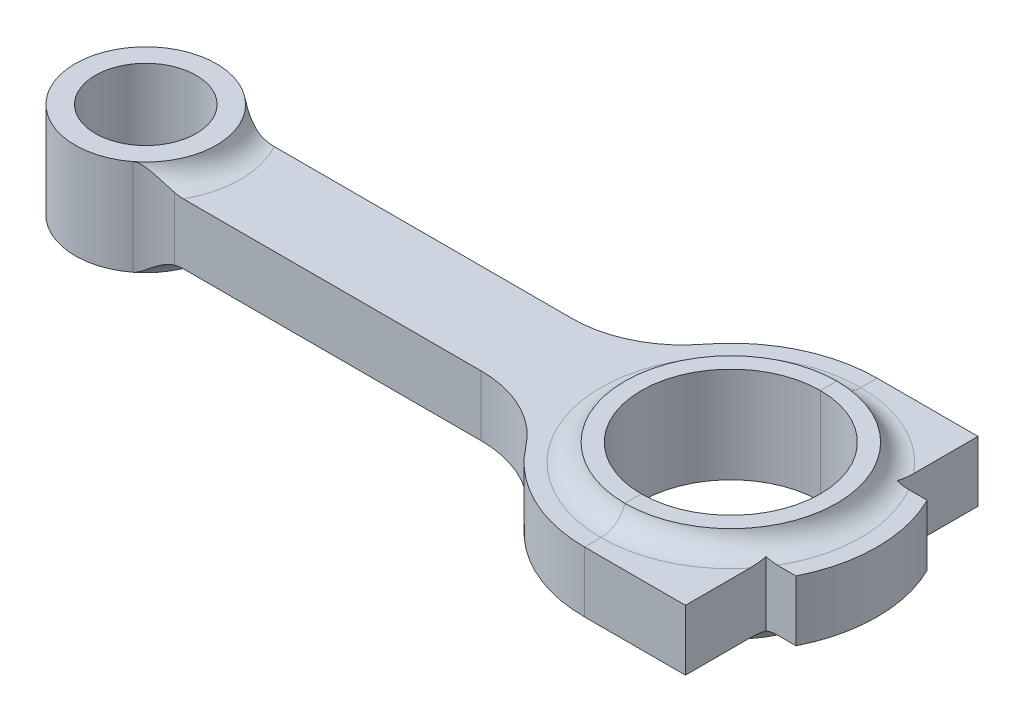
ISO-10303-21;
HEADER;
FILE_DESCRIPTION(('STEP AP214'),'2;1');
FILE_NAME('part.step','',(''),(''),'','','');
FILE_SCHEMA(('AUTOMOTIVE_DESIGN { 1 0 10303 214 1 1 1 1 }'));
ENDSEC;
DATA;
#1=APPLICATION_CONTEXT('core data for automotive mechanical design processes');
#2=APPLICATION_PROTOCOL_DEFINITION('international standard','automotive_design',2000,#1);
#3=PRODUCT_CONTEXT('',#1,'mechanical');
#4=PRODUCT('Part','Part','',(#3));
#5=PRODUCT_RELATED_PRODUCT_CATEGORY('part','',(#4));
#6=PRODUCT_DEFINITION_FORMATION('','',#4);
#7=PRODUCT_DEFINITION_CONTEXT('part definition',#1,'design');
#8=PRODUCT_DEFINITION('design','',#6,#7);
#9=PRODUCT_DEFINITION_SHAPE('','',#8);
#10=(LENGTH_UNIT() NAMED_UNIT(*) SI_UNIT(.MILLI.,.METRE.));
#11=(NAMED_UNIT(*) PLANE_ANGLE_UNIT() SI_UNIT($,.RADIAN.));
#12=(NAMED_UNIT(*) SI_UNIT($,.STERADIAN.) SOLID_ANGLE_UNIT());
#13=UNCERTAINTY_MEASURE_WITH_UNIT(LENGTH_MEASURE(1.E-05),#10,'distance_accuracy_value','');
#14=(GEOMETRIC_REPRESENTATION_CONTEXT(3) GLOBAL_UNCERTAINTY_ASSIGNED_CONTEXT((#13)) GLOBAL_UNIT_ASSIGNED_CONTEXT((#10,
#11,#12)) REPRESENTATION_CONTEXT('',''));
#15=CARTESIAN_POINT('',(0.,0.,0.));
#16=DIRECTION('',(0.,0.,1.));
#17=DIRECTION('',(1.,0.,0.));
#18=AXIS2_PLACEMENT_3D('',#15,#16,#17);
#19=CARTESIAN_POINT('',(0.,-10.0254037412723,-51.7070723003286));
#20=DIRECTION('',(-1.,0.,0.));
#21=DIRECTION('',(0.,0.,1.));
#22=AXIS2_PLACEMENT_3D('',#19,#20,#21);
#23=PLANE('',#22);
#24=CARTESIAN_POINT('',(0.,-11.,-25.7696960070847));
#25=DIRECTION('',(-1.,0.,0.));
#26=DIRECTION('',(0.,0.,1.));
#27=AXIS2_PLACEMENT_3D('',#24,#25,#26);
#28=CIRCLE('',#27,5.);
#29=CARTESIAN_POINT('',(0.,-6.,-25.7696960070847));
#30=VERTEX_POINT('',#29);
#31=CARTESIAN_POINT('',(0.,-9.5,-21.));
#32=VERTEX_POINT('',#31);
#33=EDGE_CURVE('E192',#30,#32,#28,.F.);
#34=ORIENTED_EDGE('',*,*,#33,.T.);
#35=DIRECTION('',(0.,0.,1.));
#36=VECTOR('',#35,1.);
#37=CARTESIAN_POINT('',(0.,-9.5,0.));
#38=LINE('',#37,#36);
#39=CARTESIAN_POINT('',(0.,-9.5,-17.75));
#40=VERTEX_POINT('',#39);
#41=EDGE_CURVE('E188',#32,#40,#38,.T.);
#42=ORIENTED_EDGE('',*,*,#41,.T.);
#43=DIRECTION('',(0.,-1.,0.));
#44=VECTOR('',#43,1.);
#45=CARTESIAN_POINT('',(0.,6.,-17.75));
#46=LINE('',#45,#44);
#47=CARTESIAN_POINT('',(0.,9.5,-17.75));
#48=VERTEX_POINT('',#47);
#49=EDGE_CURVE('E333',#48,#40,#46,.T.);
#50=ORIENTED_EDGE('',*,*,#49,.F.);
#51=DIRECTION('',(0.,0.,1.));
#52=VECTOR('',#51,1.);
#53=CARTESIAN_POINT('',(0.,9.5,0.));
#54=LINE('',#53,#52);
#55=CARTESIAN_POINT('',(0.,9.5,-21.));
#56=VERTEX_POINT('',#55);
#57=EDGE_CURVE('E328',#56,#48,#54,.T.);
#58=ORIENTED_EDGE('',*,*,#57,.F.);
#59=CARTESIAN_POINT('',(0.,11.,-25.7696960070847));
#60=DIRECTION('',(-1.,0.,0.));
#61=DIRECTION('',(0.,0.,1.));
#62=AXIS2_PLACEMENT_3D('',#59,#60,#61);
#63=CIRCLE('',#62,5.);
#64=CARTESIAN_POINT('',(0.,6.,-25.7696960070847));
#65=VERTEX_POINT('',#64);
#66=EDGE_CURVE('E341',#56,#65,#63,.F.);
#67=ORIENTED_EDGE('',*,*,#66,.T.);
#68=DIRECTION('',(0.,0.,1.));
#69=VECTOR('',#68,1.);
#70=CARTESIAN_POINT('',(0.,6.,0.));
#71=LINE('',#70,#69);
#72=CARTESIAN_POINT('',(0.,6.,-29.));
#73=VERTEX_POINT('',#72);
#74=EDGE_CURVE('E336',#73,#65,#71,.T.);
#75=ORIENTED_EDGE('',*,*,#74,.F.);
#76=DIRECTION('',(0.,-1.,0.));
#77=VECTOR('',#76,1.);
#78=CARTESIAN_POINT('',(0.,6.,-29.));
#79=LINE('',#78,#77);
#80=CARTESIAN_POINT('',(0.,-6.,-29.));
#81=VERTEX_POINT('',#80);
#82=EDGE_CURVE('E318',#81,#73,#79,.F.);
#83=ORIENTED_EDGE('',*,*,#82,.F.);
#84=DIRECTION('',(0.,0.,1.));
#85=VECTOR('',#84,1.);
#86=CARTESIAN_POINT('',(0.,-6.,0.));
#87=LINE('',#86,#85);
#88=EDGE_CURVE('E182',#81,#30,#87,.T.);
#89=ORIENTED_EDGE('',*,*,#88,.T.);
#90=EDGE_LOOP('',(#34,#42,#50,#58,#67,#75,#83,#89));
#91=FACE_BOUND('',#90,.T.);
#92=ADVANCED_FACE('F43',(#91),#23,.T.);
#93=DIRECTION('',(0.,-1.,0.));
#94=VECTOR('',#93,1.);
#95=CARTESIAN_POINT('',(0.,6.,17.75));
#96=LINE('',#95,#94);
#97=CARTESIAN_POINT('',(0.,-9.5,17.75));
#98=VERTEX_POINT('',#97);
#99=CARTESIAN_POINT('',(0.,9.5,17.75));
#100=VERTEX_POINT('',#99);
#101=EDGE_CURVE('E330',#98,#100,#96,.F.);
#102=ORIENTED_EDGE('',*,*,#101,.F.);
#103=CARTESIAN_POINT('',(0.,-9.5,21.));
#104=VERTEX_POINT('',#103);
#105=EDGE_CURVE('E187',#98,#104,#38,.T.);
#106=ORIENTED_EDGE('',*,*,#105,.T.);
#107=CARTESIAN_POINT('',(0.,-11.,25.7696960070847));
#108=DIRECTION('',(-1.,0.,0.));
#109=DIRECTION('',(0.,0.,1.));
#110=AXIS2_PLACEMENT_3D('',#107,#108,#109);
#111=CIRCLE('',#110,5.);
#112=CARTESIAN_POINT('',(0.,-6.,25.7696960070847));
#113=VERTEX_POINT('',#112);
#114=EDGE_CURVE('E181',#104,#113,#111,.F.);
#115=ORIENTED_EDGE('',*,*,#114,.T.);
#116=CARTESIAN_POINT('',(0.,-6.,29.));
#117=VERTEX_POINT('',#116);
#118=EDGE_CURVE('E170',#113,#117,#87,.T.);
#119=ORIENTED_EDGE('',*,*,#118,.T.);
#120=DIRECTION('',(0.,-1.,0.));
#121=VECTOR('',#120,1.);
#122=CARTESIAN_POINT('',(0.,6.,29.));
#123=LINE('',#122,#121);
#124=CARTESIAN_POINT('',(0.,6.,29.));
#125=VERTEX_POINT('',#124);
#126=EDGE_CURVE('E47',#117,#125,#123,.F.);
#127=ORIENTED_EDGE('',*,*,#126,.T.);
#128=CARTESIAN_POINT('',(0.,6.,25.7696960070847));
#129=VERTEX_POINT('',#128);
#130=EDGE_CURVE('E335',#129,#125,#71,.T.);
#131=ORIENTED_EDGE('',*,*,#130,.F.);
#132=CARTESIAN_POINT('',(0.,11.,25.7696960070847));
#133=DIRECTION('',(-1.,0.,0.));
#134=DIRECTION('',(0.,0.,1.));
#135=AXIS2_PLACEMENT_3D('',#132,#133,#134);
#136=CIRCLE('',#135,5.);
#137=CARTESIAN_POINT('',(0.,9.5,21.));
#138=VERTEX_POINT('',#137);
#139=EDGE_CURVE('E183',#129,#138,#136,.F.);
#140=ORIENTED_EDGE('',*,*,#139,.T.);
#141=EDGE_CURVE('E256',#100,#138,#54,.T.);
#142=ORIENTED_EDGE('',*,*,#141,.F.);
#143=EDGE_LOOP('',(#102,#106,#115,#119,#127,#131,#140,#142));
#144=FACE_BOUND('',#143,.T.);
#145=ADVANCED_FACE('F177',(#144),#23,.T.);
#146=CARTESIAN_POINT('',(0.,6.,0.));
#147=DIRECTION('',(0.,1.,0.));
#148=DIRECTION('',(0.,0.,1.));
#149=AXIS2_PLACEMENT_3D('',#146,#147,#148);
#150=PLANE('',#149);
#151=DIRECTION('',(1.,0.,0.));
#152=VECTOR('',#151,1.);
#153=CARTESIAN_POINT('',(-500000.,6.,-28.9999999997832));
#154=LINE('',#153,#152);
#155=CARTESIAN_POINT('',(20.,6.,-29.));
#156=VERTEX_POINT('',#155);
#157=EDGE_CURVE('E315',#73,#156,#154,.T.);
#158=ORIENTED_EDGE('',*,*,#157,.F.);
#159=ORIENTED_EDGE('',*,*,#74,.T.);
#160=CARTESIAN_POINT('',(0.,6.,0.));
#161=DIRECTION('',(0.,1.,0.));
#162=DIRECTION('',(0.,0.,1.));
#163=AXIS2_PLACEMENT_3D('',#160,#161,#162);
#164=CIRCLE('',#163,25.7696960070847);
#165=CARTESIAN_POINT('',(20.,6.,-16.250453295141));
#166=VERTEX_POINT('',#165);
#167=EDGE_CURVE('E202',#65,#166,#164,.F.);
#168=ORIENTED_EDGE('',*,*,#167,.T.);
#169=DIRECTION('',(0.,0.,-1.));
#170=VECTOR('',#169,1.);
#171=CARTESIAN_POINT('',(20.,6.,0.));
#172=LINE('',#171,#170);
#173=EDGE_CURVE('E304',#166,#156,#172,.T.);
#174=ORIENTED_EDGE('',*,*,#173,.T.);
#175=EDGE_LOOP('',(#158,#159,#168,#174));
#176=FACE_BOUND('',#175,.T.);
#177=ADVANCED_FACE('F387',(#176),#150,.T.);
#178=CARTESIAN_POINT('',(20.,6.,16.250453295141));
#179=VERTEX_POINT('',#178);
#180=EDGE_CURVE('E200',#179,#129,#164,.F.);
#181=ORIENTED_EDGE('',*,*,#180,.T.);
#182=ORIENTED_EDGE('',*,*,#130,.T.);
#183=DIRECTION('',(1.,0.,0.));
#184=VECTOR('',#183,1.);
#185=CARTESIAN_POINT('',(-500000.,6.,29.0000000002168));
#186=LINE('',#185,#184);
#187=CARTESIAN_POINT('',(20.,6.,29.));
#188=VERTEX_POINT('',#187);
#189=EDGE_CURVE('E52',#125,#188,#186,.T.);
#190=ORIENTED_EDGE('',*,*,#189,.T.);
#191=DIRECTION('',(0.,0.,-1.));
#192=VECTOR('',#191,1.);
#193=CARTESIAN_POINT('',(20.,6.,0.));
#194=LINE('',#193,#192);
#195=EDGE_CURVE('E67',#188,#179,#194,.T.);
#196=ORIENTED_EDGE('',*,*,#195,.T.);
#197=EDGE_LOOP('',(#181,#182,#190,#196));
#198=FACE_BOUND('',#197,.T.);
#199=ADVANCED_FACE('F397',(#198),#150,.T.);
#200=CARTESIAN_POINT('',(0.,-6.,0.));
#201=DIRECTION('',(0.,1.,0.));
#202=DIRECTION('',(0.,0.,1.));
#203=AXIS2_PLACEMENT_3D('',#200,#201,#202);
#204=PLANE('',#203);
#205=ORIENTED_EDGE('',*,*,#88,.F.);
#206=DIRECTION('',(1.,0.,0.));
#207=VECTOR('',#206,1.);
#208=CARTESIAN_POINT('',(-500000.,-6.,-28.9999999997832));
#209=LINE('',#208,#207);
#210=CARTESIAN_POINT('',(20.,-6.,-29.));
#211=VERTEX_POINT('',#210);
#212=EDGE_CURVE('E319',#81,#211,#209,.T.);
#213=ORIENTED_EDGE('',*,*,#212,.T.);
#214=DIRECTION('',(0.,0.,-1.));
#215=VECTOR('',#214,1.);
#216=CARTESIAN_POINT('',(20.,-6.,0.));
#217=LINE('',#216,#215);
#218=CARTESIAN_POINT('',(20.,-6.,-16.250453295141));
#219=VERTEX_POINT('',#218);
#220=EDGE_CURVE('E306',#219,#211,#217,.T.);
#221=ORIENTED_EDGE('',*,*,#220,.F.);
#222=CARTESIAN_POINT('',(0.,-6.,0.));
#223=DIRECTION('',(0.,1.,0.));
#224=DIRECTION('',(0.,0.,1.));
#225=AXIS2_PLACEMENT_3D('',#222,#223,#224);
#226=CIRCLE('',#225,25.7696960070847);
#227=EDGE_CURVE('E196',#219,#30,#226,.T.);
#228=ORIENTED_EDGE('',*,*,#227,.T.);
#229=EDGE_LOOP('',(#205,#213,#221,#228));
#230=FACE_BOUND('',#229,.T.);
#231=ADVANCED_FACE('F399',(#230),#204,.F.);
#232=ORIENTED_EDGE('',*,*,#118,.F.);
#233=CARTESIAN_POINT('',(20.,-6.,16.250453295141));
#234=VERTEX_POINT('',#233);
#235=EDGE_CURVE('E198',#113,#234,#226,.T.);
#236=ORIENTED_EDGE('',*,*,#235,.T.);
#237=DIRECTION('',(0.,0.,-1.));
#238=VECTOR('',#237,1.);
#239=CARTESIAN_POINT('',(20.,-6.,0.));
#240=LINE('',#239,#238);
#241=CARTESIAN_POINT('',(20.,-6.,29.));
#242=VERTEX_POINT('',#241);
#243=EDGE_CURVE('E60',#242,#234,#240,.T.);
#244=ORIENTED_EDGE('',*,*,#243,.F.);
#245=DIRECTION('',(1.,0.,0.));
#246=VECTOR('',#245,1.);
#247=CARTESIAN_POINT('',(-500000.,-6.,29.0000000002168));
#248=LINE('',#247,#246);
#249=EDGE_CURVE('E12',#117,#242,#248,.T.);
#250=ORIENTED_EDGE('',*,*,#249,.F.);
#251=EDGE_LOOP('',(#232,#236,#244,#250));
#252=FACE_BOUND('',#251,.T.);
#253=ADVANCED_FACE('F169',(#252),#204,.F.);
#254=CARTESIAN_POINT('',(0.,11.,0.));
#255=DIRECTION('',(0.,1.,0.));
#256=DIRECTION('',(0.,0.,1.));
#257=AXIS2_PLACEMENT_3D('',#254,#255,#256);
#258=TOROIDAL_SURFACE('',#257,25.7696960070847,5.);
#259=ORIENTED_EDGE('',*,*,#139,.F.);
#260=ORIENTED_EDGE('',*,*,#180,.F.);
#261=CARTESIAN_POINT('',(20.,6.142806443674,14.2946086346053));
#262=CARTESIAN_POINT('',(20.,6.08922512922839,14.6718593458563));
#263=CARTESIAN_POINT('',(20.,6.04967167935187,15.0511233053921));
#264=CARTESIAN_POINT('',(20.,6.0021646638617,15.8118718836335));
#265=CARTESIAN_POINT('',(20.,5.99422221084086,16.1933572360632));
#266=CARTESIAN_POINT('',(20.,6.0141939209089,16.954171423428));
#267=CARTESIAN_POINT('',(20.,6.04198071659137,17.3335031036));
#268=CARTESIAN_POINT('',(20.,6.13806110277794,18.0867723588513));
#269=CARTESIAN_POINT('',(20.,6.20630752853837,18.4607156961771));
#270=CARTESIAN_POINT('',(20.,6.38711565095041,19.1907206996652));
#271=CARTESIAN_POINT('',(20.,6.49883974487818,19.546984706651));
#272=CARTESIAN_POINT('',(20.,6.77202746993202,20.2400383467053));
#273=CARTESIAN_POINT('',(20.,6.93344710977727,20.5768448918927));
#274=CARTESIAN_POINT('',(20.,7.27911914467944,21.1645904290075));
#275=CARTESIAN_POINT('',(20.,7.45490175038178,21.4204212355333));
#276=CARTESIAN_POINT('',(20.,7.74773177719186,21.780129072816));
#277=CARTESIAN_POINT('',(20.,7.85018841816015,21.8960139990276));
#278=CARTESIAN_POINT('',(20.,8.06484130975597,22.1184165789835));
#279=CARTESIAN_POINT('',(20.,8.17703504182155,22.2249366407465));
#280=CARTESIAN_POINT('',(20.,8.38694960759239,22.4063259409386));
#281=CARTESIAN_POINT('',(20.,8.4829334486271,22.4832112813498));
#282=CARTESIAN_POINT('',(20.,8.6806324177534,22.6292092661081));
#283=CARTESIAN_POINT('',(20.,8.78234628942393,22.6983236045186));
#284=CARTESIAN_POINT('',(20.,8.99113707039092,22.827937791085));
#285=CARTESIAN_POINT('',(20.,9.0982140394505,22.8884375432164));
#286=CARTESIAN_POINT('',(20.,9.31715152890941,22.9999584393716));
#287=CARTESIAN_POINT('',(20.,9.42900997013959,23.0509836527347));
#288=CARTESIAN_POINT('',(20.,9.65768996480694,23.1431347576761));
#289=CARTESIAN_POINT('',(20.,9.77454161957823,23.1841862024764));
#290=CARTESIAN_POINT('',(20.,10.011519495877,23.2551903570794));
#291=CARTESIAN_POINT('',(20.,10.1316441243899,23.285148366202));
#292=CARTESIAN_POINT('',(20.,10.3741889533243,23.3334416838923));
#293=CARTESIAN_POINT('',(20.,10.4966086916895,23.3517793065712));
#294=CARTESIAN_POINT('',(20.,10.7426453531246,23.3764877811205));
#295=CARTESIAN_POINT('',(20.,10.866262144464,23.3828599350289));
#296=CARTESIAN_POINT('',(20.,11.0996704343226,23.3834826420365));
#297=CARTESIAN_POINT('',(20.,11.2094604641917,23.3790103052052));
#298=CARTESIAN_POINT('',(20.,11.4282800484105,23.3606061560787));
#299=CARTESIAN_POINT('',(20.,11.5373093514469,23.3466713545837));
#300=CARTESIAN_POINT('',(20.,11.7537272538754,23.3095547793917));
#301=CARTESIAN_POINT('',(20.,11.8611166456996,23.2863776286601));
#302=CARTESIAN_POINT('',(20.,12.0735946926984,23.2311236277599));
#303=CARTESIAN_POINT('',(20.,12.1786824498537,23.1990433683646));
#304=CARTESIAN_POINT('',(20.,12.4871688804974,23.0908761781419));
#305=CARTESIAN_POINT('',(20.,12.6863534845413,23.0024083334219));
#306=CARTESIAN_POINT('',(20.,13.0689705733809,22.7966112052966));
#307=CARTESIAN_POINT('',(20.,13.2523988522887,22.6792742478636));
#308=CARTESIAN_POINT('',(20.,13.6209677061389,22.4057710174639));
#309=CARTESIAN_POINT('',(20.,13.8039589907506,22.2467151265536));
#310=CARTESIAN_POINT('',(20.,14.1461302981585,21.9049465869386));
#311=CARTESIAN_POINT('',(20.,14.3052955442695,21.7222193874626));
#312=CARTESIAN_POINT('',(20.,14.6804822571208,21.2333152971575));
#313=CARTESIAN_POINT('',(20.,14.8799436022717,20.914309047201));
#314=CARTESIAN_POINT('',(20.,15.1386419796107,20.4153365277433));
#315=CARTESIAN_POINT('',(20.,15.2182222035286,20.2453082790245));
#316=CARTESIAN_POINT('',(20.,15.364555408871,19.8998054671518));
#317=CARTESIAN_POINT('',(20.,15.4313083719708,19.7243308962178));
#318=CARTESIAN_POINT('',(20.,15.6656795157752,19.0384339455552));
#319=CARTESIAN_POINT('',(20.,15.7897278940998,18.5125990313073));
#320=CARTESIAN_POINT('',(20.,15.9127951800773,17.7157519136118));
#321=CARTESIAN_POINT('',(20.,15.9433161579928,17.4486397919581));
#322=CARTESIAN_POINT('',(20.,15.9852594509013,16.9128392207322));
#323=CARTESIAN_POINT('',(20.,15.9966826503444,16.6441508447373));
#324=CARTESIAN_POINT('',(20.,16.0034799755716,15.9659620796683));
#325=CARTESIAN_POINT('',(20.,15.9873280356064,15.5563502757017));
#326=CARTESIAN_POINT('',(20.,15.9196172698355,14.7399668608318));
#327=CARTESIAN_POINT('',(20.,15.8680354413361,14.3331972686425));
#328=CARTESIAN_POINT('',(20.,15.7331749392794,13.5223796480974));
#329=CARTESIAN_POINT('',(20.,15.649697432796,13.1183652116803));
#330=CARTESIAN_POINT('',(20.,15.4544158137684,12.3174898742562));
#331=CARTESIAN_POINT('',(20.,15.3426263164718,11.9206253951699));
#332=CARTESIAN_POINT('',(20.,15.1517289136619,11.3202043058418));
#333=CARTESIAN_POINT('',(20.,15.0820137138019,11.113606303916));
#334=CARTESIAN_POINT('',(20.,14.9354395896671,10.70296350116));
#335=CARTESIAN_POINT('',(20.,14.8585810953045,10.4989185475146));
#336=CARTESIAN_POINT('',(20.,14.6976572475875,10.0933168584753));
#337=CARTESIAN_POINT('',(20.,14.6135806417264,9.89176458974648));
#338=CARTESIAN_POINT('',(20.,14.4382254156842,9.49183167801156));
#339=CARTESIAN_POINT('',(20.,14.3469473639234,9.29345078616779));
#340=CARTESIAN_POINT('',(20.,14.1577132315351,8.90211300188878));
#341=CARTESIAN_POINT('',(20.,14.0598254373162,8.70912318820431));
#342=CARTESIAN_POINT('',(20.,13.856002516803,8.3274590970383));
#343=CARTESIAN_POINT('',(20.,13.7500683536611,8.13878430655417));
#344=CARTESIAN_POINT('',(20.,13.5292514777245,7.76729490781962));
#345=CARTESIAN_POINT('',(20.,13.414390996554,7.58446724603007));
#346=CARTESIAN_POINT('',(20.,13.2337744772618,7.31591308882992));
#347=CARTESIAN_POINT('',(20.,13.1722003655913,7.22736773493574));
#348=CARTESIAN_POINT('',(20.,13.0458811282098,7.05257391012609));
#349=CARTESIAN_POINT('',(20.,12.9811364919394,6.96632508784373));
#350=CARTESIAN_POINT('',(20.,12.8710291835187,6.826050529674));
#351=CARTESIAN_POINT('',(20.,12.8267137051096,6.77120354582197));
#352=CARTESIAN_POINT('',(20.,12.7363410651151,6.66296283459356));
#353=CARTESIAN_POINT('',(20.,12.6902838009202,6.60956919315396));
#354=CARTESIAN_POINT('',(20.,12.5490198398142,6.45176199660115));
#355=CARTESIAN_POINT('',(20.,12.4508707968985,6.34991655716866));
#356=CARTESIAN_POINT('',(20.,12.2437478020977,6.15559658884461));
#357=CARTESIAN_POINT('',(20.,12.1346777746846,6.06322293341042));
#358=CARTESIAN_POINT('',(20.,11.9039806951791,5.89556904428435));
#359=CARTESIAN_POINT('',(20.,11.7823978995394,5.82023138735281));
#360=CARTESIAN_POINT('',(20.,11.5788060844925,5.72319705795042));
#361=CARTESIAN_POINT('',(20.,11.5012947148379,5.69221168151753));
#362=CARTESIAN_POINT('',(20.,11.3423711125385,5.64287973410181));
#363=CARTESIAN_POINT('',(20.,11.2609664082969,5.62450974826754));
#364=CARTESIAN_POINT('',(20.,11.0954604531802,5.60264544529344));
#365=CARTESIAN_POINT('',(20.,11.0113431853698,5.59926760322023));
#366=CARTESIAN_POINT('',(20.,10.843930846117,5.60823440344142));
#367=CARTESIAN_POINT('',(20.,10.7606364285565,5.62059067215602));
#368=CARTESIAN_POINT('',(20.,10.583946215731,5.66245478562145));
#369=CARTESIAN_POINT('',(20.,10.4911590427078,5.69446198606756));
#370=CARTESIAN_POINT('',(20.,10.3118791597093,5.77284585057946));
#371=CARTESIAN_POINT('',(20.,10.2254014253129,5.81925541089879));
#372=CARTESIAN_POINT('',(20.,10.0683533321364,5.91636559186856));
#373=CARTESIAN_POINT('',(20.,9.9970922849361,5.96597826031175));
#374=CARTESIAN_POINT('',(20.,9.85903990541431,6.07112797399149));
#375=CARTESIAN_POINT('',(20.,9.79225254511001,6.12667017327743));
#376=CARTESIAN_POINT('',(20.,9.66243914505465,6.24231695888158));
#377=CARTESIAN_POINT('',(20.,9.59942483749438,6.30243457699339));
#378=CARTESIAN_POINT('',(20.,9.47685109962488,6.42602462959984));
#379=CARTESIAN_POINT('',(20.,9.4172904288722,6.48949584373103));
#380=CARTESIAN_POINT('',(20.,9.26630441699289,6.65791235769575));
#381=CARTESIAN_POINT('',(20.,9.17717723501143,6.76491425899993));
#382=CARTESIAN_POINT('',(20.,9.00499799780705,6.98372959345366));
#383=CARTESIAN_POINT('',(20.,8.9219492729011,7.09554561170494));
#384=CARTESIAN_POINT('',(20.,8.76081394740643,7.32297266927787));
#385=CARTESIAN_POINT('',(20.,8.68273616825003,7.43858993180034));
#386=CARTESIAN_POINT('',(20.,8.53097890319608,7.67268474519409));
#387=CARTESIAN_POINT('',(20.,8.45730013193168,7.79116275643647));
#388=CARTESIAN_POINT('',(20.,8.24151802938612,8.1509980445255));
#389=CARTESIAN_POINT('',(20.,8.1052752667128,8.39587954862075));
#390=CARTESIAN_POINT('',(20.,7.84607349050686,8.89219707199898));
#391=CARTESIAN_POINT('',(20.,7.72310176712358,9.14362652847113));
#392=CARTESIAN_POINT('',(20.,7.51680641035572,9.59200659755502));
#393=CARTESIAN_POINT('',(20.,7.43097547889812,9.78780844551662));
#394=CARTESIAN_POINT('',(20.,7.26615991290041,10.1822595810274));
#395=CARTESIAN_POINT('',(20.,7.18717521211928,10.3809088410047));
#396=CARTESIAN_POINT('',(20.,6.96033116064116,10.9809510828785));
#397=CARTESIAN_POINT('',(20.,6.82266531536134,11.386256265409));
#398=CARTESIAN_POINT('',(20.,6.57608847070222,12.204825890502));
#399=CARTESIAN_POINT('',(20.,6.46713310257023,12.6180769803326));
#400=CARTESIAN_POINT('',(20.,6.28051985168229,13.4515799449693));
#401=CARTESIAN_POINT('',(20.,6.20285413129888,13.8718300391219));
#402=CARTESIAN_POINT('',(20.,6.142806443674,14.2946086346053));
#403=B_SPLINE_CURVE_WITH_KNOTS('',3,(#261,#262,#263,#264,#265,#266,#267,#268,#269,#270,#271,
#272,#273,#274,#275,#276,#277,#278,#279,#280,#281,#282,#283,#284,#285,#286,#287,#288,#289,#290,
#291,#292,#293,#294,#295,#296,#297,#298,#299,#300,#301,#302,#303,#304,#305,#306,#307,#308,#309,
#310,#311,#312,#313,#314,#315,#316,#317,#318,#319,#320,#321,#322,#323,#324,#325,#326,#327,#328,
#329,#330,#331,#332,#333,#334,#335,#336,#337,#338,#339,#340,#341,#342,#343,#344,#345,#346,#347,
#348,#349,#350,#351,#352,#353,#354,#355,#356,#357,#358,#359,#360,#361,#362,#363,#364,#365,#366,
#367,#368,#369,#370,#371,#372,#373,#374,#375,#376,#377,#378,#379,#380,#381,#382,#383,#384,#385,
#386,#387,#388,#389,#390,#391,#392,#393,#394,#395,#396,#397,#398,#399,#400,#401,#402),
.UNSPECIFIED.,.T.,.F.,(4,2,2,2,2,2,2,2,2,2,2,2,2,2,2,2,2,2,2,2,2,2,2,2,2,2,2,2,2,2,2,2,2,2,2,2,
2,2,2,2,2,2,2,2,2,2,2,2,2,2,2,2,2,2,2,2,2,2,2,2,2,2,2,2,2,2,2,2,2,2,4),(0.,1.14281513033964,
2.28603197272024,3.42518475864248,4.56301221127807,5.67992559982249,6.79585310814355,
7.7231780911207,8.18673981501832,8.65018199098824,9.01878049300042,9.38729848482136,
9.75582058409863,10.1241840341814,10.4952179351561,10.8660743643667,11.2368569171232,
11.6075991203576,11.9368381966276,12.2661813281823,12.5953599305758,12.924664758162,
13.5755604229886,14.2266292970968,14.951278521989,15.6763753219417,16.7983275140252,
17.3611390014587,17.9239512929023,19.5345119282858,20.3406684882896,21.146787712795,
22.3747325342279,23.6034753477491,24.8400063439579,26.0759003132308,26.729922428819,
27.3839052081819,28.0389266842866,28.6938965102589,29.3429094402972,29.9918448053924,
30.6392127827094,30.962709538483,31.2861565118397,31.4976605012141,31.7091769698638,
32.1329447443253,32.5608377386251,32.9872661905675,33.2368578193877,33.485984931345,
33.7370441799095,33.9882890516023,34.2810997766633,34.5745842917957,34.8346978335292,
35.0950393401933,35.3561523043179,35.6171708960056,36.0346365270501,36.4523291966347,
36.8707435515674,37.289225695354,38.1293820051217,38.968726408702,39.6099573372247,
40.2511820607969,41.534231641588,42.8152866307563,44.0960205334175),.UNSPECIFIED.);
#404=CARTESIAN_POINT('',(19.9999999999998,6.38166270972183,13.));
#405=VERTEX_POINT('',#404);
#406=EDGE_CURVE('E219',#405,#179,#403,.T.);
#407=ORIENTED_EDGE('',*,*,#406,.F.);
#408=CARTESIAN_POINT('',(20.5441454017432,6.21727726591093,13.));
#409=CARTESIAN_POINT('',(20.1308784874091,6.32372928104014,13.));
#410=CARTESIAN_POINT('',(19.7272276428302,6.46854513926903,13.));
#411=CARTESIAN_POINT('',(18.9544648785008,6.83214728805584,13.));
#412=CARTESIAN_POINT('',(18.5853397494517,7.05090513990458,13.));
#413=CARTESIAN_POINT('',(18.000105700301,7.48546844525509,13.));
#414=CARTESIAN_POINT('',(17.7707595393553,7.6835429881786,13.));
#415=CARTESIAN_POINT('',(17.3472385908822,8.11409917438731,13.));
#416=CARTESIAN_POINT('',(17.1530007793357,8.34651777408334,13.));
#417=CARTESIAN_POINT('',(16.8410817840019,8.79795421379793,13.));
#418=CARTESIAN_POINT('',(16.7159036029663,9.01174083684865,13.));
#419=CARTESIAN_POINT('',(16.555868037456,9.34557022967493,13.));
#420=CARTESIAN_POINT('',(16.507134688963,9.45907310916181,13.));
#421=CARTESIAN_POINT('',(16.4196747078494,9.6898506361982,13.));
#422=CARTESIAN_POINT('',(16.380943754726,9.80712363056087,13.));
#423=CARTESIAN_POINT('',(16.3139607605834,10.045474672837,13.));
#424=CARTESIAN_POINT('',(16.2857801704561,10.1665728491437,13.));
#425=CARTESIAN_POINT('',(16.240831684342,10.4108795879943,13.));
#426=CARTESIAN_POINT('',(16.2240637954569,10.5340881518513,13.));
#427=CARTESIAN_POINT('',(16.2023101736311,10.7814965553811,13.));
#428=CARTESIAN_POINT('',(16.197319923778,10.9056959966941,13.));
#429=CARTESIAN_POINT('',(16.1992214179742,11.1539975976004,13.));
#430=CARTESIAN_POINT('',(16.2061121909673,11.2780997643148,13.));
#431=CARTESIAN_POINT('',(16.2302708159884,11.5120595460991,13.));
#432=CARTESIAN_POINT('',(16.246368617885,11.6220401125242,13.));
#433=CARTESIAN_POINT('',(16.2876710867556,11.8403119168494,13.));
#434=CARTESIAN_POINT('',(16.3128787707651,11.9486025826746,13.));
#435=CARTESIAN_POINT('',(16.3719878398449,12.1627514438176,13.));
#436=CARTESIAN_POINT('',(16.4058869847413,12.268610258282,13.));
#437=CARTESIAN_POINT('',(16.4818749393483,12.4773617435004,13.));
#438=CARTESIAN_POINT('',(16.5239669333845,12.5802532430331,13.));
#439=CARTESIAN_POINT('',(16.6651953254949,12.8913832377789,13.));
#440=CARTESIAN_POINT('',(16.7770191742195,13.093990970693,13.));
#441=CARTESIAN_POINT('',(17.0282332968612,13.4810832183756,13.));
#442=CARTESIAN_POINT('',(17.1676353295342,13.6655599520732,13.));
#443=CARTESIAN_POINT('',(17.4950639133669,14.0449369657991,13.));
#444=CARTESIAN_POINT('',(17.6873297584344,14.2361767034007,13.));
#445=CARTESIAN_POINT('',(18.0962944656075,14.5903657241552,13.));
#446=CARTESIAN_POINT('',(18.3130098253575,14.7532957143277,13.));
#447=CARTESIAN_POINT('',(18.8121596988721,15.0807967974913,13.));
#448=CARTESIAN_POINT('',(19.098929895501,15.2387754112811,13.));
#449=CARTESIAN_POINT('',(19.6923714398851,15.5115009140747,13.));
#450=CARTESIAN_POINT('',(19.9990558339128,15.6262191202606,13.));
#451=CARTESIAN_POINT('',(20.6714929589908,15.8246814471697,13.));
#452=CARTESIAN_POINT('',(21.0393227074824,15.9014376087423,13.));
#453=CARTESIAN_POINT('',(21.7829338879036,15.9940436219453,13.));
#454=CARTESIAN_POINT('',(22.1587182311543,16.0098707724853,13.));
#455=CARTESIAN_POINT('',(22.7252592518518,15.9858787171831,13.));
#456=CARTESIAN_POINT('',(22.9172328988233,15.969353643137,13.));
#457=CARTESIAN_POINT('',(23.2989200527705,15.9192790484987,13.));
#458=CARTESIAN_POINT('',(23.4886345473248,15.885737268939,13.));
#459=CARTESIAN_POINT('',(23.8642438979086,15.8013880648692,13.));
#460=CARTESIAN_POINT('',(24.0501376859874,15.7505758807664,13.));
#461=CARTESIAN_POINT('',(24.4161933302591,15.6315944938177,13.));
#462=CARTESIAN_POINT('',(24.5963585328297,15.5634356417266,13.));
#463=CARTESIAN_POINT('',(24.9354113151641,15.4157611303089,13.));
#464=CARTESIAN_POINT('',(25.0948636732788,15.3375419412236,13.));
#465=CARTESIAN_POINT('',(25.4056867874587,15.1665704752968,13.));
#466=CARTESIAN_POINT('',(25.5570620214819,15.0738263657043,13.));
#467=CARTESIAN_POINT('',(25.8500835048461,14.874169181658,13.));
#468=CARTESIAN_POINT('',(25.99173394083,14.7672622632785,13.));
#469=CARTESIAN_POINT('',(26.2636380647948,14.5398201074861,13.));
#470=CARTESIAN_POINT('',(26.3938935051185,14.419286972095,13.));
#471=CARTESIAN_POINT('',(26.6259293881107,14.1811584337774,13.));
#472=CARTESIAN_POINT('',(26.7292382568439,14.0650497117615,13.));
#473=CARTESIAN_POINT('',(26.9246150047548,13.8237369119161,13.));
#474=CARTESIAN_POINT('',(27.016684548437,13.698534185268,13.));
#475=CARTESIAN_POINT('',(27.1884302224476,13.4400019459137,13.));
#476=CARTESIAN_POINT('',(27.2681139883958,13.3066775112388,13.));
#477=CARTESIAN_POINT('',(27.4141288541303,13.0329055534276,13.));
#478=CARTESIAN_POINT('',(27.4804613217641,12.8924587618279,13.));
#479=CARTESIAN_POINT('',(27.592316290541,12.6215750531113,13.));
#480=CARTESIAN_POINT('',(27.63932980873,12.4917519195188,13.));
#481=CARTESIAN_POINT('',(27.7215647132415,12.2284271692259,13.));
#482=CARTESIAN_POINT('',(27.7567872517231,12.0949259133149,13.));
#483=CARTESIAN_POINT('',(27.8150237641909,11.8253367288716,13.));
#484=CARTESIAN_POINT('',(27.8380422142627,11.6892497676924,13.));
#485=CARTESIAN_POINT('',(27.8716168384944,11.4155465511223,13.));
#486=CARTESIAN_POINT('',(27.8821734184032,11.2779303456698,13.));
#487=CARTESIAN_POINT('',(27.8904269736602,11.0111308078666,13.));
#488=CARTESIAN_POINT('',(27.8889030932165,10.8819709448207,13.));
#489=CARTESIAN_POINT('',(27.8748423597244,10.6242079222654,13.));
#490=CARTESIAN_POINT('',(27.862301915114,10.4956049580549,13.));
#491=CARTESIAN_POINT('',(27.8263434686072,10.239995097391,13.));
#492=CARTESIAN_POINT('',(27.8029307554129,10.1129874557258,13.));
#493=CARTESIAN_POINT('',(27.7454616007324,9.86135586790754,13.));
#494=CARTESIAN_POINT('',(27.711401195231,9.73673282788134,13.));
#495=CARTESIAN_POINT('',(27.6333068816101,9.49178267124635,13.));
#496=CARTESIAN_POINT('',(27.5893570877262,9.37142869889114,13.));
#497=CARTESIAN_POINT('',(27.4917379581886,9.1346831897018,13.));
#498=CARTESIAN_POINT('',(27.4380651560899,9.01829308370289,13.));
#499=CARTESIAN_POINT('',(27.3215262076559,8.79025670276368,13.));
#500=CARTESIAN_POINT('',(27.2586626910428,8.67860908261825,13.));
#501=CARTESIAN_POINT('',(27.124267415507,8.46061004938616,13.));
#502=CARTESIAN_POINT('',(27.0527323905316,8.35426065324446,13.));
#503=CARTESIAN_POINT('',(26.8983652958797,8.14300510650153,13.));
#504=CARTESIAN_POINT('',(26.8151802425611,8.03835658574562,13.));
#505=CARTESIAN_POINT('',(26.6407696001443,7.8359682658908,13.));
#506=CARTESIAN_POINT('',(26.5495410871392,7.73823100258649,13.));
#507=CARTESIAN_POINT('',(26.2649224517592,7.45611820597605,13.));
#508=CARTESIAN_POINT('',(26.060488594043,7.28269165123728,13.));
#509=CARTESIAN_POINT('',(25.6103985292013,6.95473292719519,13.));
#510=CARTESIAN_POINT('',(25.3627248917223,6.80299254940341,13.));
#511=CARTESIAN_POINT('',(24.8473404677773,6.53852993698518,13.));
#512=CARTESIAN_POINT('',(24.5796196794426,6.42582733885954,13.));
#513=CARTESIAN_POINT('',(24.0008638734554,6.22968582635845,13.));
#514=CARTESIAN_POINT('',(23.6882922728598,6.15078948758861,13.));
#515=CARTESIAN_POINT('',(23.0550007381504,6.04084442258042,13.));
#516=CARTESIAN_POINT('',(22.7342808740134,6.00979528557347,13.));
#517=CARTESIAN_POINT('',(22.0987311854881,5.9943288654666,13.));
#518=CARTESIAN_POINT('',(21.7839240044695,6.0089174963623,13.));
#519=CARTESIAN_POINT('',(21.1590454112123,6.08110808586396,13.));
#520=CARTESIAN_POINT('',(20.8489794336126,6.13875610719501,13.));
#521=CARTESIAN_POINT('',(20.5441454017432,6.21727726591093,13.));
#522=B_SPLINE_CURVE_WITH_KNOTS('',3,(#408,#409,#410,#411,#412,#413,#414,#415,#416,#417,#418,
#419,#420,#421,#422,#423,#424,#425,#426,#427,#428,#429,#430,#431,#432,#433,#434,#435,#436,#437,
#438,#439,#440,#441,#442,#443,#444,#445,#446,#447,#448,#449,#450,#451,#452,#453,#454,#455,#456,
#457,#458,#459,#460,#461,#462,#463,#464,#465,#466,#467,#468,#469,#470,#471,#472,#473,#474,#475,
#476,#477,#478,#479,#480,#481,#482,#483,#484,#485,#486,#487,#488,#489,#490,#491,#492,#493,#494,
#495,#496,#497,#498,#499,#500,#501,#502,#503,#504,#505,#506,#507,#508,#509,#510,#511,#512,#513,
#514,#515,#516,#517,#518,#519,#520,#521),.UNSPECIFIED.,.T.,.F.,(4,2,2,2,2,2,2,2,2,2,2,2,2,2,2,2,
2,2,2,2,2,2,2,2,2,2,2,2,2,2,2,2,2,2,2,2,2,2,2,2,2,2,2,2,2,2,2,2,2,2,2,2,2,2,2,2,4),(0.,
1.27893957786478,2.55738782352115,3.46313569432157,4.36724112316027,5.10716146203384,
5.47733648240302,5.8473513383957,6.21982858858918,6.59230607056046,6.96464067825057,
7.33694485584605,7.67001587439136,8.00319730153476,8.33629293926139,8.66951830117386,
9.36088842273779,10.0525539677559,10.863131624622,11.6742595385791,12.6526834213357,
13.6317548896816,14.7540805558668,15.8768243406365,16.4542405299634,17.0313942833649,
17.6087072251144,18.18567648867,18.717748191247,19.249521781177,19.7810649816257,
20.3125262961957,20.7781329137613,21.2436704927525,21.7089199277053,22.1741216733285,
22.5878085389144,23.0014549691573,23.4149495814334,23.8284307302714,24.2154717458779,
24.6026389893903,24.9896180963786,25.3767414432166,25.760688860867,26.1447734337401,
26.5287483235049,26.9128682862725,27.3134665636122,27.714211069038,28.5151470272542,
29.3830437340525,30.2513763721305,31.2145799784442,32.1777753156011,33.1201374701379,
34.06350916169),.UNSPECIFIED.);
#523=CARTESIAN_POINT('',(22.2503310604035,6.,13.));
#524=VERTEX_POINT('',#523);
#525=EDGE_CURVE('E370',#524,#405,#522,.T.);
#526=ORIENTED_EDGE('',*,*,#525,.F.);
#527=CARTESIAN_POINT('',(22.2503310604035,6.,-13.));
#528=VERTEX_POINT('',#527);
#529=EDGE_CURVE('E203',#528,#524,#164,.F.);
#530=ORIENTED_EDGE('',*,*,#529,.F.);
#531=CARTESIAN_POINT('',(20.5441454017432,6.21727726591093,-13.));
#532=CARTESIAN_POINT('',(20.750684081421,6.16407353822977,-13.));
#533=CARTESIAN_POINT('',(20.9596385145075,6.12045593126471,-13.));
#534=CARTESIAN_POINT('',(21.380680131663,6.0527904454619,-13.));
#535=CARTESIAN_POINT('',(21.5927666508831,6.02873847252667,-13.));
#536=CARTESIAN_POINT('',(22.0185081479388,6.00063798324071,-13.));
#537=CARTESIAN_POINT('',(22.2321646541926,5.99661259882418,-13.));
#538=CARTESIAN_POINT('',(22.6587612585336,6.00907890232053,-13.));
#539=CARTESIAN_POINT('',(22.8717017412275,6.025556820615,-13.));
#540=CARTESIAN_POINT('',(23.2727757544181,6.07659274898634,-13.));
#541=CARTESIAN_POINT('',(23.4611742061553,6.1090792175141,-13.));
#542=CARTESIAN_POINT('',(23.8341633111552,6.19101466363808,-13.));
#543=CARTESIAN_POINT('',(24.0187559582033,6.24045450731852,-13.));
#544=CARTESIAN_POINT('',(24.3823973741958,6.35639343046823,-13.));
#545=CARTESIAN_POINT('',(24.5614494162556,6.42288221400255,-13.));
#546=CARTESIAN_POINT('',(24.9122658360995,6.57291855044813,-13.));
#547=CARTESIAN_POINT('',(25.0840310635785,6.65646410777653,-13.));
#548=CARTESIAN_POINT('',(25.4019955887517,6.83143122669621,-13.));
#549=CARTESIAN_POINT('',(25.5490548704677,6.92129112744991,-13.));
#550=CARTESIAN_POINT('',(25.8340914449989,7.11440747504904,-13.));
#551=CARTESIAN_POINT('',(25.9720701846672,7.21766177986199,-13.));
#552=CARTESIAN_POINT('',(26.2373038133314,7.43699961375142,-13.));
#553=CARTESIAN_POINT('',(26.3645649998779,7.55307551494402,-13.));
#554=CARTESIAN_POINT('',(26.6068460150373,7.797370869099,-13.));
#555=CARTESIAN_POINT('',(26.7218676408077,7.92558853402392,-13.));
#556=CARTESIAN_POINT('',(26.9245137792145,8.17637075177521,-13.));
#557=CARTESIAN_POINT('',(27.0137649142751,8.29762359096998,-13.));
#558=CARTESIAN_POINT('',(27.1806986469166,8.54784128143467,-13.));
#559=CARTESIAN_POINT('',(27.2583828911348,8.67680503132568,-13.));
#560=CARTESIAN_POINT('',(27.4012144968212,8.94140821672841,-13.));
#561=CARTESIAN_POINT('',(27.4663690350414,9.07704377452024,-13.));
#562=CARTESIAN_POINT('',(27.5833656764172,9.35394105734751,-13.));
#563=CARTESIAN_POINT('',(27.6352089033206,9.49520230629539,-13.));
#564=CARTESIAN_POINT('',(27.7203436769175,9.76752960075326,-13.));
#565=CARTESIAN_POINT('',(27.7549839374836,9.89817556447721,-13.));
#566=CARTESIAN_POINT('',(27.8125820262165,10.1620144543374,-13.));
#567=CARTESIAN_POINT('',(27.8355407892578,10.2952071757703,-13.));
#568=CARTESIAN_POINT('',(27.8695112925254,10.5630661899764,-13.));
#569=CARTESIAN_POINT('',(27.8805266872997,10.6977320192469,-13.));
#570=CARTESIAN_POINT('',(27.8904960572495,10.9675096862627,-13.));
#571=CARTESIAN_POINT('',(27.8894502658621,11.1026215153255,-13.));
#572=CARTESIAN_POINT('',(27.8756693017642,11.3653812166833,-13.));
#573=CARTESIAN_POINT('',(27.863528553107,11.4930606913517,-13.));
#574=CARTESIAN_POINT('',(27.8285097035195,11.7469815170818,-13.));
#575=CARTESIAN_POINT('',(27.805628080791,11.8732223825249,-13.));
#576=CARTESIAN_POINT('',(27.7493718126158,12.1232846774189,-13.));
#577=CARTESIAN_POINT('',(27.716001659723,12.24710711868,-13.));
#578=CARTESIAN_POINT('',(27.6390864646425,12.491596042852,-13.));
#579=CARTESIAN_POINT('',(27.5955376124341,12.6122613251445,-13.));
#580=CARTESIAN_POINT('',(27.4984550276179,12.8501865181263,-13.));
#581=CARTESIAN_POINT('',(27.4448743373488,12.9674272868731,-13.));
#582=CARTESIAN_POINT('',(27.3283761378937,13.1971906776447,-13.));
#583=CARTESIAN_POINT('',(27.2654552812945,13.3097115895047,-13.));
#584=CARTESIAN_POINT('',(27.0635333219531,13.6391320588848,-13.));
#585=CARTESIAN_POINT('',(26.9112908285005,13.8480882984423,-13.));
#586=CARTESIAN_POINT('',(26.5677174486,14.2507512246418,-13.));
#587=CARTESIAN_POINT('',(26.3747176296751,14.443021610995,-13.));
#588=CARTESIAN_POINT('',(25.9615503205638,14.795704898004,-13.));
#589=CARTESIAN_POINT('',(25.7413739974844,14.9561073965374,-13.));
#590=CARTESIAN_POINT('',(25.2589698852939,15.256205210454,-13.));
#591=CARTESIAN_POINT('',(24.9947381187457,15.392672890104,-13.));
#592=CARTESIAN_POINT('',(24.4488224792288,15.6243730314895,-13.));
#593=CARTESIAN_POINT('',(24.1671310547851,15.719587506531,-13.));
#594=CARTESIAN_POINT('',(23.5608348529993,15.8772601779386,-13.));
#595=CARTESIAN_POINT('',(23.2349622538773,15.9348421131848,-13.));
#596=CARTESIAN_POINT('',(22.5783075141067,16.0002511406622,-13.));
#597=CARTESIAN_POINT('',(22.2475234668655,16.0080583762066,-13.));
#598=CARTESIAN_POINT('',(21.5529178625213,15.973768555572,-13.));
#599=CARTESIAN_POINT('',(21.1893595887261,15.9262271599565,-13.));
#600=CARTESIAN_POINT('',(20.474044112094,15.7743081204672,-13.));
#601=CARTESIAN_POINT('',(20.1222978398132,15.6698792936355,-13.));
#602=CARTESIAN_POINT('',(19.4201480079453,15.3984568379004,-13.));
#603=CARTESIAN_POINT('',(19.0709988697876,15.228193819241,-13.));
#604=CARTESIAN_POINT('',(18.4087135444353,14.8279628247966,-13.));
#605=CARTESIAN_POINT('',(18.0955356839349,14.5980649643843,-13.));
#606=CARTESIAN_POINT('',(17.5979378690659,14.1502143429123,-13.));
#607=CARTESIAN_POINT('',(17.4015050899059,13.9455742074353,-13.));
#608=CARTESIAN_POINT('',(17.0443368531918,13.5072637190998,-13.));
#609=CARTESIAN_POINT('',(16.8835487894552,13.273636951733,-13.));
#610=CARTESIAN_POINT('',(16.62924855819,12.8206982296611,-13.));
#611=CARTESIAN_POINT('',(16.5290632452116,12.6051751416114,-13.));
#612=CARTESIAN_POINT('',(16.4067384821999,12.2718009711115,-13.));
#613=CARTESIAN_POINT('',(16.3706167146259,12.1589642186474,-13.));
#614=CARTESIAN_POINT('',(16.3082696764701,11.9306064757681,-13.));
#615=CARTESIAN_POINT('',(16.2820403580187,11.8150866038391,-13.));
#616=CARTESIAN_POINT('',(16.2398612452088,11.5816215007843,-13.));
#617=CARTESIAN_POINT('',(16.2239604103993,11.463667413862,-13.));
#618=CARTESIAN_POINT('',(16.2029478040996,11.2267967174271,-13.));
#619=CARTESIAN_POINT('',(16.1978360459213,11.1078801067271,-13.));
#620=CARTESIAN_POINT('',(16.1985079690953,10.8700864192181,-13.));
#621=CARTESIAN_POINT('',(16.2042909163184,10.7512093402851,-13.));
#622=CARTESIAN_POINT('',(16.2266310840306,10.5144796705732,-13.));
#623=CARTESIAN_POINT('',(16.2431878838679,10.3966270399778,-13.));
#624=CARTESIAN_POINT('',(16.2851625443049,10.1713820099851,-13.));
#625=CARTESIAN_POINT('',(16.3098481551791,10.0638523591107,-13.));
#626=CARTESIAN_POINT('',(16.3677998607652,9.8511173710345,-13.));
#627=CARTESIAN_POINT('',(16.4010688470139,9.74591283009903,-13.));
#628=CARTESIAN_POINT('',(16.5130303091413,9.43474124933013,-13.));
#629=CARTESIAN_POINT('',(16.6039086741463,9.23305311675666,-13.));
#630=CARTESIAN_POINT('',(16.8217278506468,8.82978468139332,-13.));
#631=CARTESIAN_POINT('',(16.9509321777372,8.62944498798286,-13.));
#632=CARTESIAN_POINT('',(17.2360747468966,8.24882363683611,-13.));
#633=CARTESIAN_POINT('',(17.392028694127,8.06855386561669,-13.));
#634=CARTESIAN_POINT('',(17.7571648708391,7.69737678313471,-13.));
#635=CARTESIAN_POINT('',(17.9708367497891,7.5108950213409,-13.));
#636=CARTESIAN_POINT('',(18.4218177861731,7.16932032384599,-13.));
#637=CARTESIAN_POINT('',(18.6591342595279,7.01423714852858,-13.));
#638=CARTESIAN_POINT('',(19.1623755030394,6.73014912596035,-13.));
#639=CARTESIAN_POINT('',(19.4290912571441,6.60255059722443,-13.));
#640=CARTESIAN_POINT('',(19.9770359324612,6.38291930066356,-13.));
#641=CARTESIAN_POINT('',(20.2582767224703,6.29091615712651,-13.));
#642=CARTESIAN_POINT('',(20.5441454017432,6.21727726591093,-13.));
#643=B_SPLINE_CURVE_WITH_KNOTS('',3,(#531,#532,#533,#534,#535,#536,#537,#538,#539,#540,#541,
#542,#543,#544,#545,#546,#547,#548,#549,#550,#551,#552,#553,#554,#555,#556,#557,#558,#559,#560,
#561,#562,#563,#564,#565,#566,#567,#568,#569,#570,#571,#572,#573,#574,#575,#576,#577,#578,#579,
#580,#581,#582,#583,#584,#585,#586,#587,#588,#589,#590,#591,#592,#593,#594,#595,#596,#597,#598,
#599,#600,#601,#602,#603,#604,#605,#606,#607,#608,#609,#610,#611,#612,#613,#614,#615,#616,#617,
#618,#619,#620,#621,#622,#623,#624,#625,#626,#627,#628,#629,#630,#631,#632,#633,#634,#635,#636,
#637,#638,#639,#640,#641,#642),.UNSPECIFIED.,.T.,.F.,(4,2,2,2,2,2,2,2,2,2,2,2,2,2,2,2,2,2,2,2,2,
2,2,2,2,2,2,2,2,2,2,2,2,2,2,2,2,2,2,2,2,2,2,2,2,2,2,2,2,2,2,2,2,2,2,4),(0.,0.639525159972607,
1.27891646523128,1.91904613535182,2.55874613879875,3.13153125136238,3.70400824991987,
4.27614033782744,4.84820552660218,5.3645051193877,5.88072224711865,6.39663390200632,
6.91246969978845,7.36353469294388,7.81453541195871,8.26527703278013,8.71598058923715,
9.12094782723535,9.5258826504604,9.93069353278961,10.3354965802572,10.7198075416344,
11.104244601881,11.4885172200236,11.8729339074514,12.2591971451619,12.6455991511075,
13.4177650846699,14.2316995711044,15.045899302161,15.9344355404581,16.8233587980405,
17.8120581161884,18.8011518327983,19.8963699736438,20.9925751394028,22.1521849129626,
23.3104374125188,24.1582602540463,25.0048233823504,25.7145669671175,26.0696221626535,
26.4245319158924,26.7811119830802,27.1376924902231,27.4942489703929,27.8507915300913,
28.1813962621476,28.5121125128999,29.1730522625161,29.8856525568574,30.5986726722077,
31.4464117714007,32.294413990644,33.1788416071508,34.0640037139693),.UNSPECIFIED.);
#644=CARTESIAN_POINT('',(20.,6.38166270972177,-13.));
#645=VERTEX_POINT('',#644);
#646=EDGE_CURVE('E283',#645,#528,#643,.T.);
#647=ORIENTED_EDGE('',*,*,#646,.F.);
#648=CARTESIAN_POINT('',(20.,8.82739291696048,-22.7256406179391));
#649=CARTESIAN_POINT('',(20.,8.69938184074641,-22.6433699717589));
#650=CARTESIAN_POINT('',(20.,8.57553934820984,-22.5546099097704));
#651=CARTESIAN_POINT('',(20.,8.33681265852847,-22.3657167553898));
#652=CARTESIAN_POINT('',(20.,8.22193417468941,-22.2655765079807));
#653=CARTESIAN_POINT('',(20.,7.89082216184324,-21.9499173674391));
#654=CARTESIAN_POINT('',(20.,7.68862926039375,-21.719502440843));
#655=CARTESIAN_POINT('',(20.,7.2774175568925,-21.1704759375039));
#656=CARTESIAN_POINT('',(20.,7.07892556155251,-20.8441036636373));
#657=CARTESIAN_POINT('',(20.,6.73703120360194,-20.1640076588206));
#658=CARTESIAN_POINT('',(20.,6.59369304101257,-19.8102526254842));
#659=CARTESIAN_POINT('',(20.,6.30508420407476,-18.9296756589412));
#660=CARTESIAN_POINT('',(20.,6.18590023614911,-18.3942945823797));
#661=CARTESIAN_POINT('',(20.,6.07107615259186,-17.5835678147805));
#662=CARTESIAN_POINT('',(20.,6.04346226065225,-17.311915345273));
#663=CARTESIAN_POINT('',(20.,6.00762804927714,-16.767280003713));
#664=CARTESIAN_POINT('',(20.,5.99940660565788,-16.494297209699));
#665=CARTESIAN_POINT('',(20.,6.00098926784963,-15.8053729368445));
#666=CARTESIAN_POINT('',(20.,6.02249309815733,-15.389459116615));
#667=CARTESIAN_POINT('',(20.,6.10138469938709,-14.5609293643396));
#668=CARTESIAN_POINT('',(20.,6.15879777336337,-14.1483159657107));
#669=CARTESIAN_POINT('',(20.,6.30591314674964,-13.3254745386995));
#670=CARTESIAN_POINT('',(20.,6.3958764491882,-12.9152938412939));
#671=CARTESIAN_POINT('',(20.,6.60463803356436,-12.1026738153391));
#672=CARTESIAN_POINT('',(20.,6.72341574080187,-11.7002291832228));
#673=CARTESIAN_POINT('',(20.,6.92556741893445,-11.0914460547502));
#674=CARTESIAN_POINT('',(20.,6.99933326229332,-10.8818613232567));
#675=CARTESIAN_POINT('',(20.,7.1542419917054,-10.4654367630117));
#676=CARTESIAN_POINT('',(20.,7.2353844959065,-10.2585967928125));
#677=CARTESIAN_POINT('',(20.,7.40523975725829,-9.84747769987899));
#678=CARTESIAN_POINT('',(20.,7.49396991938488,-9.64320576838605));
#679=CARTESIAN_POINT('',(20.,7.67902675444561,-9.23815688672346));
#680=CARTESIAN_POINT('',(20.,7.77535245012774,-9.03737949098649));
#681=CARTESIAN_POINT('',(20.,7.97487807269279,-8.64232014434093));
#682=CARTESIAN_POINT('',(20.,8.07797991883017,-8.44798885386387));
#683=CARTESIAN_POINT('',(20.,8.29296214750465,-8.06427248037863));
#684=CARTESIAN_POINT('',(20.,8.40484098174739,-7.87488653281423));
#685=CARTESIAN_POINT('',(20.,8.6385449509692,-7.50319324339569));
#686=CARTESIAN_POINT('',(20.,8.76033312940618,-7.3208630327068));
#687=CARTESIAN_POINT('',(20.,8.9526885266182,-7.05448597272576));
#688=CARTESIAN_POINT('',(20.,9.01838674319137,-6.96691863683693));
#689=CARTESIAN_POINT('',(20.,9.1535502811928,-6.79475074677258));
#690=CARTESIAN_POINT('',(20.,9.22301460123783,-6.7101494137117));
#691=CARTESIAN_POINT('',(20.,9.33601553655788,-6.57981588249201));
#692=CARTESIAN_POINT('',(20.,9.37807066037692,-6.5327993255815));
#693=CARTESIAN_POINT('',(20.,9.46382315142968,-6.44028286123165));
#694=CARTESIAN_POINT('',(20.,9.50752070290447,-6.39478312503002));
#695=CARTESIAN_POINT('',(20.,9.64151759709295,-6.26081015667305));
#696=CARTESIAN_POINT('',(20.,9.73458041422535,-6.17502881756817));
#697=CARTESIAN_POINT('',(20.,9.93079854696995,-6.01330653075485));
#698=CARTESIAN_POINT('',(20.,10.0340541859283,-5.93748503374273));
#699=CARTESIAN_POINT('',(20.,10.2514061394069,-5.80326493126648));
#700=CARTESIAN_POINT('',(20.,10.3654617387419,-5.74480407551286));
#701=CARTESIAN_POINT('',(20.,10.5599878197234,-5.67127222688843));
#702=CARTESIAN_POINT('',(20.,10.6373674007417,-5.64815073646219));
#703=CARTESIAN_POINT('',(20.,10.7948686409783,-5.61512926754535));
#704=CARTESIAN_POINT('',(20.,10.8749854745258,-5.60520713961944));
#705=CARTESIAN_POINT('',(20.,11.0359937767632,-5.59988135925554));
#706=CARTESIAN_POINT('',(20.,11.1168869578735,-5.60452749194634));
#707=CARTESIAN_POINT('',(20.,11.2766643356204,-5.62778175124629));
#708=CARTESIAN_POINT('',(20.,11.3555457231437,-5.64640840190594));
#709=CARTESIAN_POINT('',(20.,11.5351910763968,-5.70358178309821));
#710=CARTESIAN_POINT('',(20.,11.6344709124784,-5.74670225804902));
#711=CARTESIAN_POINT('',(20.,11.825180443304,-5.84771521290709));
#712=CARTESIAN_POINT('',(20.,11.9165880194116,-5.90564760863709));
#713=CARTESIAN_POINT('',(20.,12.0890133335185,-6.02929198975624));
#714=CARTESIAN_POINT('',(20.,12.17028276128,-6.09466066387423));
#715=CARTESIAN_POINT('',(20.,12.3271016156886,-6.23199298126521));
#716=CARTESIAN_POINT('',(20.,12.4026451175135,-6.30396328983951));
#717=CARTESIAN_POINT('',(20.,12.5490815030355,-6.45284885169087));
#718=CARTESIAN_POINT('',(20.,12.6199604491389,-6.5297776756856));
#719=CARTESIAN_POINT('',(20.,12.7575686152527,-6.6871745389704));
#720=CARTESIAN_POINT('',(20.,12.82429958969,-6.76764105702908));
#721=CARTESIAN_POINT('',(20.,12.9972887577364,-6.98551871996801));
#722=CARTESIAN_POINT('',(20.,13.1004730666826,-7.1253668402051));
#723=CARTESIAN_POINT('',(20.,13.2991865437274,-7.41043546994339));
#724=CARTESIAN_POINT('',(20.,13.3947116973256,-7.55565873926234));
#725=CARTESIAN_POINT('',(20.,13.5794564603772,-7.85038200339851));
#726=CARTESIAN_POINT('',(20.,13.6686653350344,-7.99988869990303));
#727=CARTESIAN_POINT('',(20.,13.8414300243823,-8.30214834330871));
#728=CARTESIAN_POINT('',(20.,13.9249849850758,-8.45490177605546));
#729=CARTESIAN_POINT('',(20.,14.0873158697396,-8.763791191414));
#730=CARTESIAN_POINT('',(20.,14.1660688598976,-8.91993920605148));
#731=CARTESIAN_POINT('',(20.,14.3187201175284,-9.23459469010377));
#732=CARTESIAN_POINT('',(20.,14.3926179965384,-9.39310234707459));
#733=CARTESIAN_POINT('',(20.,14.6071981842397,-9.87143531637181));
#734=CARTESIAN_POINT('',(20.,14.7409422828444,-10.1944073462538));
#735=CARTESIAN_POINT('',(20.,14.9513918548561,-10.7454553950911));
#736=CARTESIAN_POINT('',(20.,15.0328808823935,-10.9717265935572));
#737=CARTESIAN_POINT('',(20.,15.1870764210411,-11.427248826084));
#738=CARTESIAN_POINT('',(20.,15.2597824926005,-11.6565000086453));
#739=CARTESIAN_POINT('',(20.,15.4643710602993,-12.3486301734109));
#740=CARTESIAN_POINT('',(20.,15.582631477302,-12.8156446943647));
#741=CARTESIAN_POINT('',(20.,15.7780154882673,-13.7555285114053));
#742=CARTESIAN_POINT('',(20.,15.8553643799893,-14.2283507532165));
#743=CARTESIAN_POINT('',(20.,15.9638932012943,-15.1790888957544));
#744=CARTESIAN_POINT('',(20.,15.9951229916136,-15.6569987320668));
#745=CARTESIAN_POINT('',(20.,16.0016927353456,-16.3790509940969));
#746=CARTESIAN_POINT('',(20.,15.9969126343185,-16.6230656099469));
#747=CARTESIAN_POINT('',(20.,15.9721542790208,-17.1103093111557));
#748=CARTESIAN_POINT('',(20.,15.9521738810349,-17.3535382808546));
#749=CARTESIAN_POINT('',(20.,15.8674161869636,-18.0805772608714));
#750=CARTESIAN_POINT('',(20.,15.7778293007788,-18.5620881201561));
#751=CARTESIAN_POINT('',(20.,15.5971806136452,-19.2245615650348));
#752=CARTESIAN_POINT('',(20.,15.5384158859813,-19.4146289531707));
#753=CARTESIAN_POINT('',(20.,15.4071576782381,-19.7899566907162));
#754=CARTESIAN_POINT('',(20.,15.3346638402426,-19.9752169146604));
#755=CARTESIAN_POINT('',(20.,15.095504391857,-20.5210358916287));
#756=CARTESIAN_POINT('',(20.,14.906922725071,-20.8725498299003));
#757=CARTESIAN_POINT('',(20.,14.5259306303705,-21.444164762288));
#758=CARTESIAN_POINT('',(20.,14.3483484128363,-21.6740959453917));
#759=CARTESIAN_POINT('',(20.,14.0564086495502,-21.9955401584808));
#760=CARTESIAN_POINT('',(20.,13.9548461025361,-22.0987700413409));
#761=CARTESIAN_POINT('',(20.,13.7432821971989,-22.2962232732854));
#762=CARTESIAN_POINT('',(20.,13.6332822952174,-22.3904481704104));
#763=CARTESIAN_POINT('',(20.,13.4243822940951,-22.5535467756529));
#764=CARTESIAN_POINT('',(20.,13.3267275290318,-22.624018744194));
#765=CARTESIAN_POINT('',(20.,13.1261401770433,-22.7569902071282));
#766=CARTESIAN_POINT('',(20.,13.023208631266,-22.8194912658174));
#767=CARTESIAN_POINT('',(20.,12.8124989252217,-22.9357345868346));
#768=CARTESIAN_POINT('',(20.,12.7047206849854,-22.9894767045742));
#769=CARTESIAN_POINT('',(20.,12.4849545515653,-23.0874177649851));
#770=CARTESIAN_POINT('',(20.,12.3729684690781,-23.1316207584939));
#771=CARTESIAN_POINT('',(20.,12.1447575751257,-23.2100717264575));
#772=CARTESIAN_POINT('',(20.,12.0285104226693,-23.244254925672));
#773=CARTESIAN_POINT('',(20.,11.7933953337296,-23.3016941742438));
#774=CARTESIAN_POINT('',(20.,11.6745286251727,-23.3249552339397));
#775=CARTESIAN_POINT('',(20.,11.435122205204,-23.3601560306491));
#776=CARTESIAN_POINT('',(20.,11.31458243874,-23.3720953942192));
#777=CARTESIAN_POINT('',(20.,11.0729201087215,-23.3844272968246));
#778=CARTESIAN_POINT('',(20.,10.9517976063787,-23.3848210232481));
#779=CARTESIAN_POINT('',(20.,10.7223062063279,-23.3746051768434));
#780=CARTESIAN_POINT('',(20.,10.6138862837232,-23.3651043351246));
#781=CARTESIAN_POINT('',(20.,10.3982074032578,-23.336913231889));
#782=CARTESIAN_POINT('',(20.,10.2909488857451,-23.318219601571));
#783=CARTESIAN_POINT('',(20.,10.078495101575,-23.2719392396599));
#784=CARTESIAN_POINT('',(20.,9.97329770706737,-23.244362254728));
#785=CARTESIAN_POINT('',(20.,9.76550633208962,-23.1806944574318));
#786=CARTESIAN_POINT('',(20.,9.66291277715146,-23.1446022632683));
#787=CARTESIAN_POINT('',(20.,9.43367966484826,-23.0535498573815));
#788=CARTESIAN_POINT('',(20.,9.30801276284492,-22.9961261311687));
#789=CARTESIAN_POINT('',(20.,9.06288800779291,-22.8694562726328));
#790=CARTESIAN_POINT('',(20.,8.94342791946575,-22.8002144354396));
#791=CARTESIAN_POINT('',(20.,8.82739291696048,-22.7256406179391));
#792=B_SPLINE_CURVE_WITH_KNOTS('',3,(#648,#649,#650,#651,#652,#653,#654,#655,#656,#657,#658,
#659,#660,#661,#662,#663,#664,#665,#666,#667,#668,#669,#670,#671,#672,#673,#674,#675,#676,#677,
#678,#679,#680,#681,#682,#683,#684,#685,#686,#687,#688,#689,#690,#691,#692,#693,#694,#695,#696,
#697,#698,#699,#700,#701,#702,#703,#704,#705,#706,#707,#708,#709,#710,#711,#712,#713,#714,#715,
#716,#717,#718,#719,#720,#721,#722,#723,#724,#725,#726,#727,#728,#729,#730,#731,#732,#733,#734,
#735,#736,#737,#738,#739,#740,#741,#742,#743,#744,#745,#746,#747,#748,#749,#750,#751,#752,#753,
#754,#755,#756,#757,#758,#759,#760,#761,#762,#763,#764,#765,#766,#767,#768,#769,#770,#771,#772,
#773,#774,#775,#776,#777,#778,#779,#780,#781,#782,#783,#784,#785,#786,#787,#788,#789,#790,#791),
.UNSPECIFIED.,.T.,.F.,(4,2,2,2,2,2,2,2,2,2,2,2,2,2,2,2,2,2,2,2,2,2,2,2,2,2,2,2,2,2,2,2,2,2,2,2,
2,2,2,2,2,2,2,2,2,2,2,2,2,2,2,2,2,2,2,2,2,2,2,2,2,2,2,2,2,2,2,2,2,2,2,4),(0.,0.456329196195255,
0.912946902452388,1.82801494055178,2.9678939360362,4.10909578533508,5.74489687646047,
6.56359636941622,7.38224840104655,8.62977961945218,9.87819088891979,11.1368427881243,
12.3945985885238,13.0610460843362,13.727459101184,14.3954440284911,15.0633431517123,
15.7231027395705,16.3827462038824,17.0400333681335,17.3683750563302,17.6966298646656,
17.885835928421,18.0750632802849,18.4541685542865,18.8374707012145,19.2193813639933,
19.4607158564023,19.7016448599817,19.9433981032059,20.1854722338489,20.5083458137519,
20.8320988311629,21.1445188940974,21.4572579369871,21.7708925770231,22.0843936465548,
22.6054096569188,23.1266969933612,23.6488500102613,24.1710817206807,24.6956385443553,
25.2202372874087,26.2682977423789,26.9896290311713,27.7109964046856,29.1545036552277,
30.5899765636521,32.0238964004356,32.755637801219,33.4874824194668,34.9501320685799,
35.546526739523,36.1429369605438,37.3329437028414,38.2011214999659,38.6351209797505,
39.0690457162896,39.4299794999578,39.7908423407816,40.15171113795,40.5124263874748,
40.875424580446,41.2382560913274,41.6010995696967,41.963905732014,42.2900214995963,
42.6162568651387,42.9421355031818,43.2680670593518,43.6818544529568,44.095491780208),.UNSPECIFIED.);
#793=EDGE_CURVE('E299',#166,#645,#792,.T.);
#794=ORIENTED_EDGE('',*,*,#793,.F.);
#795=ORIENTED_EDGE('',*,*,#167,.F.);
#796=ORIENTED_EDGE('',*,*,#66,.F.);
#797=CARTESIAN_POINT('',(0.,9.5,0.));
#798=DIRECTION('',(0.,1.,0.));
#799=DIRECTION('',(0.,0.,1.));
#800=AXIS2_PLACEMENT_3D('',#797,#798,#799);
#801=CIRCLE('',#800,21.);
#802=EDGE_CURVE('E210',#138,#56,#801,.T.);
#803=ORIENTED_EDGE('',*,*,#802,.F.);
#804=EDGE_LOOP('',(#259,#260,#407,#526,#530,#647,#794,#795,#796,#803));
#805=FACE_BOUND('',#804,.T.);
#806=ADVANCED_FACE('F237',(#805),#258,.F.);
#807=CARTESIAN_POINT('',(0.,-11.,0.));
#808=DIRECTION('',(0.,1.,0.));
#809=DIRECTION('',(0.,0.,1.));
#810=AXIS2_PLACEMENT_3D('',#807,#808,#809);
#811=TOROIDAL_SURFACE('',#810,25.7696960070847,5.);
#812=ORIENTED_EDGE('',*,*,#114,.F.);
#813=CARTESIAN_POINT('',(0.,-9.5,0.));
#814=DIRECTION('',(0.,1.,0.));
#815=DIRECTION('',(0.,0.,1.));
#816=AXIS2_PLACEMENT_3D('',#813,#814,#815);
#817=CIRCLE('',#816,21.);
#818=EDGE_CURVE('E213',#104,#32,#817,.T.);
#819=ORIENTED_EDGE('',*,*,#818,.T.);
#820=ORIENTED_EDGE('',*,*,#33,.F.);
#821=ORIENTED_EDGE('',*,*,#227,.F.);
#822=CARTESIAN_POINT('',(20.,-8.82739291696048,-22.7256406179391));
#823=CARTESIAN_POINT('',(20.,-9.0164068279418,-22.8471006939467));
#824=CARTESIAN_POINT('',(20.,-9.21469077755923,-22.9545075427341));
#825=CARTESIAN_POINT('',(20.,-9.62617992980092,-23.1359269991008));
#826=CARTESIAN_POINT('',(20.,-9.8393920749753,-23.2099239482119));
#827=CARTESIAN_POINT('',(20.,-10.2762564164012,-23.3204970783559));
#828=CARTESIAN_POINT('',(20.,-10.4999437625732,-23.3569361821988));
#829=CARTESIAN_POINT('',(20.,-10.9501987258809,-23.3895608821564));
#830=CARTESIAN_POINT('',(20.,-11.1767653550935,-23.385759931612));
#831=CARTESIAN_POINT('',(20.,-11.6152398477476,-23.3393096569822));
#832=CARTESIAN_POINT('',(20.,-11.8273422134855,-23.298457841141));
#833=CARTESIAN_POINT('',(20.,-12.2420009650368,-23.182753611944));
#834=CARTESIAN_POINT('',(20.,-12.444556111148,-23.1078967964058));
#835=CARTESIAN_POINT('',(20.,-12.8418195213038,-22.9251656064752));
#836=CARTESIAN_POINT('',(20.,-13.036079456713,-22.8163252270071));
#837=CARTESIAN_POINT('',(20.,-13.4066033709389,-22.5714256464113));
#838=CARTESIAN_POINT('',(20.,-13.5828583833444,-22.4353529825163));
#839=CARTESIAN_POINT('',(20.,-13.8668365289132,-22.1842030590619));
#840=CARTESIAN_POINT('',(20.,-13.9795200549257,-22.0746357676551));
#841=CARTESIAN_POINT('',(20.,-14.1948598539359,-21.8460181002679));
#842=CARTESIAN_POINT('',(20.,-14.2975129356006,-21.7269647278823));
#843=CARTESIAN_POINT('',(20.,-14.5905753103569,-21.3575621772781));
#844=CARTESIAN_POINT('',(20.,-14.7658869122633,-21.0951531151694));
#845=CARTESIAN_POINT('',(20.,-15.1353106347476,-20.4474817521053));
#846=CARTESIAN_POINT('',(20.,-15.3124771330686,-20.0526244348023));
#847=CARTESIAN_POINT('',(20.,-15.5294294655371,-19.4437363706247));
#848=CARTESIAN_POINT('',(20.,-15.5936525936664,-19.2377985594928));
#849=CARTESIAN_POINT('',(20.,-15.7069407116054,-18.8217468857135));
#850=CARTESIAN_POINT('',(20.,-15.7560055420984,-18.6116329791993));
#851=CARTESIAN_POINT('',(20.,-15.8600098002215,-18.0877717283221));
#852=CARTESIAN_POINT('',(20.,-15.906601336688,-17.7723660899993));
#853=CARTESIAN_POINT('',(20.,-15.9721039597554,-17.1386728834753));
#854=CARTESIAN_POINT('',(20.,-15.9910017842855,-16.8203840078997));
#855=CARTESIAN_POINT('',(20.,-16.0039381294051,-16.1826104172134));
#856=CARTESIAN_POINT('',(20.,-15.997918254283,-15.8631246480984));
#857=CARTESIAN_POINT('',(20.,-15.9633969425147,-15.2254707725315));
#858=CARTESIAN_POINT('',(20.,-15.9348974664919,-14.9073025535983));
#859=CARTESIAN_POINT('',(20.,-15.8376638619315,-14.1100358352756));
#860=CARTESIAN_POINT('',(20.,-15.755762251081,-13.6325275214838));
#861=CARTESIAN_POINT('',(20.,-15.5513364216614,-12.6860518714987));
#862=CARTESIAN_POINT('',(20.,-15.4287809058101,-12.2170914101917));
#863=CARTESIAN_POINT('',(20.,-15.217633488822,-11.5222637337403));
#864=CARTESIAN_POINT('',(20.,-15.1427196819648,-11.292143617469));
#865=CARTESIAN_POINT('',(20.,-14.9840493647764,-10.8349772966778));
#866=CARTESIAN_POINT('',(20.,-14.9002935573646,-10.6079308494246));
#867=CARTESIAN_POINT('',(20.,-14.7241253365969,-10.15740067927));
#868=CARTESIAN_POINT('',(20.,-14.6317187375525,-9.93391467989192));
#869=CARTESIAN_POINT('',(20.,-14.4380937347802,-9.49081782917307));
#870=CARTESIAN_POINT('',(20.,-14.3368766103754,-9.27120642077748));
#871=CARTESIAN_POINT('',(20.,-14.1512181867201,-8.89002254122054));
#872=CARTESIAN_POINT('',(20.,-14.0687816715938,-8.72747216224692));
#873=CARTESIAN_POINT('',(20.,-13.8982298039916,-8.40536295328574));
#874=CARTESIAN_POINT('',(20.,-13.8101143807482,-8.2458041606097));
#875=CARTESIAN_POINT('',(20.,-13.6276644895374,-7.93048281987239));
#876=CARTESIAN_POINT('',(20.,-13.5333362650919,-7.77471666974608));
#877=CARTESIAN_POINT('',(20.,-13.3374068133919,-7.46783477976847));
#878=CARTESIAN_POINT('',(20.,-13.2358075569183,-7.31671779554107));
#879=CARTESIAN_POINT('',(20.,-13.0690650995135,-7.08407858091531));
#880=CARTESIAN_POINT('',(20.,-13.0069023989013,-7.00041928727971));
#881=CARTESIAN_POINT('',(20.,-12.8792348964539,-6.83569873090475));
#882=CARTESIAN_POINT('',(20.,-12.8137306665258,-6.75463702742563));
#883=CARTESIAN_POINT('',(20.,-12.6788446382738,-6.59583266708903));
#884=CARTESIAN_POINT('',(20.,-12.6094642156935,-6.51808884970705));
#885=CARTESIAN_POINT('',(20.,-12.4661193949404,-6.36697870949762));
#886=CARTESIAN_POINT('',(20.,-12.3921570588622,-6.29361044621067));
#887=CARTESIAN_POINT('',(20.,-12.2257899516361,-6.14089555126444));
#888=CARTESIAN_POINT('',(20.,-12.1323785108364,-6.06262732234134));
#889=CARTESIAN_POINT('',(20.,-11.936459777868,-5.91825581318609));
#890=CARTESIAN_POINT('',(20.,-11.8339652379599,-5.85213586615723));
#891=CARTESIAN_POINT('',(20.,-11.6483820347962,-5.7542444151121));
#892=CARTESIAN_POINT('',(20.,-11.5676840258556,-5.71802613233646));
#893=CARTESIAN_POINT('',(20.,-11.4015573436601,-5.65891737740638));
#894=CARTESIAN_POINT('',(20.,-11.3161382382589,-5.63600095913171));
#895=CARTESIAN_POINT('',(20.,-11.1414872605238,-5.60639988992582));
#896=CARTESIAN_POINT('',(20.,-11.0522248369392,-5.59988765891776));
#897=CARTESIAN_POINT('',(20.,-10.8741779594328,-5.60473590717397));
#898=CARTESIAN_POINT('',(20.,-10.7853937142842,-5.61610364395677));
#899=CARTESIAN_POINT('',(20.,-10.6044814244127,-5.65638352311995));
#900=CARTESIAN_POINT('',(20.,-10.5126641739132,-5.68664093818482));
#901=CARTESIAN_POINT('',(20.,-10.3350604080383,-5.76147245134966));
#902=CARTESIAN_POINT('',(20.,-10.2492879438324,-5.80607864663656));
#903=CARTESIAN_POINT('',(20.,-10.0945279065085,-5.89917539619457));
#904=CARTESIAN_POINT('',(20.,-10.0247915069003,-5.94645491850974));
#905=CARTESIAN_POINT('',(20.,-9.88959949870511,-6.046834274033));
#906=CARTESIAN_POINT('',(20.,-9.82414756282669,-6.09993899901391));
#907=CARTESIAN_POINT('',(20.,-9.69688563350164,-6.21063911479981));
#908=CARTESIAN_POINT('',(20.,-9.63508606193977,-6.26824636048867));
#909=CARTESIAN_POINT('',(20.,-9.51483456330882,-6.38678824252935));
#910=CARTESIAN_POINT('',(20.,-9.45638148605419,-6.44772172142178));
#911=CARTESIAN_POINT('',(20.,-9.30915521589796,-6.6084427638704));
#912=CARTESIAN_POINT('',(20.,-9.22253787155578,-6.71020148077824));
#913=CARTESIAN_POINT('',(20.,-9.05510878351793,-6.91841754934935));
#914=CARTESIAN_POINT('',(20.,-8.97430021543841,-7.02487742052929));
#915=CARTESIAN_POINT('',(20.,-8.81742930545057,-7.24150225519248));
#916=CARTESIAN_POINT('',(20.,-8.74137535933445,-7.35167327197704));
#917=CARTESIAN_POINT('',(20.,-8.59347117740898,-7.5748105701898));
#918=CARTESIAN_POINT('',(20.,-8.52162163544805,-7.68777730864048));
#919=CARTESIAN_POINT('',(20.,-8.31086054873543,-8.03128890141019));
#920=CARTESIAN_POINT('',(20.,-8.17755707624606,-8.26528372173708));
#921=CARTESIAN_POINT('',(20.,-7.92354271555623,-8.73964583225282));
#922=CARTESIAN_POINT('',(20.,-7.80282000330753,-8.98000686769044));
#923=CARTESIAN_POINT('',(20.,-7.57716531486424,-9.45653533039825));
#924=CARTESIAN_POINT('',(20.,-7.47179992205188,-9.69249796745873));
#925=CARTESIAN_POINT('',(20.,-7.2710482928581,-10.1686582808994));
#926=CARTESIAN_POINT('',(20.,-7.17566332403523,-10.4088564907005));
#927=CARTESIAN_POINT('',(20.,-6.9947699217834,-10.8932136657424));
#928=CARTESIAN_POINT('',(20.,-6.90927129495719,-11.137376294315));
#929=CARTESIAN_POINT('',(20.,-6.74850332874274,-11.6290683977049));
#930=CARTESIAN_POINT('',(20.,-6.6732348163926,-11.8765981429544));
#931=CARTESIAN_POINT('',(20.,-6.53374545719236,-12.3734305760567));
#932=CARTESIAN_POINT('',(20.,-6.46947111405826,-12.622718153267));
#933=CARTESIAN_POINT('',(20.,-6.35214973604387,-13.1239228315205));
#934=CARTESIAN_POINT('',(20.,-6.29910422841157,-13.3758402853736));
#935=CARTESIAN_POINT('',(20.,-6.15806271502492,-14.1344442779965));
#936=CARTESIAN_POINT('',(20.,-6.08795199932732,-14.6447161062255));
#937=CARTESIAN_POINT('',(20.,-6.02351307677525,-15.427798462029));
#938=CARTESIAN_POINT('',(20.,-6.00903729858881,-15.6990668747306));
#939=CARTESIAN_POINT('',(20.,-5.997132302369,-16.2419596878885));
#940=CARTESIAN_POINT('',(20.,-5.99969801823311,-16.5135839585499));
#941=CARTESIAN_POINT('',(20.,-6.02348158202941,-17.0559731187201));
#942=CARTESIAN_POINT('',(20.,-6.04469456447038,-17.3267382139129));
#943=CARTESIAN_POINT('',(20.,-6.10756267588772,-17.8658876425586));
#944=CARTESIAN_POINT('',(20.,-6.14921312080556,-18.1342725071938));
#945=CARTESIAN_POINT('',(20.,-6.2435436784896,-18.6093265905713));
#946=CARTESIAN_POINT('',(20.,-6.29191965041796,-18.8168447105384));
#947=CARTESIAN_POINT('',(20.,-6.40344436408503,-19.2278291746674));
#948=CARTESIAN_POINT('',(20.,-6.46659359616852,-19.4312953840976));
#949=CARTESIAN_POINT('',(20.,-6.67970326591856,-20.033094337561));
#950=CARTESIAN_POINT('',(20.,-6.85346714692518,-20.4235889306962));
#951=CARTESIAN_POINT('',(20.,-7.21310745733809,-21.0610992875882));
#952=CARTESIAN_POINT('',(20.,-7.38195525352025,-21.3176647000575));
#953=CARTESIAN_POINT('',(20.,-7.66359741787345,-21.6799057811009));
#954=CARTESIAN_POINT('',(20.,-7.76209546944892,-21.7967808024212));
#955=CARTESIAN_POINT('',(20.,-7.96859180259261,-22.0217681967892));
#956=CARTESIAN_POINT('',(20.,-8.0765851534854,-22.1298850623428));
#957=CARTESIAN_POINT('',(20.,-8.28851931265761,-22.3236479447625));
#958=CARTESIAN_POINT('',(20.,-8.39141360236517,-22.410437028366));
#959=CARTESIAN_POINT('',(20.,-8.60422425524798,-22.5750494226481));
#960=CARTESIAN_POINT('',(20.,-8.71414468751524,-22.652867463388));
#961=CARTESIAN_POINT('',(20.,-8.82739291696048,-22.7256406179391));
#962=B_SPLINE_CURVE_WITH_KNOTS('',3,(#822,#823,#824,#825,#826,#827,#828,#829,#830,#831,#832,
#833,#834,#835,#836,#837,#838,#839,#840,#841,#842,#843,#844,#845,#846,#847,#848,#849,#850,#851,
#852,#853,#854,#855,#856,#857,#858,#859,#860,#861,#862,#863,#864,#865,#866,#867,#868,#869,#870,
#871,#872,#873,#874,#875,#876,#877,#878,#879,#880,#881,#882,#883,#884,#885,#886,#887,#888,#889,
#890,#891,#892,#893,#894,#895,#896,#897,#898,#899,#900,#901,#902,#903,#904,#905,#906,#907,#908,
#909,#910,#911,#912,#913,#914,#915,#916,#917,#918,#919,#920,#921,#922,#923,#924,#925,#926,#927,
#928,#929,#930,#931,#932,#933,#934,#935,#936,#937,#938,#939,#940,#941,#942,#943,#944,#945,#946,
#947,#948,#949,#950,#951,#952,#953,#954,#955,#956,#957,#958,#959,#960,#961),.UNSPECIFIED.,.T.,
.F.,(4,2,2,2,2,2,2,2,2,2,2,2,2,2,2,2,2,2,2,2,2,2,2,2,2,2,2,2,2,2,2,2,2,2,2,2,2,2,2,2,2,2,2,2,2,
2,2,2,2,2,2,2,2,2,2,2,2,2,2,2,2,2,2,2,2,2,2,2,2,4),(0.,0.673615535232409,1.34754645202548,
2.02392843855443,2.7000842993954,3.34509489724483,3.99018901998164,4.65560881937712,
5.32135839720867,5.79227110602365,6.26333315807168,7.20626082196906,8.49723460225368,
9.14397900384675,9.79073020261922,10.7457667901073,11.7012605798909,12.6589948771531,
13.6166456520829,15.0679633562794,16.5204009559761,17.2462752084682,17.9720917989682,
18.6974240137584,19.4226510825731,19.9693322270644,20.5160201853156,21.0621668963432,
21.6081661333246,21.9207770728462,22.2333346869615,22.5457820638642,22.858089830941,
23.2230658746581,23.5875373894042,23.8520151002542,24.1159751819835,24.3826983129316,
24.6495297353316,24.9379534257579,25.227026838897,25.4794209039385,25.7320285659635,
25.9853253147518,26.238534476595,26.639129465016,27.0399418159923,27.4414430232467,
27.8430103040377,28.6504020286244,29.4570279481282,30.2320434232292,31.0071572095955,
31.7830333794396,32.5589722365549,33.3310208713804,34.1031744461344,35.6452002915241,
36.4597471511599,37.2740518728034,38.0881441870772,38.9020500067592,39.5407560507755,
40.1794832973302,41.4546361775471,42.3725827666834,42.8306533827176,43.2884875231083,
43.6918504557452,44.0954491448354),.UNSPECIFIED.);
#963=CARTESIAN_POINT('',(20.,-6.38166270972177,-13.));
#964=VERTEX_POINT('',#963);
#965=EDGE_CURVE('E230',#964,#219,#962,.T.);
#966=ORIENTED_EDGE('',*,*,#965,.F.);
#967=CARTESIAN_POINT('',(20.5441454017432,-6.21727726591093,-13.));
#968=CARTESIAN_POINT('',(20.1308784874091,-6.32372928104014,-13.));
#969=CARTESIAN_POINT('',(19.7272276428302,-6.46854513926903,-13.));
#970=CARTESIAN_POINT('',(18.9544648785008,-6.83214728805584,-13.));
#971=CARTESIAN_POINT('',(18.5853397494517,-7.05090513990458,-13.));
#972=CARTESIAN_POINT('',(18.000105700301,-7.48546844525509,-13.));
#973=CARTESIAN_POINT('',(17.7707595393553,-7.6835429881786,-13.));
#974=CARTESIAN_POINT('',(17.3472385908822,-8.11409917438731,-13.));
#975=CARTESIAN_POINT('',(17.1530007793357,-8.34651777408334,-13.));
#976=CARTESIAN_POINT('',(16.8410817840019,-8.79795421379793,-13.));
#977=CARTESIAN_POINT('',(16.7159036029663,-9.01174083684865,-13.));
#978=CARTESIAN_POINT('',(16.555868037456,-9.34557022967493,-13.));
#979=CARTESIAN_POINT('',(16.507134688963,-9.45907310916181,-13.));
#980=CARTESIAN_POINT('',(16.4196747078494,-9.6898506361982,-13.));
#981=CARTESIAN_POINT('',(16.380943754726,-9.80712363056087,-13.));
#982=CARTESIAN_POINT('',(16.3139607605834,-10.045474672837,-13.));
#983=CARTESIAN_POINT('',(16.2857801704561,-10.1665728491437,-13.));
#984=CARTESIAN_POINT('',(16.240831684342,-10.4108795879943,-13.));
#985=CARTESIAN_POINT('',(16.2240637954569,-10.5340881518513,-13.));
#986=CARTESIAN_POINT('',(16.2023101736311,-10.7814965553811,-13.));
#987=CARTESIAN_POINT('',(16.197319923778,-10.9056959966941,-13.));
#988=CARTESIAN_POINT('',(16.1992214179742,-11.1539975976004,-13.));
#989=CARTESIAN_POINT('',(16.2061121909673,-11.2780997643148,-13.));
#990=CARTESIAN_POINT('',(16.2302708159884,-11.5120595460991,-13.));
#991=CARTESIAN_POINT('',(16.246368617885,-11.6220401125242,-13.));
#992=CARTESIAN_POINT('',(16.2876710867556,-11.8403119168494,-13.));
#993=CARTESIAN_POINT('',(16.3128787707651,-11.9486025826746,-13.));
#994=CARTESIAN_POINT('',(16.3719878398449,-12.1627514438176,-13.));
#995=CARTESIAN_POINT('',(16.4058869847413,-12.268610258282,-13.));
#996=CARTESIAN_POINT('',(16.4818749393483,-12.4773617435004,-13.));
#997=CARTESIAN_POINT('',(16.5239669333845,-12.5802532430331,-13.));
#998=CARTESIAN_POINT('',(16.6651953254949,-12.8913832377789,-13.));
#999=CARTESIAN_POINT('',(16.7770191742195,-13.093990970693,-13.));
#1000=CARTESIAN_POINT('',(17.0282332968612,-13.4810832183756,-13.));
#1001=CARTESIAN_POINT('',(17.1676353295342,-13.6655599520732,-13.));
#1002=CARTESIAN_POINT('',(17.4950639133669,-14.0449369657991,-13.));
#1003=CARTESIAN_POINT('',(17.6873297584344,-14.2361767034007,-13.));
#1004=CARTESIAN_POINT('',(18.0962944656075,-14.5903657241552,-13.));
#1005=CARTESIAN_POINT('',(18.3130098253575,-14.7532957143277,-13.));
#1006=CARTESIAN_POINT('',(18.8121596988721,-15.0807967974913,-13.));
#1007=CARTESIAN_POINT('',(19.098929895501,-15.2387754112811,-13.));
#1008=CARTESIAN_POINT('',(19.6923714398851,-15.5115009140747,-13.));
#1009=CARTESIAN_POINT('',(19.9990558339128,-15.6262191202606,-13.));
#1010=CARTESIAN_POINT('',(20.6714929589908,-15.8246814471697,-13.));
#1011=CARTESIAN_POINT('',(21.0393227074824,-15.9014376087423,-13.));
#1012=CARTESIAN_POINT('',(21.7829338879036,-15.9940436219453,-13.));
#1013=CARTESIAN_POINT('',(22.1587182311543,-16.0098707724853,-13.));
#1014=CARTESIAN_POINT('',(22.7252592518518,-15.9858787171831,-13.));
#1015=CARTESIAN_POINT('',(22.9172328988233,-15.969353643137,-13.));
#1016=CARTESIAN_POINT('',(23.2989200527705,-15.9192790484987,-13.));
#1017=CARTESIAN_POINT('',(23.4886345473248,-15.885737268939,-13.));
#1018=CARTESIAN_POINT('',(23.8642438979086,-15.8013880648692,-13.));
#1019=CARTESIAN_POINT('',(24.0501376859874,-15.7505758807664,-13.));
#1020=CARTESIAN_POINT('',(24.4161933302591,-15.6315944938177,-13.));
#1021=CARTESIAN_POINT('',(24.5963585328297,-15.5634356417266,-13.));
#1022=CARTESIAN_POINT('',(24.9354113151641,-15.4157611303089,-13.));
#1023=CARTESIAN_POINT('',(25.0948636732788,-15.3375419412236,-13.));
#1024=CARTESIAN_POINT('',(25.4056867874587,-15.1665704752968,-13.));
#1025=CARTESIAN_POINT('',(25.5570620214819,-15.0738263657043,-13.));
#1026=CARTESIAN_POINT('',(25.8500835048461,-14.874169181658,-13.));
#1027=CARTESIAN_POINT('',(25.99173394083,-14.7672622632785,-13.));
#1028=CARTESIAN_POINT('',(26.2636380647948,-14.5398201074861,-13.));
#1029=CARTESIAN_POINT('',(26.3938935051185,-14.419286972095,-13.));
#1030=CARTESIAN_POINT('',(26.6259293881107,-14.1811584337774,-13.));
#1031=CARTESIAN_POINT('',(26.7292382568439,-14.0650497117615,-13.));
#1032=CARTESIAN_POINT('',(26.9246150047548,-13.8237369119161,-13.));
#1033=CARTESIAN_POINT('',(27.016684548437,-13.698534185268,-13.));
#1034=CARTESIAN_POINT('',(27.1884302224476,-13.4400019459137,-13.));
#1035=CARTESIAN_POINT('',(27.2681139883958,-13.3066775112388,-13.));
#1036=CARTESIAN_POINT('',(27.4141288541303,-13.0329055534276,-13.));
#1037=CARTESIAN_POINT('',(27.4804613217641,-12.8924587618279,-13.));
#1038=CARTESIAN_POINT('',(27.592316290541,-12.6215750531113,-13.));
#1039=CARTESIAN_POINT('',(27.63932980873,-12.4917519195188,-13.));
#1040=CARTESIAN_POINT('',(27.7215647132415,-12.2284271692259,-13.));
#1041=CARTESIAN_POINT('',(27.7567872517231,-12.0949259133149,-13.));
#1042=CARTESIAN_POINT('',(27.8150237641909,-11.8253367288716,-13.));
#1043=CARTESIAN_POINT('',(27.8380422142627,-11.6892497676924,-13.));
#1044=CARTESIAN_POINT('',(27.8716168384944,-11.4155465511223,-13.));
#1045=CARTESIAN_POINT('',(27.8821734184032,-11.2779303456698,-13.));
#1046=CARTESIAN_POINT('',(27.8904269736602,-11.0111308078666,-13.));
#1047=CARTESIAN_POINT('',(27.8889030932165,-10.8819709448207,-13.));
#1048=CARTESIAN_POINT('',(27.8748423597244,-10.6242079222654,-13.));
#1049=CARTESIAN_POINT('',(27.862301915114,-10.4956049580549,-13.));
#1050=CARTESIAN_POINT('',(27.8263434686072,-10.239995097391,-13.));
#1051=CARTESIAN_POINT('',(27.8029307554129,-10.1129874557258,-13.));
#1052=CARTESIAN_POINT('',(27.7454616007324,-9.86135586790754,-13.));
#1053=CARTESIAN_POINT('',(27.711401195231,-9.73673282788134,-13.));
#1054=CARTESIAN_POINT('',(27.6333068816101,-9.49178267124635,-13.));
#1055=CARTESIAN_POINT('',(27.5893570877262,-9.37142869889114,-13.));
#1056=CARTESIAN_POINT('',(27.4917379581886,-9.1346831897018,-13.));
#1057=CARTESIAN_POINT('',(27.4380651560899,-9.01829308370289,-13.));
#1058=CARTESIAN_POINT('',(27.3215262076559,-8.79025670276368,-13.));
#1059=CARTESIAN_POINT('',(27.2586626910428,-8.67860908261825,-13.));
#1060=CARTESIAN_POINT('',(27.124267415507,-8.46061004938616,-13.));
#1061=CARTESIAN_POINT('',(27.0527323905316,-8.35426065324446,-13.));
#1062=CARTESIAN_POINT('',(26.8983652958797,-8.14300510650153,-13.));
#1063=CARTESIAN_POINT('',(26.8151802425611,-8.03835658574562,-13.));
#1064=CARTESIAN_POINT('',(26.6407696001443,-7.8359682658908,-13.));
#1065=CARTESIAN_POINT('',(26.5495410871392,-7.73823100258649,-13.));
#1066=CARTESIAN_POINT('',(26.2649224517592,-7.45611820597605,-13.));
#1067=CARTESIAN_POINT('',(26.060488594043,-7.28269165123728,-13.));
#1068=CARTESIAN_POINT('',(25.6103985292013,-6.95473292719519,-13.));
#1069=CARTESIAN_POINT('',(25.3627248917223,-6.80299254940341,-13.));
#1070=CARTESIAN_POINT('',(24.8473404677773,-6.53852993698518,-13.));
#1071=CARTESIAN_POINT('',(24.5796196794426,-6.42582733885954,-13.));
#1072=CARTESIAN_POINT('',(24.0008638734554,-6.22968582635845,-13.));
#1073=CARTESIAN_POINT('',(23.6882922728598,-6.15078948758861,-13.));
#1074=CARTESIAN_POINT('',(23.0550007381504,-6.04084442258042,-13.));
#1075=CARTESIAN_POINT('',(22.7342808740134,-6.00979528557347,-13.));
#1076=CARTESIAN_POINT('',(22.0987311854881,-5.9943288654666,-13.));
#1077=CARTESIAN_POINT('',(21.7839240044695,-6.0089174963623,-13.));
#1078=CARTESIAN_POINT('',(21.1590454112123,-6.08110808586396,-13.));
#1079=CARTESIAN_POINT('',(20.8489794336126,-6.13875610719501,-13.));
#1080=CARTESIAN_POINT('',(20.5441454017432,-6.21727726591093,-13.));
#1081=B_SPLINE_CURVE_WITH_KNOTS('',3,(#967,#968,#969,#970,#971,#972,#973,#974,#975,#976,#977,
#978,#979,#980,#981,#982,#983,#984,#985,#986,#987,#988,#989,#990,#991,#992,#993,#994,#995,#996,
#997,#998,#999,#1000,#1001,#1002,#1003,#1004,#1005,#1006,#1007,#1008,#1009,#1010,#1011,#1012,
#1013,#1014,#1015,#1016,#1017,#1018,#1019,#1020,#1021,#1022,#1023,#1024,#1025,#1026,#1027,#1028,
#1029,#1030,#1031,#1032,#1033,#1034,#1035,#1036,#1037,#1038,#1039,#1040,#1041,#1042,#1043,#1044,
#1045,#1046,#1047,#1048,#1049,#1050,#1051,#1052,#1053,#1054,#1055,#1056,#1057,#1058,#1059,#1060,
#1061,#1062,#1063,#1064,#1065,#1066,#1067,#1068,#1069,#1070,#1071,#1072,#1073,#1074,#1075,#1076,
#1077,#1078,#1079,#1080),.UNSPECIFIED.,.T.,.F.,(4,2,2,2,2,2,2,2,2,2,2,2,2,2,2,2,2,2,2,2,2,2,2,2,
2,2,2,2,2,2,2,2,2,2,2,2,2,2,2,2,2,2,2,2,2,2,2,2,2,2,2,2,2,2,2,2,4),(0.,1.27893957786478,
2.55738782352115,3.46313569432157,4.36724112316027,5.10716146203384,5.47733648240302,
5.8473513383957,6.21982858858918,6.59230607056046,6.96464067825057,7.33694485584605,
7.67001587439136,8.00319730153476,8.33629293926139,8.66951830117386,9.36088842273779,
10.0525539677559,10.863131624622,11.6742595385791,12.6526834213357,13.6317548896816,
14.7540805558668,15.8768243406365,16.4542405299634,17.0313942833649,17.6087072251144,
18.18567648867,18.717748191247,19.249521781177,19.7810649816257,20.3125262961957,
20.7781329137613,21.2436704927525,21.7089199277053,22.1741216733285,22.5878085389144,
23.0014549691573,23.4149495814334,23.8284307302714,24.2154717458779,24.6026389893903,
24.9896180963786,25.3767414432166,25.760688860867,26.1447734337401,26.5287483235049,
26.9128682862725,27.3134665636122,27.714211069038,28.5151470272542,29.3830437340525,
30.2513763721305,31.2145799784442,32.1777753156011,33.1201374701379,34.06350916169),.UNSPECIFIED.);
#1082=CARTESIAN_POINT('',(22.2503310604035,-6.,-13.));
#1083=VERTEX_POINT('',#1082);
#1084=EDGE_CURVE('E271',#1083,#964,#1081,.T.);
#1085=ORIENTED_EDGE('',*,*,#1084,.F.);
#1086=CARTESIAN_POINT('',(22.2503310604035,-6.,13.));
#1087=VERTEX_POINT('',#1086);
#1088=EDGE_CURVE('E199',#1087,#1083,#226,.T.);
#1089=ORIENTED_EDGE('',*,*,#1088,.F.);
#1090=CARTESIAN_POINT('',(20.5441454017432,-6.21727726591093,13.));
#1091=CARTESIAN_POINT('',(20.750684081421,-6.16407353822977,13.));
#1092=CARTESIAN_POINT('',(20.9596385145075,-6.12045593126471,13.));
#1093=CARTESIAN_POINT('',(21.380680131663,-6.0527904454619,13.));
#1094=CARTESIAN_POINT('',(21.5927666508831,-6.02873847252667,13.));
#1095=CARTESIAN_POINT('',(22.0185081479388,-6.00063798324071,13.));
#1096=CARTESIAN_POINT('',(22.2321646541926,-5.99661259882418,13.));
#1097=CARTESIAN_POINT('',(22.6587612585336,-6.00907890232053,13.));
#1098=CARTESIAN_POINT('',(22.8717017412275,-6.025556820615,13.));
#1099=CARTESIAN_POINT('',(23.2727757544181,-6.07659274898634,13.));
#1100=CARTESIAN_POINT('',(23.4611742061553,-6.1090792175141,13.));
#1101=CARTESIAN_POINT('',(23.8341633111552,-6.19101466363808,13.));
#1102=CARTESIAN_POINT('',(24.0187559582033,-6.24045450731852,13.));
#1103=CARTESIAN_POINT('',(24.3823973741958,-6.35639343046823,13.));
#1104=CARTESIAN_POINT('',(24.5614494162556,-6.42288221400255,13.));
#1105=CARTESIAN_POINT('',(24.9122658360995,-6.57291855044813,13.));
#1106=CARTESIAN_POINT('',(25.0840310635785,-6.65646410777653,13.));
#1107=CARTESIAN_POINT('',(25.4019955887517,-6.83143122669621,13.));
#1108=CARTESIAN_POINT('',(25.5490548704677,-6.92129112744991,13.));
#1109=CARTESIAN_POINT('',(25.8340914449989,-7.11440747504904,13.));
#1110=CARTESIAN_POINT('',(25.9720701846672,-7.21766177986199,13.));
#1111=CARTESIAN_POINT('',(26.2373038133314,-7.43699961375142,13.));
#1112=CARTESIAN_POINT('',(26.3645649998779,-7.55307551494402,13.));
#1113=CARTESIAN_POINT('',(26.6068460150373,-7.797370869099,13.));
#1114=CARTESIAN_POINT('',(26.7218676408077,-7.92558853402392,13.));
#1115=CARTESIAN_POINT('',(26.9245137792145,-8.17637075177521,13.));
#1116=CARTESIAN_POINT('',(27.0137649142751,-8.29762359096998,13.));
#1117=CARTESIAN_POINT('',(27.1806986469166,-8.54784128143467,13.));
#1118=CARTESIAN_POINT('',(27.2583828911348,-8.67680503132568,13.));
#1119=CARTESIAN_POINT('',(27.4012144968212,-8.94140821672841,13.));
#1120=CARTESIAN_POINT('',(27.4663690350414,-9.07704377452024,13.));
#1121=CARTESIAN_POINT('',(27.5833656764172,-9.35394105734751,13.));
#1122=CARTESIAN_POINT('',(27.6352089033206,-9.49520230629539,13.));
#1123=CARTESIAN_POINT('',(27.7203436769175,-9.76752960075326,13.));
#1124=CARTESIAN_POINT('',(27.7549839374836,-9.89817556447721,13.));
#1125=CARTESIAN_POINT('',(27.8125820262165,-10.1620144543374,13.));
#1126=CARTESIAN_POINT('',(27.8355407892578,-10.2952071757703,13.));
#1127=CARTESIAN_POINT('',(27.8695112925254,-10.5630661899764,13.));
#1128=CARTESIAN_POINT('',(27.8805266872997,-10.6977320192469,13.));
#1129=CARTESIAN_POINT('',(27.8904960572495,-10.9675096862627,13.));
#1130=CARTESIAN_POINT('',(27.8894502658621,-11.1026215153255,13.));
#1131=CARTESIAN_POINT('',(27.8756693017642,-11.3653812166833,13.));
#1132=CARTESIAN_POINT('',(27.863528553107,-11.4930606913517,13.));
#1133=CARTESIAN_POINT('',(27.8285097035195,-11.7469815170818,13.));
#1134=CARTESIAN_POINT('',(27.805628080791,-11.8732223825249,13.));
#1135=CARTESIAN_POINT('',(27.7493718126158,-12.1232846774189,13.));
#1136=CARTESIAN_POINT('',(27.716001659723,-12.24710711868,13.));
#1137=CARTESIAN_POINT('',(27.6390864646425,-12.491596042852,13.));
#1138=CARTESIAN_POINT('',(27.5955376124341,-12.6122613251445,13.));
#1139=CARTESIAN_POINT('',(27.4984550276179,-12.8501865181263,13.));
#1140=CARTESIAN_POINT('',(27.4448743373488,-12.9674272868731,13.));
#1141=CARTESIAN_POINT('',(27.3283761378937,-13.1971906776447,13.));
#1142=CARTESIAN_POINT('',(27.2654552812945,-13.3097115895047,13.));
#1143=CARTESIAN_POINT('',(27.0635333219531,-13.6391320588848,13.));
#1144=CARTESIAN_POINT('',(26.9112908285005,-13.8480882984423,13.));
#1145=CARTESIAN_POINT('',(26.5677174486,-14.2507512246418,13.));
#1146=CARTESIAN_POINT('',(26.3747176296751,-14.443021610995,13.));
#1147=CARTESIAN_POINT('',(25.9615503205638,-14.795704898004,13.));
#1148=CARTESIAN_POINT('',(25.7413739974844,-14.9561073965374,13.));
#1149=CARTESIAN_POINT('',(25.2589698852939,-15.256205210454,13.));
#1150=CARTESIAN_POINT('',(24.9947381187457,-15.392672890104,13.));
#1151=CARTESIAN_POINT('',(24.4488224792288,-15.6243730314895,13.));
#1152=CARTESIAN_POINT('',(24.1671310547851,-15.719587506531,13.));
#1153=CARTESIAN_POINT('',(23.5608348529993,-15.8772601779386,13.));
#1154=CARTESIAN_POINT('',(23.2349622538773,-15.9348421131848,13.));
#1155=CARTESIAN_POINT('',(22.5783075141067,-16.0002511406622,13.));
#1156=CARTESIAN_POINT('',(22.2475234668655,-16.0080583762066,13.));
#1157=CARTESIAN_POINT('',(21.5529178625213,-15.973768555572,13.));
#1158=CARTESIAN_POINT('',(21.1893595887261,-15.9262271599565,13.));
#1159=CARTESIAN_POINT('',(20.474044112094,-15.7743081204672,13.));
#1160=CARTESIAN_POINT('',(20.1222978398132,-15.6698792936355,13.));
#1161=CARTESIAN_POINT('',(19.4201480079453,-15.3984568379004,13.));
#1162=CARTESIAN_POINT('',(19.0709988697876,-15.228193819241,13.));
#1163=CARTESIAN_POINT('',(18.4087135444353,-14.8279628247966,13.));
#1164=CARTESIAN_POINT('',(18.0955356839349,-14.5980649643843,13.));
#1165=CARTESIAN_POINT('',(17.5979378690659,-14.1502143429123,13.));
#1166=CARTESIAN_POINT('',(17.4015050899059,-13.9455742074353,13.));
#1167=CARTESIAN_POINT('',(17.0443368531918,-13.5072637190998,13.));
#1168=CARTESIAN_POINT('',(16.8835487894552,-13.273636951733,13.));
#1169=CARTESIAN_POINT('',(16.62924855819,-12.8206982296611,13.));
#1170=CARTESIAN_POINT('',(16.5290632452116,-12.6051751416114,13.));
#1171=CARTESIAN_POINT('',(16.4067384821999,-12.2718009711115,13.));
#1172=CARTESIAN_POINT('',(16.3706167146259,-12.1589642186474,13.));
#1173=CARTESIAN_POINT('',(16.3082696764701,-11.9306064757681,13.));
#1174=CARTESIAN_POINT('',(16.2820403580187,-11.8150866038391,13.));
#1175=CARTESIAN_POINT('',(16.2398612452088,-11.5816215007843,13.));
#1176=CARTESIAN_POINT('',(16.2239604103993,-11.463667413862,13.));
#1177=CARTESIAN_POINT('',(16.2029478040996,-11.2267967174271,13.));
#1178=CARTESIAN_POINT('',(16.1978360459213,-11.1078801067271,13.));
#1179=CARTESIAN_POINT('',(16.1985079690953,-10.8700864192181,13.));
#1180=CARTESIAN_POINT('',(16.2042909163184,-10.7512093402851,13.));
#1181=CARTESIAN_POINT('',(16.2266310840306,-10.5144796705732,13.));
#1182=CARTESIAN_POINT('',(16.2431878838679,-10.3966270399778,13.));
#1183=CARTESIAN_POINT('',(16.2851625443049,-10.1713820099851,13.));
#1184=CARTESIAN_POINT('',(16.3098481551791,-10.0638523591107,13.));
#1185=CARTESIAN_POINT('',(16.3677998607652,-9.8511173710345,13.));
#1186=CARTESIAN_POINT('',(16.4010688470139,-9.74591283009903,13.));
#1187=CARTESIAN_POINT('',(16.5130303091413,-9.43474124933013,13.));
#1188=CARTESIAN_POINT('',(16.6039086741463,-9.23305311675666,13.));
#1189=CARTESIAN_POINT('',(16.8217278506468,-8.82978468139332,13.));
#1190=CARTESIAN_POINT('',(16.9509321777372,-8.62944498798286,13.));
#1191=CARTESIAN_POINT('',(17.2360747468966,-8.24882363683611,13.));
#1192=CARTESIAN_POINT('',(17.392028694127,-8.06855386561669,13.));
#1193=CARTESIAN_POINT('',(17.7571648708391,-7.69737678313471,13.));
#1194=CARTESIAN_POINT('',(17.9708367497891,-7.5108950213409,13.));
#1195=CARTESIAN_POINT('',(18.4218177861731,-7.16932032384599,13.));
#1196=CARTESIAN_POINT('',(18.6591342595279,-7.01423714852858,13.));
#1197=CARTESIAN_POINT('',(19.1623755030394,-6.73014912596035,13.));
#1198=CARTESIAN_POINT('',(19.4290912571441,-6.60255059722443,13.));
#1199=CARTESIAN_POINT('',(19.9770359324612,-6.38291930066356,13.));
#1200=CARTESIAN_POINT('',(20.2582767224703,-6.29091615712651,13.));
#1201=CARTESIAN_POINT('',(20.5441454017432,-6.21727726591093,13.));
#1202=B_SPLINE_CURVE_WITH_KNOTS('',3,(#1090,#1091,#1092,#1093,#1094,#1095,#1096,#1097,#1098,
#1099,#1100,#1101,#1102,#1103,#1104,#1105,#1106,#1107,#1108,#1109,#1110,#1111,#1112,#1113,#1114,
#1115,#1116,#1117,#1118,#1119,#1120,#1121,#1122,#1123,#1124,#1125,#1126,#1127,#1128,#1129,#1130,
#1131,#1132,#1133,#1134,#1135,#1136,#1137,#1138,#1139,#1140,#1141,#1142,#1143,#1144,#1145,#1146,
#1147,#1148,#1149,#1150,#1151,#1152,#1153,#1154,#1155,#1156,#1157,#1158,#1159,#1160,#1161,#1162,
#1163,#1164,#1165,#1166,#1167,#1168,#1169,#1170,#1171,#1172,#1173,#1174,#1175,#1176,#1177,#1178,
#1179,#1180,#1181,#1182,#1183,#1184,#1185,#1186,#1187,#1188,#1189,#1190,#1191,#1192,#1193,#1194,
#1195,#1196,#1197,#1198,#1199,#1200,#1201),.UNSPECIFIED.,.T.,.F.,(4,2,2,2,2,2,2,2,2,2,2,2,2,2,2,
2,2,2,2,2,2,2,2,2,2,2,2,2,2,2,2,2,2,2,2,2,2,2,2,2,2,2,2,2,2,2,2,2,2,2,2,2,2,2,2,4),(0.,
0.639525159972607,1.27891646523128,1.91904613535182,2.55874613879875,3.13153125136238,
3.70400824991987,4.27614033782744,4.84820552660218,5.3645051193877,5.88072224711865,
6.39663390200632,6.91246969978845,7.36353469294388,7.81453541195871,8.26527703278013,
8.71598058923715,9.12094782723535,9.5258826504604,9.93069353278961,10.3354965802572,
10.7198075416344,11.104244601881,11.4885172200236,11.8729339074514,12.2591971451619,
12.6455991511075,13.4177650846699,14.2316995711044,15.045899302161,15.9344355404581,
16.8233587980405,17.8120581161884,18.8011518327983,19.8963699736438,20.9925751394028,
22.1521849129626,23.3104374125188,24.1582602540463,25.0048233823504,25.7145669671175,
26.0696221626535,26.4245319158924,26.7811119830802,27.1376924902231,27.4942489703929,
27.8507915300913,28.1813962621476,28.5121125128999,29.1730522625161,29.8856525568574,
30.5986726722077,31.4464117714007,32.294413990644,33.1788416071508,34.0640037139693),.UNSPECIFIED.);
#1203=CARTESIAN_POINT('',(20.,-6.38166270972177,13.));
#1204=VERTEX_POINT('',#1203);
#1205=EDGE_CURVE('E255',#1204,#1087,#1202,.T.);
#1206=ORIENTED_EDGE('',*,*,#1205,.F.);
#1207=CARTESIAN_POINT('',(20.,-6.142806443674,14.2946086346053));
#1208=CARTESIAN_POINT('',(20.,-6.20225993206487,13.8760072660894));
#1209=CARTESIAN_POINT('',(20.,-6.2789921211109,13.4598600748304));
#1210=CARTESIAN_POINT('',(20.,-6.4631711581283,12.634358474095));
#1211=CARTESIAN_POINT('',(20.,-6.57063026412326,12.2250068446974));
#1212=CARTESIAN_POINT('',(20.,-6.81339722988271,11.4150806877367));
#1213=CARTESIAN_POINT('',(20.,-6.94867724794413,11.0144978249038));
#1214=CARTESIAN_POINT('',(20.,-7.17147451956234,10.4212715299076));
#1215=CARTESIAN_POINT('',(20.,-7.24903985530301,10.2248333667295));
#1216=CARTESIAN_POINT('',(20.,-7.41083947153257,9.83472764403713));
#1217=CARTESIAN_POINT('',(20.,-7.49507331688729,9.64105990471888));
#1218=CARTESIAN_POINT('',(20.,-7.6844320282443,9.22602549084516));
#1219=CARTESIAN_POINT('',(20.,-7.79074095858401,9.00519678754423));
#1220=CARTESIAN_POINT('',(20.,-8.01326748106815,8.56848470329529));
#1221=CARTESIAN_POINT('',(20.,-8.12948841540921,8.3526030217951));
#1222=CARTESIAN_POINT('',(20.,-8.37348738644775,7.92659086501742));
#1223=CARTESIAN_POINT('',(20.,-8.50129648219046,7.71647793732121));
#1224=CARTESIAN_POINT('',(20.,-8.70332636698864,7.40818442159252));
#1225=CARTESIAN_POINT('',(20.,-8.77236286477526,7.30660051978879));
#1226=CARTESIAN_POINT('',(20.,-8.91441025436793,7.10626028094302));
#1227=CARTESIAN_POINT('',(20.,-8.98742043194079,7.00750344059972));
#1228=CARTESIAN_POINT('',(20.,-9.13894245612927,6.81250891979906));
#1229=CARTESIAN_POINT('',(20.,-9.21750654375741,6.71631157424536));
#1230=CARTESIAN_POINT('',(20.,-9.38033169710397,6.52890310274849));
#1231=CARTESIAN_POINT('',(20.,-9.46458955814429,6.43768922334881));
#1232=CARTESIAN_POINT('',(20.,-9.63951611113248,6.26282862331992));
#1233=CARTESIAN_POINT('',(20.,-9.73013535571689,6.17913303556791));
#1234=CARTESIAN_POINT('',(20.,-9.91975814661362,6.02199700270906));
#1235=CARTESIAN_POINT('',(20.,-10.0187415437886,5.94853298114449));
#1236=CARTESIAN_POINT('',(20.,-10.1999975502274,5.83407990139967));
#1237=CARTESIAN_POINT('',(20.,-10.2800270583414,5.78959700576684));
#1238=CARTESIAN_POINT('',(20.,-10.4457141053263,5.71258702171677));
#1239=CARTESIAN_POINT('',(20.,-10.531365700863,5.68004753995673));
#1240=CARTESIAN_POINT('',(20.,-10.7084964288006,5.63037189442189));
#1241=CARTESIAN_POINT('',(20.,-10.8000399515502,5.61345582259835));
#1242=CARTESIAN_POINT('',(20.,-10.9846489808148,5.59875574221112));
#1243=CARTESIAN_POINT('',(20.,-11.0777129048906,5.60095296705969));
#1244=CARTESIAN_POINT('',(20.,-11.2471377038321,5.62218516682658));
#1245=CARTESIAN_POINT('',(20.,-11.3238559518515,5.63856366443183));
#1246=CARTESIAN_POINT('',(20.,-11.4739325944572,5.68266279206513));
#1247=CARTESIAN_POINT('',(20.,-11.5472881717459,5.71039274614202));
#1248=CARTESIAN_POINT('',(20.,-11.7379307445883,5.79649310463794));
#1249=CARTESIAN_POINT('',(20.,-11.8515279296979,5.86292107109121));
#1250=CARTESIAN_POINT('',(20.,-12.0679222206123,6.01157240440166));
#1251=CARTESIAN_POINT('',(20.,-12.1706752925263,6.09385660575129));
#1252=CARTESIAN_POINT('',(20.,-12.3374303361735,6.24205937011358));
#1253=CARTESIAN_POINT('',(20.,-12.4037620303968,6.30541339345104));
#1254=CARTESIAN_POINT('',(20.,-12.5326537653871,6.43586679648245));
#1255=CARTESIAN_POINT('',(20.,-12.5952126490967,6.50296731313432));
#1256=CARTESIAN_POINT('',(20.,-12.7782552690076,6.70878103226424));
#1257=CARTESIAN_POINT('',(20.,-12.8938853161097,6.85180170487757));
#1258=CARTESIAN_POINT('',(20.,-13.1158246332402,7.1459106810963));
#1259=CARTESIAN_POINT('',(20.,-13.2220824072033,7.29703700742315));
#1260=CARTESIAN_POINT('',(20.,-13.4264782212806,7.60445337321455));
#1261=CARTESIAN_POINT('',(20.,-13.5246236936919,7.7607384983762));
#1262=CARTESIAN_POINT('',(20.,-13.7229242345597,8.09202578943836));
#1263=CARTESIAN_POINT('',(20.,-13.8224214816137,8.26741956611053));
#1264=CARTESIAN_POINT('',(20.,-14.0143301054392,8.62206434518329));
#1265=CARTESIAN_POINT('',(20.,-14.1067402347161,8.80131601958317));
#1266=CARTESIAN_POINT('',(20.,-14.2851177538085,9.16318429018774));
#1267=CARTESIAN_POINT('',(20.,-14.3710795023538,9.34580366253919));
#1268=CARTESIAN_POINT('',(20.,-14.5367871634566,9.71384650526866));
#1269=CARTESIAN_POINT('',(20.,-14.6165325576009,9.89927020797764));
#1270=CARTESIAN_POINT('',(20.,-14.8463942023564,10.4586060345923));
#1271=CARTESIAN_POINT('',(20.,-14.9874746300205,10.8362756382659));
#1272=CARTESIAN_POINT('',(20.,-15.2449867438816,11.5997028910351));
#1273=CARTESIAN_POINT('',(20.,-15.3614304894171,11.9854564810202));
#1274=CARTESIAN_POINT('',(20.,-15.5624575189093,12.7432918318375));
#1275=CARTESIAN_POINT('',(20.,-15.6484059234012,13.1150095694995));
#1276=CARTESIAN_POINT('',(20.,-15.7943340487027,13.8636667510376));
#1277=CARTESIAN_POINT('',(20.,-15.8543071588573,14.2406074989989));
#1278=CARTESIAN_POINT('',(20.,-15.9451096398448,14.9973872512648));
#1279=CARTESIAN_POINT('',(20.,-15.9759892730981,15.3772201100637));
#1280=CARTESIAN_POINT('',(20.,-16.005033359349,16.1380789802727));
#1281=CARTESIAN_POINT('',(20.,-16.0032168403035,16.5191041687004));
#1282=CARTESIAN_POINT('',(20.,-15.9701577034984,17.1356351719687));
#1283=CARTESIAN_POINT('',(20.,-15.9502856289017,17.3717607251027));
#1284=CARTESIAN_POINT('',(20.,-15.8949621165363,17.842169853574));
#1285=CARTESIAN_POINT('',(20.,-15.8595085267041,18.0764531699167));
#1286=CARTESIAN_POINT('',(20.,-15.7278556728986,18.7742689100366));
#1287=CARTESIAN_POINT('',(20.,-15.6063299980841,19.2335825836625));
#1288=CARTESIAN_POINT('',(20.,-15.3229113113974,20.018641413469));
#1289=CARTESIAN_POINT('',(20.,-15.1773698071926,20.3502787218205));
#1290=CARTESIAN_POINT('',(20.,-14.8358747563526,20.9866906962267));
#1291=CARTESIAN_POINT('',(20.,-14.6399913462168,21.2915019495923));
#1292=CARTESIAN_POINT('',(20.,-14.2474052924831,21.792688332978));
#1293=CARTESIAN_POINT('',(20.,-14.0618135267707,21.9976747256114));
#1294=CARTESIAN_POINT('',(20.,-13.7606349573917,22.2806044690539));
#1295=CARTESIAN_POINT('',(20.,-13.656451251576,22.3708175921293));
#1296=CARTESIAN_POINT('',(20.,-13.4407019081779,22.541977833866));
#1297=CARTESIAN_POINT('',(20.,-13.3291375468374,22.6229265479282));
#1298=CARTESIAN_POINT('',(20.,-13.117026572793,22.762552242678));
#1299=CARTESIAN_POINT('',(20.,-13.0174686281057,22.8227345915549));
#1300=CARTESIAN_POINT('',(20.,-12.8138481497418,22.9349118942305));
#1301=CARTESIAN_POINT('',(20.,-12.7097864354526,22.9869083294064));
#1302=CARTESIAN_POINT('',(20.,-12.4976780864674,23.0820330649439));
#1303=CARTESIAN_POINT('',(20.,-12.3896315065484,23.1251614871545));
#1304=CARTESIAN_POINT('',(20.,-12.1702532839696,23.2019119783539));
#1305=CARTESIAN_POINT('',(20.,-12.0589230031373,23.2355379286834));
#1306=CARTESIAN_POINT('',(20.,-11.8331513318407,23.2929248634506));
#1307=CARTESIAN_POINT('',(20.,-11.7186972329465,23.3166360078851));
#1308=CARTESIAN_POINT('',(20.,-11.4881515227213,23.3535484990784));
#1309=CARTESIAN_POINT('',(20.,-11.3720606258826,23.3667542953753));
#1310=CARTESIAN_POINT('',(20.,-11.1391503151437,23.3824450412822));
#1311=CARTESIAN_POINT('',(20.,-11.022330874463,23.384929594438));
#1312=CARTESIAN_POINT('',(20.,-10.7889658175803,23.379133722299));
#1313=CARTESIAN_POINT('',(20.,-10.6724201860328,23.3708539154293));
#1314=CARTESIAN_POINT('',(20.,-10.4496219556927,23.3447331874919));
#1315=CARTESIAN_POINT('',(20.,-10.3432754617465,23.3276882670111));
#1316=CARTESIAN_POINT('',(20.,-10.1323552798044,23.2848256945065));
#1317=CARTESIAN_POINT('',(20.,-10.0277821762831,23.2590052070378));
#1318=CARTESIAN_POINT('',(20.,-9.71783794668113,23.1688894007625));
#1319=CARTESIAN_POINT('',(20.,-9.51602518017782,23.0919134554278));
#1320=CARTESIAN_POINT('',(20.,-9.11999742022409,22.9048961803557));
#1321=CARTESIAN_POINT('',(20.,-8.92628900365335,22.7938002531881));
#1322=CARTESIAN_POINT('',(20.,-8.55709510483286,22.5445612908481));
#1323=CARTESIAN_POINT('',(20.,-8.38161934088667,22.4064039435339));
#1324=CARTESIAN_POINT('',(20.,-8.09857167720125,22.1513617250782));
#1325=CARTESIAN_POINT('',(20.,-7.98603970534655,22.0398825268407));
#1326=CARTESIAN_POINT('',(20.,-7.77116994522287,21.807459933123));
#1327=CARTESIAN_POINT('',(20.,-7.66883545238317,21.6865135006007));
#1328=CARTESIAN_POINT('',(20.,-7.37695792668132,21.311492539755));
#1329=CARTESIAN_POINT('',(20.,-7.20273347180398,21.0454147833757));
#1330=CARTESIAN_POINT('',(20.,-6.83594274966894,20.3884948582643));
#1331=CARTESIAN_POINT('',(20.,-6.66067241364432,19.9880672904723));
#1332=CARTESIAN_POINT('',(20.,-6.44715222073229,19.3710827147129));
#1333=CARTESIAN_POINT('',(20.,-6.38416894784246,19.1624658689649));
#1334=CARTESIAN_POINT('',(20.,-6.27353770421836,18.7411561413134));
#1335=CARTESIAN_POINT('',(20.,-6.22589001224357,18.5284631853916));
#1336=CARTESIAN_POINT('',(20.,-6.1229146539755,17.9842546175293));
#1337=CARTESIAN_POINT('',(20.,-6.07744140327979,17.6508689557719));
#1338=CARTESIAN_POINT('',(20.,-6.0168280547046,16.9813185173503));
#1339=CARTESIAN_POINT('',(20.,-6.00170539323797,16.6451522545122));
#1340=CARTESIAN_POINT('',(20.,-5.99856412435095,15.9720569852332));
#1341=CARTESIAN_POINT('',(20.,-6.01060218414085,15.6351278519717));
#1342=CARTESIAN_POINT('',(20.,-6.05904233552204,14.9631496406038));
#1343=CARTESIAN_POINT('',(20.,-6.09544099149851,14.6281003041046));
#1344=CARTESIAN_POINT('',(20.,-6.142806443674,14.2946086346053));
#1345=B_SPLINE_CURVE_WITH_KNOTS('',3,(#1207,#1208,#1209,#1210,#1211,#1212,#1213,#1214,#1215,
#1216,#1217,#1218,#1219,#1220,#1221,#1222,#1223,#1224,#1225,#1226,#1227,#1228,#1229,#1230,#1231,
#1232,#1233,#1234,#1235,#1236,#1237,#1238,#1239,#1240,#1241,#1242,#1243,#1244,#1245,#1246,#1247,
#1248,#1249,#1250,#1251,#1252,#1253,#1254,#1255,#1256,#1257,#1258,#1259,#1260,#1261,#1262,#1263,
#1264,#1265,#1266,#1267,#1268,#1269,#1270,#1271,#1272,#1273,#1274,#1275,#1276,#1277,#1278,#1279,
#1280,#1281,#1282,#1283,#1284,#1285,#1286,#1287,#1288,#1289,#1290,#1291,#1292,#1293,#1294,#1295,
#1296,#1297,#1298,#1299,#1300,#1301,#1302,#1303,#1304,#1305,#1306,#1307,#1308,#1309,#1310,#1311,
#1312,#1313,#1314,#1315,#1316,#1317,#1318,#1319,#1320,#1321,#1322,#1323,#1324,#1325,#1326,#1327,
#1328,#1329,#1330,#1331,#1332,#1333,#1334,#1335,#1336,#1337,#1338,#1339,#1340,#1341,#1342,#1343,
#1344),.UNSPECIFIED.,.T.,.F.,(4,2,2,2,2,2,2,2,2,2,2,2,2,2,2,2,2,2,2,2,2,2,2,2,2,2,2,2,2,2,2,2,2,
2,2,2,2,2,2,2,2,2,2,2,2,2,2,2,2,2,2,2,2,2,2,2,2,2,2,2,2,2,2,2,2,2,2,2,4),(0.,1.26812860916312,
2.5367638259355,3.80413558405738,4.43762897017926,5.07108105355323,5.80610509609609,
6.54137796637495,7.27868334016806,7.64707620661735,8.01540307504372,8.38783433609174,
8.76005769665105,9.12965378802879,9.49838361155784,9.77234966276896,10.0460306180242,
10.3235106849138,10.6007183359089,10.8350563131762,11.0695871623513,11.4620889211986,
11.8561276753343,12.1311393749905,12.4062349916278,12.9573228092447,13.5112711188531,
14.0647061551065,14.6694691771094,15.2743384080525,15.8797307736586,16.4851735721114,
17.6937502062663,18.9017338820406,20.0454709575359,21.1894989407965,22.3315468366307,
23.4729301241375,24.1833179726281,24.8938039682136,26.3123468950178,27.3952967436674,
28.4767459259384,29.3028848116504,29.7158996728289,30.1288433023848,30.4774997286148,
30.8260929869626,31.1746814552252,31.5231273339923,31.8733043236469,32.2233329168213,
32.5733744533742,32.9233958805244,33.2461201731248,33.5689488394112,34.2139591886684,
34.8813494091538,35.549093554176,36.023695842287,36.4984510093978,37.4487387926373,
38.7526122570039,39.4059452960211,40.0592902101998,41.0670419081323,42.0753723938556,
43.0858085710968,44.0961022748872),.UNSPECIFIED.);
#1346=EDGE_CURVE('E250',#234,#1204,#1345,.T.);
#1347=ORIENTED_EDGE('',*,*,#1346,.F.);
#1348=ORIENTED_EDGE('',*,*,#235,.F.);
#1349=EDGE_LOOP('',(#812,#819,#820,#821,#966,#1085,#1089,#1206,#1347,#1348));
#1350=FACE_BOUND('',#1349,.T.);
#1351=ADVANCED_FACE('F259',(#1350),#811,.F.);
#1352=CARTESIAN_POINT('',(0.,-9.5,0.));
#1353=DIRECTION('',(0.,1.,0.));
#1354=DIRECTION('',(0.,0.,1.));
#1355=AXIS2_PLACEMENT_3D('',#1352,#1353,#1354);
#1356=PLANE('',#1355);
#1357=ORIENTED_EDGE('',*,*,#41,.F.);
#1358=ORIENTED_EDGE('',*,*,#818,.F.);
#1359=ORIENTED_EDGE('',*,*,#105,.F.);
#1360=CARTESIAN_POINT('',(0.,-9.5,0.));
#1361=DIRECTION('',(0.,1.,0.));
#1362=DIRECTION('',(0.,0.,1.));
#1363=AXIS2_PLACEMENT_3D('',#1360,#1361,#1362);
#1364=CIRCLE('',#1363,17.75);
#1365=EDGE_CURVE('E217',#98,#40,#1364,.T.);
#1366=ORIENTED_EDGE('',*,*,#1365,.T.);
#1367=EDGE_LOOP('',(#1357,#1358,#1359,#1366));
#1368=FACE_BOUND('',#1367,.T.);
#1369=ADVANCED_FACE('F264',(#1368),#1356,.F.);
#1370=CARTESIAN_POINT('',(0.,6.,0.));
#1371=DIRECTION('',(0.,-1.,0.));
#1372=DIRECTION('',(0.,0.,-1.));
#1373=AXIS2_PLACEMENT_3D('',#1370,#1371,#1372);
#1374=CYLINDRICAL_SURFACE('',#1373,17.75);
#1375=CARTESIAN_POINT('',(0.,9.5,0.));
#1376=DIRECTION('',(0.,1.,0.));
#1377=DIRECTION('',(0.,0.,1.));
#1378=AXIS2_PLACEMENT_3D('',#1375,#1376,#1377);
#1379=CIRCLE('',#1378,17.75);
#1380=EDGE_CURVE('E215',#100,#48,#1379,.T.);
#1381=ORIENTED_EDGE('',*,*,#1380,.T.);
#1382=ORIENTED_EDGE('',*,*,#49,.T.);
#1383=ORIENTED_EDGE('',*,*,#1365,.F.);
#1384=ORIENTED_EDGE('',*,*,#101,.T.);
#1385=EDGE_LOOP('',(#1381,#1382,#1383,#1384));
#1386=FACE_BOUND('',#1385,.T.);
#1387=ADVANCED_FACE('F411',(#1386),#1374,.F.);
#1388=CARTESIAN_POINT('',(0.,9.5,0.));
#1389=DIRECTION('',(0.,1.,0.));
#1390=DIRECTION('',(0.,0.,1.));
#1391=AXIS2_PLACEMENT_3D('',#1388,#1389,#1390);
#1392=PLANE('',#1391);
#1393=ORIENTED_EDGE('',*,*,#802,.T.);
#1394=ORIENTED_EDGE('',*,*,#57,.T.);
#1395=ORIENTED_EDGE('',*,*,#1380,.F.);
#1396=ORIENTED_EDGE('',*,*,#141,.T.);
#1397=EDGE_LOOP('',(#1393,#1394,#1395,#1396));
#1398=FACE_BOUND('',#1397,.T.);
#1399=ADVANCED_FACE('F45',(#1398),#1392,.T.);
#1400=ORIENTED_EDGE('',*,*,#529,.T.);
#1401=DIRECTION('',(1.,0.,0.));
#1402=VECTOR('',#1401,1.);
#1403=CARTESIAN_POINT('',(0.,6.,13.));
#1404=LINE('',#1403,#1402);
#1405=CARTESIAN_POINT('',(25.9229627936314,6.,13.));
#1406=VERTEX_POINT('',#1405);
#1407=EDGE_CURVE('E369',#524,#1406,#1404,.T.);
#1408=ORIENTED_EDGE('',*,*,#1407,.T.);
#1409=CARTESIAN_POINT('',(0.,6.,0.));
#1410=DIRECTION('',(0.,1.,0.));
#1411=DIRECTION('',(0.,0.,1.));
#1412=AXIS2_PLACEMENT_3D('',#1409,#1410,#1411);
#1413=CIRCLE('',#1412,29.);
#1414=CARTESIAN_POINT('',(25.9229627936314,6.,-13.));
#1415=VERTEX_POINT('',#1414);
#1416=EDGE_CURVE('E204',#1406,#1415,#1413,.T.);
#1417=ORIENTED_EDGE('',*,*,#1416,.T.);
#1418=DIRECTION('',(-1.,0.,0.));
#1419=VECTOR('',#1418,1.);
#1420=CARTESIAN_POINT('',(0.,6.,-13.));
#1421=LINE('',#1420,#1419);
#1422=EDGE_CURVE('E289',#1415,#528,#1421,.T.);
#1423=ORIENTED_EDGE('',*,*,#1422,.T.);
#1424=EDGE_LOOP('',(#1400,#1408,#1417,#1423));
#1425=FACE_BOUND('',#1424,.T.);
#1426=ADVANCED_FACE('F382',(#1425),#150,.T.);
#1427=DIRECTION('',(1.,0.,0.));
#1428=VECTOR('',#1427,1.);
#1429=CARTESIAN_POINT('',(0.,-6.,13.));
#1430=LINE('',#1429,#1428);
#1431=CARTESIAN_POINT('',(25.9229627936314,-6.,13.));
#1432=VERTEX_POINT('',#1431);
#1433=EDGE_CURVE('E290',#1087,#1432,#1430,.T.);
#1434=ORIENTED_EDGE('',*,*,#1433,.F.);
#1435=ORIENTED_EDGE('',*,*,#1088,.T.);
#1436=DIRECTION('',(-1.,0.,0.));
#1437=VECTOR('',#1436,1.);
#1438=CARTESIAN_POINT('',(0.,-6.,-13.));
#1439=LINE('',#1438,#1437);
#1440=CARTESIAN_POINT('',(25.9229627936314,-6.,-13.));
#1441=VERTEX_POINT('',#1440);
#1442=EDGE_CURVE('E296',#1441,#1083,#1439,.T.);
#1443=ORIENTED_EDGE('',*,*,#1442,.F.);
#1444=CARTESIAN_POINT('',(0.,-6.,0.));
#1445=DIRECTION('',(0.,1.,0.));
#1446=DIRECTION('',(0.,0.,1.));
#1447=AXIS2_PLACEMENT_3D('',#1444,#1445,#1446);
#1448=CIRCLE('',#1447,29.);
#1449=EDGE_CURVE('E207',#1432,#1441,#1448,.T.);
#1450=ORIENTED_EDGE('',*,*,#1449,.F.);
#1451=EDGE_LOOP('',(#1434,#1435,#1443,#1450));
#1452=FACE_BOUND('',#1451,.T.);
#1453=ADVANCED_FACE('F361',(#1452),#204,.F.);
#1454=CARTESIAN_POINT('',(0.,6.,0.));
#1455=DIRECTION('',(0.,-1.,0.));
#1456=DIRECTION('',(0.,0.,-1.));
#1457=AXIS2_PLACEMENT_3D('',#1454,#1455,#1456);
#1458=CYLINDRICAL_SURFACE('',#1457,29.);
#1459=DIRECTION('',(0.,-1.,0.));
#1460=VECTOR('',#1459,1.);
#1461=CARTESIAN_POINT('',(25.9229627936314,6.,13.));
#1462=LINE('',#1461,#1460);
#1463=EDGE_CURVE('E366',#1432,#1406,#1462,.F.);
#1464=ORIENTED_EDGE('',*,*,#1463,.F.);
#1465=ORIENTED_EDGE('',*,*,#1449,.T.);
#1466=DIRECTION('',(0.,-1.,0.));
#1467=VECTOR('',#1466,1.);
#1468=CARTESIAN_POINT('',(25.9229627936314,6.,-13.));
#1469=LINE('',#1468,#1467);
#1470=EDGE_CURVE('E293',#1415,#1441,#1469,.T.);
#1471=ORIENTED_EDGE('',*,*,#1470,.F.);
#1472=ORIENTED_EDGE('',*,*,#1416,.F.);
#1473=EDGE_LOOP('',(#1464,#1465,#1471,#1472));
#1474=FACE_BOUND('',#1473,.T.);
#1475=ADVANCED_FACE('F266',(#1474),#1458,.T.);
#1476=CARTESIAN_POINT('',(20.,220.536943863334,-29.));
#1477=DIRECTION('',(1.,0.,0.));
#1478=DIRECTION('',(0.,0.,-1.));
#1479=AXIS2_PLACEMENT_3D('',#1476,#1477,#1478);
#1480=PLANE('',#1479);
#1481=ORIENTED_EDGE('',*,*,#173,.F.);
#1482=ORIENTED_EDGE('',*,*,#793,.T.);
#1483=DIRECTION('',(0.,-1.,0.));
#1484=VECTOR('',#1483,1.);
#1485=CARTESIAN_POINT('',(20.,220.536943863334,-13.));
#1486=LINE('',#1485,#1484);
#1487=EDGE_CURVE('E311',#645,#964,#1486,.T.);
#1488=ORIENTED_EDGE('',*,*,#1487,.T.);
#1489=ORIENTED_EDGE('',*,*,#965,.T.);
#1490=ORIENTED_EDGE('',*,*,#220,.T.);
#1491=DIRECTION('',(0.,1.,0.));
#1492=VECTOR('',#1491,1.);
#1493=CARTESIAN_POINT('',(20.,6.,-29.));
#1494=LINE('',#1493,#1492);
#1495=EDGE_CURVE('E314',#211,#156,#1494,.T.);
#1496=ORIENTED_EDGE('',*,*,#1495,.T.);
#1497=EDGE_LOOP('',(#1481,#1482,#1488,#1489,#1490,#1496));
#1498=FACE_BOUND('',#1497,.T.);
#1499=ADVANCED_FACE('F277',(#1498),#1480,.T.);
#1500=CARTESIAN_POINT('',(20.,220.536943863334,-13.));
#1501=DIRECTION('',(0.,0.,-1.));
#1502=DIRECTION('',(-1.,0.,0.));
#1503=AXIS2_PLACEMENT_3D('',#1500,#1501,#1502);
#1504=PLANE('',#1503);
#1505=ORIENTED_EDGE('',*,*,#1487,.F.);
#1506=ORIENTED_EDGE('',*,*,#646,.T.);
#1507=ORIENTED_EDGE('',*,*,#1422,.F.);
#1508=ORIENTED_EDGE('',*,*,#1470,.T.);
#1509=ORIENTED_EDGE('',*,*,#1442,.T.);
#1510=ORIENTED_EDGE('',*,*,#1084,.T.);
#1511=EDGE_LOOP('',(#1505,#1506,#1507,#1508,#1509,#1510));
#1512=FACE_BOUND('',#1511,.T.);
#1513=ADVANCED_FACE('F245',(#1512),#1504,.T.);
#1514=CARTESIAN_POINT('',(20.,220.536943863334,13.));
#1515=DIRECTION('',(1.,0.,0.));
#1516=DIRECTION('',(0.,0.,-1.));
#1517=AXIS2_PLACEMENT_3D('',#1514,#1515,#1516);
#1518=PLANE('',#1517);
#1519=DIRECTION('',(0.,-1.,0.));
#1520=VECTOR('',#1519,1.);
#1521=CARTESIAN_POINT('',(20.,220.536943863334,13.));
#1522=LINE('',#1521,#1520);
#1523=EDGE_CURVE('E308',#405,#1204,#1522,.T.);
#1524=ORIENTED_EDGE('',*,*,#1523,.F.);
#1525=ORIENTED_EDGE('',*,*,#406,.T.);
#1526=ORIENTED_EDGE('',*,*,#195,.F.);
#1527=DIRECTION('',(0.,-1.,0.));
#1528=VECTOR('',#1527,1.);
#1529=CARTESIAN_POINT('',(20.,6.,29.));
#1530=LINE('',#1529,#1528);
#1531=EDGE_CURVE('E325',#188,#242,#1530,.T.);
#1532=ORIENTED_EDGE('',*,*,#1531,.T.);
#1533=ORIENTED_EDGE('',*,*,#243,.T.);
#1534=ORIENTED_EDGE('',*,*,#1346,.T.);
#1535=EDGE_LOOP('',(#1524,#1525,#1526,#1532,#1533,#1534));
#1536=FACE_BOUND('',#1535,.T.);
#1537=ADVANCED_FACE('F240',(#1536),#1518,.T.);
#1538=CARTESIAN_POINT('',(35.0040372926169,220.536943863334,13.));
#1539=DIRECTION('',(0.,0.,1.));
#1540=DIRECTION('',(1.,0.,0.));
#1541=AXIS2_PLACEMENT_3D('',#1538,#1539,#1540);
#1542=PLANE('',#1541);
#1543=ORIENTED_EDGE('',*,*,#1407,.F.);
#1544=ORIENTED_EDGE('',*,*,#525,.T.);
#1545=ORIENTED_EDGE('',*,*,#1523,.T.);
#1546=ORIENTED_EDGE('',*,*,#1205,.T.);
#1547=ORIENTED_EDGE('',*,*,#1433,.T.);
#1548=ORIENTED_EDGE('',*,*,#1463,.T.);
#1549=EDGE_LOOP('',(#1543,#1544,#1545,#1546,#1547,#1548));
#1550=FACE_BOUND('',#1549,.T.);
#1551=ADVANCED_FACE('F244',(#1550),#1542,.T.);
#1552=CARTESIAN_POINT('',(-500000.,6.,-28.9999999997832));
#1553=DIRECTION('',(0.,0.,-1.));
#1554=DIRECTION('',(-1.,0.,0.));
#1555=AXIS2_PLACEMENT_3D('',#1552,#1553,#1554);
#1556=PLANE('',#1555);
#1557=ORIENTED_EDGE('',*,*,#212,.F.);
#1558=ORIENTED_EDGE('',*,*,#82,.T.);
#1559=ORIENTED_EDGE('',*,*,#157,.T.);
#1560=ORIENTED_EDGE('',*,*,#1495,.F.);
#1561=EDGE_LOOP('',(#1557,#1558,#1559,#1560));
#1562=FACE_BOUND('',#1561,.T.);
#1563=ADVANCED_FACE('F390',(#1562),#1556,.T.);
#1564=CARTESIAN_POINT('',(-500000.,6.,29.0000000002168));
#1565=DIRECTION('',(0.,0.,1.));
#1566=DIRECTION('',(1.,0.,0.));
#1567=AXIS2_PLACEMENT_3D('',#1564,#1565,#1566);
#1568=PLANE('',#1567);
#1569=ORIENTED_EDGE('',*,*,#126,.F.);
#1570=ORIENTED_EDGE('',*,*,#249,.T.);
#1571=ORIENTED_EDGE('',*,*,#1531,.F.);
#1572=ORIENTED_EDGE('',*,*,#189,.F.);
#1573=EDGE_LOOP('',(#1569,#1570,#1571,#1572));
#1574=FACE_BOUND('',#1573,.T.);
#1575=ADVANCED_FACE('F185',(#1574),#1568,.T.);
#1576=CLOSED_SHELL('',(#92,#145,#177,#199,#231,#253,#806,#1351,#1369,#1387,#1399,#1426,#1453,
#1475,#1499,#1513,#1537,#1551,#1563,#1575));
#1577=MANIFOLD_SOLID_BREP('B2',#1576);
#1578=CARTESIAN_POINT('',(0.,-10.0254037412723,-51.7070723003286));
#1579=DIRECTION('',(-1.,0.,0.));
#1580=DIRECTION('',(0.,0.,1.));
#1581=AXIS2_PLACEMENT_3D('',#1578,#1579,#1580);
#1582=PLANE('',#1581);
#1583=CARTESIAN_POINT('',(0.,-11.,-25.7696960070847));
#1584=DIRECTION('',(-1.,0.,0.));
#1585=DIRECTION('',(0.,0.,1.));
#1586=AXIS2_PLACEMENT_3D('',#1583,#1584,#1585);
#1587=CIRCLE('',#1586,5.);
#1588=CARTESIAN_POINT('',(0.,-6.,-25.7696960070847));
#1589=VERTEX_POINT('',#1588);
#1590=CARTESIAN_POINT('',(0.,-9.5,-21.));
#1591=VERTEX_POINT('',#1590);
#1592=EDGE_CURVE('E889',#1589,#1591,#1587,.F.);
#1593=ORIENTED_EDGE('',*,*,#1592,.F.);
#1594=DIRECTION('',(0.,0.,1.));
#1595=VECTOR('',#1594,1.);
#1596=CARTESIAN_POINT('',(0.,-6.,0.));
#1597=LINE('',#1596,#1595);
#1598=CARTESIAN_POINT('',(0.,-6.,-29.));
#1599=VERTEX_POINT('',#1598);
#1600=EDGE_CURVE('E756',#1599,#1589,#1597,.T.);
#1601=ORIENTED_EDGE('',*,*,#1600,.F.);
#1602=DIRECTION('',(0.,-1.,0.));
#1603=VECTOR('',#1602,1.);
#1604=CARTESIAN_POINT('',(0.,6.,-29.));
#1605=LINE('',#1604,#1603);
#1606=CARTESIAN_POINT('',(0.,6.,-29.));
#1607=VERTEX_POINT('',#1606);
#1608=EDGE_CURVE('E41',#1599,#1607,#1605,.F.);
#1609=ORIENTED_EDGE('',*,*,#1608,.T.);
#1610=DIRECTION('',(0.,0.,1.));
#1611=VECTOR('',#1610,1.);
#1612=CARTESIAN_POINT('',(0.,6.,0.));
#1613=LINE('',#1612,#1611);
#1614=CARTESIAN_POINT('',(0.,6.,-25.7696960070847));
#1615=VERTEX_POINT('',#1614);
#1616=EDGE_CURVE('E641',#1607,#1615,#1613,.T.);
#1617=ORIENTED_EDGE('',*,*,#1616,.T.);
#1618=CARTESIAN_POINT('',(0.,11.,-25.7696960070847));
#1619=DIRECTION('',(-1.,0.,0.));
#1620=DIRECTION('',(0.,0.,1.));
#1621=AXIS2_PLACEMENT_3D('',#1618,#1619,#1620);
#1622=CIRCLE('',#1621,5.);
#1623=CARTESIAN_POINT('',(0.,9.5,-21.));
#1624=VERTEX_POINT('',#1623);
#1625=EDGE_CURVE('E888',#1624,#1615,#1622,.F.);
#1626=ORIENTED_EDGE('',*,*,#1625,.F.);
#1627=DIRECTION('',(0.,0.,1.));
#1628=VECTOR('',#1627,1.);
#1629=CARTESIAN_POINT('',(0.,9.5,0.));
#1630=LINE('',#1629,#1628);
#1631=CARTESIAN_POINT('',(0.,9.5,-17.75));
#1632=VERTEX_POINT('',#1631);
#1633=EDGE_CURVE('E893',#1624,#1632,#1630,.T.);
#1634=ORIENTED_EDGE('',*,*,#1633,.T.);
#1635=DIRECTION('',(0.,-1.,0.));
#1636=VECTOR('',#1635,1.);
#1637=CARTESIAN_POINT('',(0.,6.,-17.75));
#1638=LINE('',#1637,#1636);
#1639=CARTESIAN_POINT('',(0.,-9.5,-17.75));
#1640=VERTEX_POINT('',#1639);
#1641=EDGE_CURVE('E622',#1632,#1640,#1638,.T.);
#1642=ORIENTED_EDGE('',*,*,#1641,.T.);
#1643=DIRECTION('',(0.,0.,1.));
#1644=VECTOR('',#1643,1.);
#1645=CARTESIAN_POINT('',(0.,-9.5,0.));
#1646=LINE('',#1645,#1644);
#1647=EDGE_CURVE('E896',#1591,#1640,#1646,.T.);
#1648=ORIENTED_EDGE('',*,*,#1647,.F.);
#1649=EDGE_LOOP('',(#1593,#1601,#1609,#1617,#1626,#1634,#1642,#1648));
#1650=FACE_BOUND('',#1649,.T.);
#1651=ADVANCED_FACE('F619',(#1650),#1582,.F.);
#1652=DIRECTION('',(0.,-1.,0.));
#1653=VECTOR('',#1652,1.);
#1654=CARTESIAN_POINT('',(0.,6.,17.75));
#1655=LINE('',#1654,#1653);
#1656=CARTESIAN_POINT('',(0.,-9.5,17.75));
#1657=VERTEX_POINT('',#1656);
#1658=CARTESIAN_POINT('',(0.,9.5,17.75));
#1659=VERTEX_POINT('',#1658);
#1660=EDGE_CURVE('E894',#1657,#1659,#1655,.F.);
#1661=ORIENTED_EDGE('',*,*,#1660,.T.);
#1662=CARTESIAN_POINT('',(0.,9.5,21.));
#1663=VERTEX_POINT('',#1662);
#1664=EDGE_CURVE('E627',#1659,#1663,#1630,.T.);
#1665=ORIENTED_EDGE('',*,*,#1664,.T.);
#1666=CARTESIAN_POINT('',(0.,11.,25.7696960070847));
#1667=DIRECTION('',(-1.,0.,0.));
#1668=DIRECTION('',(0.,0.,1.));
#1669=AXIS2_PLACEMENT_3D('',#1666,#1667,#1668);
#1670=CIRCLE('',#1669,5.);
#1671=CARTESIAN_POINT('',(0.,6.,25.7696960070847));
#1672=VERTEX_POINT('',#1671);
#1673=EDGE_CURVE('E757',#1672,#1663,#1670,.F.);
#1674=ORIENTED_EDGE('',*,*,#1673,.F.);
#1675=CARTESIAN_POINT('',(0.,6.,29.));
#1676=VERTEX_POINT('',#1675);
#1677=EDGE_CURVE('E764',#1672,#1676,#1613,.T.);
#1678=ORIENTED_EDGE('',*,*,#1677,.T.);
#1679=DIRECTION('',(0.,-1.,0.));
#1680=VECTOR('',#1679,1.);
#1681=CARTESIAN_POINT('',(0.,6.,29.));
#1682=LINE('',#1681,#1680);
#1683=CARTESIAN_POINT('',(0.,-6.,29.));
#1684=VERTEX_POINT('',#1683);
#1685=EDGE_CURVE('E760',#1684,#1676,#1682,.F.);
#1686=ORIENTED_EDGE('',*,*,#1685,.F.);
#1687=CARTESIAN_POINT('',(0.,-6.,25.7696960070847));
#1688=VERTEX_POINT('',#1687);
#1689=EDGE_CURVE('E745',#1688,#1684,#1597,.T.);
#1690=ORIENTED_EDGE('',*,*,#1689,.F.);
#1691=CARTESIAN_POINT('',(0.,-11.,25.7696960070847));
#1692=DIRECTION('',(-1.,0.,0.));
#1693=DIRECTION('',(0.,0.,1.));
#1694=AXIS2_PLACEMENT_3D('',#1691,#1692,#1693);
#1695=CIRCLE('',#1694,5.);
#1696=CARTESIAN_POINT('',(0.,-9.5,21.));
#1697=VERTEX_POINT('',#1696);
#1698=EDGE_CURVE('E886',#1697,#1688,#1695,.F.);
#1699=ORIENTED_EDGE('',*,*,#1698,.F.);
#1700=EDGE_CURVE('E878',#1657,#1697,#1646,.T.);
#1701=ORIENTED_EDGE('',*,*,#1700,.F.);
#1702=EDGE_LOOP('',(#1661,#1665,#1674,#1678,#1686,#1690,#1699,#1701));
#1703=FACE_BOUND('',#1702,.T.);
#1704=ADVANCED_FACE('F762',(#1703),#1582,.F.);
#1705=CARTESIAN_POINT('',(-116.,6.,0.));
#1706=DIRECTION('',(0.,-1.,0.));
#1707=DIRECTION('',(0.,0.,-1.));
#1708=AXIS2_PLACEMENT_3D('',#1705,#1706,#1707);
#1709=CYLINDRICAL_SURFACE('',#1708,9.99999999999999);
#1710=CARTESIAN_POINT('',(-116.,-9.5,0.));
#1711=DIRECTION('',(0.,1.,0.));
#1712=DIRECTION('',(0.,0.,1.));
#1713=AXIS2_PLACEMENT_3D('',#1710,#1711,#1712);
#1714=CIRCLE('',#1713,9.99999999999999);
#1715=CARTESIAN_POINT('',(-116.,-9.5,9.99999999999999));
#1716=VERTEX_POINT('',#1715);
#1717=EDGE_CURVE('E768',#1716,#1716,#1714,.T.);
#1718=ORIENTED_EDGE('',*,*,#1717,.F.);
#1719=EDGE_LOOP('',(#1718));
#1720=FACE_BOUND('',#1719,.T.);
#1721=CARTESIAN_POINT('',(-116.,9.5,0.));
#1722=DIRECTION('',(0.,1.,0.));
#1723=DIRECTION('',(0.,0.,1.));
#1724=AXIS2_PLACEMENT_3D('',#1721,#1722,#1723);
#1725=CIRCLE('',#1724,9.99999999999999);
#1726=CARTESIAN_POINT('',(-116.,9.5,9.99999999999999));
#1727=VERTEX_POINT('',#1726);
#1728=EDGE_CURVE('E1027',#1727,#1727,#1725,.T.);
#1729=ORIENTED_EDGE('',*,*,#1728,.T.);
#1730=EDGE_LOOP('',(#1729));
#1731=FACE_BOUND('',#1730,.T.);
#1732=ADVANCED_FACE('F991',(#1720,#1731),#1709,.F.);
#1733=CARTESIAN_POINT('',(-116.,6.,0.));
#1734=DIRECTION('',(0.,-1.,0.));
#1735=DIRECTION('',(0.,0.,-1.));
#1736=AXIS2_PLACEMENT_3D('',#1733,#1734,#1735);
#1737=CYLINDRICAL_SURFACE('',#1736,14.);
#1738=CARTESIAN_POINT('',(-116.,-9.5,0.));
#1739=DIRECTION('',(0.,1.,0.));
#1740=DIRECTION('',(0.,0.,1.));
#1741=AXIS2_PLACEMENT_3D('',#1738,#1739,#1740);
#1742=CIRCLE('',#1741,14.);
#1743=CARTESIAN_POINT('',(-107.446654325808,-9.5,-11.0833333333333));
#1744=VERTEX_POINT('',#1743);
#1745=CARTESIAN_POINT('',(-107.446654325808,-9.5,11.0833333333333));
#1746=VERTEX_POINT('',#1745);
#1747=EDGE_CURVE('E1022',#1744,#1746,#1742,.T.);
#1748=ORIENTED_EDGE('',*,*,#1747,.T.);
#1749=DIRECTION('',(0.,-1.,0.));
#1750=VECTOR('',#1749,1.);
#1751=CARTESIAN_POINT('',(-107.446654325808,6.,11.0833333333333));
#1752=LINE('',#1751,#1750);
#1753=CARTESIAN_POINT('',(-107.446654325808,9.5,11.0833333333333));
#1754=VERTEX_POINT('',#1753);
#1755=EDGE_CURVE('E804',#1746,#1754,#1752,.F.);
#1756=ORIENTED_EDGE('',*,*,#1755,.T.);
#1757=CARTESIAN_POINT('',(-116.,9.5,0.));
#1758=DIRECTION('',(0.,1.,0.));
#1759=DIRECTION('',(0.,0.,1.));
#1760=AXIS2_PLACEMENT_3D('',#1757,#1758,#1759);
#1761=CIRCLE('',#1760,14.);
#1762=CARTESIAN_POINT('',(-107.446654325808,9.5,-11.0833333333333));
#1763=VERTEX_POINT('',#1762);
#1764=EDGE_CURVE('E1021',#1763,#1754,#1761,.T.);
#1765=ORIENTED_EDGE('',*,*,#1764,.F.);
#1766=DIRECTION('',(0.,-1.,0.));
#1767=VECTOR('',#1766,1.);
#1768=CARTESIAN_POINT('',(-107.446654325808,6.,-11.0833333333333));
#1769=LINE('',#1768,#1767);
#1770=EDGE_CURVE('E806',#1763,#1744,#1769,.T.);
#1771=ORIENTED_EDGE('',*,*,#1770,.T.);
#1772=EDGE_LOOP('',(#1748,#1756,#1765,#1771));
#1773=FACE_BOUND('',#1772,.T.);
#1774=ADVANCED_FACE('F868',(#1773),#1737,.T.);
#1775=CARTESIAN_POINT('',(-116.,9.5,0.));
#1776=DIRECTION('',(0.,1.,0.));
#1777=DIRECTION('',(0.,0.,1.));
#1778=AXIS2_PLACEMENT_3D('',#1775,#1776,#1777);
#1779=PLANE('',#1778);
#1780=EDGE_CURVE('E1018',#1754,#1763,#1761,.T.);
#1781=ORIENTED_EDGE('',*,*,#1780,.T.);
#1782=ORIENTED_EDGE('',*,*,#1764,.T.);
#1783=EDGE_LOOP('',(#1781,#1782));
#1784=FACE_BOUND('',#1783,.T.);
#1785=ORIENTED_EDGE('',*,*,#1728,.F.);
#1786=EDGE_LOOP('',(#1785));
#1787=FACE_BOUND('',#1786,.T.);
#1788=ADVANCED_FACE('F975',(#1784,#1787),#1779,.T.);
#1789=CARTESIAN_POINT('',(-101.337121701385,6.,-19.));
#1790=DIRECTION('',(0.,-1.,0.));
#1791=DIRECTION('',(0.,0.,-1.));
#1792=AXIS2_PLACEMENT_3D('',#1789,#1790,#1791);
#1793=CYLINDRICAL_SURFACE('',#1792,10.);
#1794=ORIENTED_EDGE('',*,*,#1770,.F.);
#1795=CARTESIAN_POINT('',(-107.446654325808,9.5,-11.0833333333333));
#1796=CARTESIAN_POINT('',(-107.394978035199,9.50009163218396,-11.0434429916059));
#1797=CARTESIAN_POINT('',(-107.342956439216,9.49651668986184,-11.0041134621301));
#1798=CARTESIAN_POINT('',(-107.238911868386,9.48278605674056,-10.9270200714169));
#1799=CARTESIAN_POINT('',(-107.186889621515,9.47265494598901,-10.8892509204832));
#1800=CARTESIAN_POINT('',(-107.084240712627,9.44683098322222,-10.816203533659));
#1801=CARTESIAN_POINT('',(-107.033607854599,9.43126066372,-10.7808894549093));
#1802=CARTESIAN_POINT('',(-106.932803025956,9.39548834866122,-10.711931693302));
#1803=CARTESIAN_POINT('',(-106.882631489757,9.37528237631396,-10.6782894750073));
#1804=CARTESIAN_POINT('',(-106.702822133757,9.29590360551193,-10.5600060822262));
#1805=CARTESIAN_POINT('',(-106.574775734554,9.2262057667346,-10.4800991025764));
#1806=CARTESIAN_POINT('',(-106.320908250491,9.0742722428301,-10.329143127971));
#1807=CARTESIAN_POINT('',(-106.195094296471,8.9920024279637,-10.2581192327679));
#1808=CARTESIAN_POINT('',(-105.941096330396,8.81943635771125,-10.1216775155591));
#1809=CARTESIAN_POINT('',(-105.812921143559,8.72900323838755,-10.0564176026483));
#1810=CARTESIAN_POINT('',(-105.555682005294,8.54556254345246,-9.93224961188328));
#1811=CARTESIAN_POINT('',(-105.426619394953,8.45255839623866,-9.87333354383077));
#1812=CARTESIAN_POINT('',(-105.089070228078,8.21078885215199,-9.72778428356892));
#1813=CARTESIAN_POINT('',(-104.878929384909,8.06170582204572,-9.64546659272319));
#1814=CARTESIAN_POINT('',(-104.450332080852,7.76838020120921,-9.49423822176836));
#1815=CARTESIAN_POINT('',(-104.231870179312,7.62414089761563,-9.42533649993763));
#1816=CARTESIAN_POINT('',(-103.787960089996,7.34685881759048,-9.30228144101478));
#1817=CARTESIAN_POINT('',(-103.562637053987,7.21369639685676,-9.24795068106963));
#1818=CARTESIAN_POINT('',(-103.101708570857,6.96086512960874,-9.15411360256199));
#1819=CARTESIAN_POINT('',(-102.866112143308,6.84118476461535,-9.11459456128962));
#1820=CARTESIAN_POINT('',(-102.418742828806,6.63552981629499,-9.05648907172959));
#1821=CARTESIAN_POINT('',(-102.208361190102,6.54718243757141,-9.03572176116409));
#1822=CARTESIAN_POINT('',(-101.778788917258,6.38621132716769,-9.00741776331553));
#1823=CARTESIAN_POINT('',(-101.559538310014,6.31372860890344,-8.99999580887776));
#1824=CARTESIAN_POINT('',(-101.337121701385,6.25124935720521,-8.99999999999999));
#1825=B_SPLINE_CURVE_WITH_KNOTS('',3,(#1795,#1796,#1797,#1798,#1799,#1800,#1801,#1802,#1803,
#1804,#1805,#1806,#1807,#1808,#1809,#1810,#1811,#1812,#1813,#1814,#1815,#1816,#1817,#1818,#1819,
#1820,#1821,#1822,#1823,#1824),.UNSPECIFIED.,.F.,.F.,(4,2,2,2,2,2,2,2,2,2,2,2,2,2,4),(0.,
0.195633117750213,0.390536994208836,0.581306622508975,0.772240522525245,1.26936960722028,
1.76787306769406,2.27735501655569,2.78618756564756,3.5971674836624,4.40868707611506,
5.20982344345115,6.01027007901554,6.69661570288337,7.38883427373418),.UNSPECIFIED.);
#1826=CARTESIAN_POINT('',(-101.337121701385,6.25124935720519,-8.99999999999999));
#1827=VERTEX_POINT('',#1826);
#1828=EDGE_CURVE('E879',#1763,#1827,#1825,.T.);
#1829=ORIENTED_EDGE('',*,*,#1828,.T.);
#1830=DIRECTION('',(0.,-1.,0.));
#1831=VECTOR('',#1830,1.);
#1832=CARTESIAN_POINT('',(-101.337121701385,6.,-8.99999999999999));
#1833=LINE('',#1832,#1831);
#1834=CARTESIAN_POINT('',(-101.337121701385,-6.25124935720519,-8.99999999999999));
#1835=VERTEX_POINT('',#1834);
#1836=EDGE_CURVE('E808',#1835,#1827,#1833,.F.);
#1837=ORIENTED_EDGE('',*,*,#1836,.F.);
#1838=CARTESIAN_POINT('',(-101.337121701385,-6.25124935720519,-8.99999999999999));
#1839=CARTESIAN_POINT('',(-101.543222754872,-6.30914116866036,-8.99999419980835));
#1840=CARTESIAN_POINT('',(-101.746650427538,-6.37564419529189,-9.00636990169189));
#1841=CARTESIAN_POINT('',(-102.147027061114,-6.52303846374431,-9.03084019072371));
#1842=CARTESIAN_POINT('',(-102.343989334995,-6.60389761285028,-9.04890887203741));
#1843=CARTESIAN_POINT('',(-102.729288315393,-6.7765836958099,-9.09549650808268));
#1844=CARTESIAN_POINT('',(-102.917691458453,-6.86829319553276,-9.12390943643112));
#1845=CARTESIAN_POINT('',(-103.288000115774,-7.06106178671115,-9.19033749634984));
#1846=CARTESIAN_POINT('',(-103.469901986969,-7.16212600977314,-9.22835791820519));
#1847=CARTESIAN_POINT('',(-103.815663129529,-7.364564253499,-9.3105050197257));
#1848=CARTESIAN_POINT('',(-103.979924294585,-7.46548558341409,-9.35406959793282));
#1849=CARTESIAN_POINT('',(-104.303336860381,-7.67187424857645,-9.44856287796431));
#1850=CARTESIAN_POINT('',(-104.462488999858,-7.77734092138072,-9.49949050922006));
#1851=CARTESIAN_POINT('',(-104.776731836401,-7.99128641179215,-9.60868397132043));
#1852=CARTESIAN_POINT('',(-104.931812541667,-8.09977149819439,-9.66696612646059));
#1853=CARTESIAN_POINT('',(-105.238483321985,-8.31740480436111,-9.79094128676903));
#1854=CARTESIAN_POINT('',(-105.390073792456,-8.42655294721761,-9.85663344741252));
#1855=CARTESIAN_POINT('',(-105.627284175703,-8.59663679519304,-9.96652872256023));
#1856=CARTESIAN_POINT('',(-105.713593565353,-8.65837130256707,-10.0080170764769));
#1857=CARTESIAN_POINT('',(-105.885912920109,-8.78017242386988,-10.0939473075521));
#1858=CARTESIAN_POINT('',(-105.971922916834,-8.84023921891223,-10.1383888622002));
#1859=CARTESIAN_POINT('',(-106.144195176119,-8.95754608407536,-10.2306439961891));
#1860=CARTESIAN_POINT('',(-106.230457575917,-9.01478408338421,-10.2784599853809));
#1861=CARTESIAN_POINT('',(-106.403738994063,-9.12449596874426,-10.3779725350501));
#1862=CARTESIAN_POINT('',(-106.490757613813,-9.17697221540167,-10.4296671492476));
#1863=CARTESIAN_POINT('',(-106.683863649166,-9.2841941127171,-10.5485082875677));
#1864=CARTESIAN_POINT('',(-106.790274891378,-9.33728368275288,-10.6166743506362));
#1865=CARTESIAN_POINT('',(-107.005317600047,-9.42441466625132,-10.7605822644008));
#1866=CARTESIAN_POINT('',(-107.113928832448,-9.45858423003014,-10.8362689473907));
#1867=CARTESIAN_POINT('',(-107.259959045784,-9.48574850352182,-10.9425714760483));
#1868=CARTESIAN_POINT('',(-107.297341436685,-9.49104955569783,-10.9701835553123));
#1869=CARTESIAN_POINT('',(-107.372096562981,-9.49819147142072,-11.0262135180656));
#1870=CARTESIAN_POINT('',(-107.409468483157,-9.50001650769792,-11.0546344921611));
#1871=CARTESIAN_POINT('',(-107.446654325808,-9.50000000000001,-11.0833333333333));
#1872=B_SPLINE_CURVE_WITH_KNOTS('',3,(#1838,#1839,#1840,#1841,#1842,#1843,#1844,#1845,#1846,
#1847,#1848,#1849,#1850,#1851,#1852,#1853,#1854,#1855,#1856,#1857,#1858,#1859,#1860,#1861,#1862,
#1863,#1864,#1865,#1866,#1867,#1868,#1869,#1870,#1871),.UNSPECIFIED.,.F.,.F.,(4,2,2,2,2,2,2,2,2,
2,2,2,2,2,2,2,4),(0.,0.641594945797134,1.28177327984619,1.91556660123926,2.54970967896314,
3.142372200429,3.73494863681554,4.32886430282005,4.92271234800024,5.26448719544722,
5.60622477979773,5.94820893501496,6.29002261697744,6.70039793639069,7.1079585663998,
7.2481629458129,7.38900420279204),.UNSPECIFIED.);
#1873=EDGE_CURVE('E858',#1835,#1744,#1872,.T.);
#1874=ORIENTED_EDGE('',*,*,#1873,.T.);
#1875=EDGE_LOOP('',(#1794,#1829,#1837,#1874));
#1876=FACE_BOUND('',#1875,.T.);
#1877=ADVANCED_FACE('F971',(#1876),#1793,.F.);
#1878=CARTESIAN_POINT('',(-116.,-9.5,0.));
#1879=DIRECTION('',(0.,1.,0.));
#1880=DIRECTION('',(0.,0.,1.));
#1881=AXIS2_PLACEMENT_3D('',#1878,#1879,#1880);
#1882=PLANE('',#1881);
#1883=EDGE_CURVE('E946',#1746,#1744,#1742,.T.);
#1884=ORIENTED_EDGE('',*,*,#1883,.F.);
#1885=ORIENTED_EDGE('',*,*,#1747,.F.);
#1886=EDGE_LOOP('',(#1884,#1885));
#1887=FACE_BOUND('',#1886,.T.);
#1888=ORIENTED_EDGE('',*,*,#1717,.T.);
#1889=EDGE_LOOP('',(#1888));
#1890=FACE_BOUND('',#1889,.T.);
#1891=ADVANCED_FACE('F974',(#1887,#1890),#1882,.F.);
#1892=CARTESIAN_POINT('',(-101.337121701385,6.,19.));
#1893=DIRECTION('',(0.,-1.,0.));
#1894=DIRECTION('',(0.,0.,-1.));
#1895=AXIS2_PLACEMENT_3D('',#1892,#1893,#1894);
#1896=CYLINDRICAL_SURFACE('',#1895,10.);
#1897=DIRECTION('',(0.,1.,0.));
#1898=VECTOR('',#1897,1.);
#1899=CARTESIAN_POINT('',(-101.337121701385,-6.,9.00000000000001));
#1900=LINE('',#1899,#1898);
#1901=CARTESIAN_POINT('',(-101.337121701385,6.2512493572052,9.00000000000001));
#1902=VERTEX_POINT('',#1901);
#1903=CARTESIAN_POINT('',(-101.337121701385,-6.2512493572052,9.00000000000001));
#1904=VERTEX_POINT('',#1903);
#1905=EDGE_CURVE('E810',#1902,#1904,#1900,.F.);
#1906=ORIENTED_EDGE('',*,*,#1905,.F.);
#1907=CARTESIAN_POINT('',(-101.337121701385,6.2512493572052,9.00000000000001));
#1908=CARTESIAN_POINT('',(-101.543222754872,6.30914116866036,8.99999419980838));
#1909=CARTESIAN_POINT('',(-101.746650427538,6.37564419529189,9.0063699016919));
#1910=CARTESIAN_POINT('',(-102.147027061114,6.52303846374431,9.03084019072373));
#1911=CARTESIAN_POINT('',(-102.343989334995,6.60389761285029,9.04890887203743));
#1912=CARTESIAN_POINT('',(-102.729288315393,6.77658369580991,9.09549650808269));
#1913=CARTESIAN_POINT('',(-102.917691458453,6.86829319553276,9.12390943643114));
#1914=CARTESIAN_POINT('',(-103.288000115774,7.06106178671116,9.19033749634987));
#1915=CARTESIAN_POINT('',(-103.469901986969,7.16212600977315,9.22835791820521));
#1916=CARTESIAN_POINT('',(-103.815663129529,7.36456425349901,9.31050501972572));
#1917=CARTESIAN_POINT('',(-103.979924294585,7.4654855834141,9.35406959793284));
#1918=CARTESIAN_POINT('',(-104.303336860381,7.67187424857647,9.44856287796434));
#1919=CARTESIAN_POINT('',(-104.462488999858,7.77734092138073,9.49949050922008));
#1920=CARTESIAN_POINT('',(-104.776731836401,7.99128641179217,9.60868397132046));
#1921=CARTESIAN_POINT('',(-104.931812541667,8.09977149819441,9.66696612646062));
#1922=CARTESIAN_POINT('',(-105.238483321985,8.31740480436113,9.79094128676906));
#1923=CARTESIAN_POINT('',(-105.390073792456,8.42655294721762,9.85663344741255));
#1924=CARTESIAN_POINT('',(-105.627284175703,8.59663679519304,9.96652872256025));
#1925=CARTESIAN_POINT('',(-105.713593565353,8.65837130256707,10.0080170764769));
#1926=CARTESIAN_POINT('',(-105.885912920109,8.78017242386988,10.0939473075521));
#1927=CARTESIAN_POINT('',(-105.971922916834,8.84023921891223,10.1383888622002));
#1928=CARTESIAN_POINT('',(-106.144195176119,8.95754608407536,10.2306439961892));
#1929=CARTESIAN_POINT('',(-106.230457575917,9.01478408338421,10.2784599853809));
#1930=CARTESIAN_POINT('',(-106.403738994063,9.12449596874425,10.3779725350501));
#1931=CARTESIAN_POINT('',(-106.490757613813,9.17697221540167,10.4296671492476));
#1932=CARTESIAN_POINT('',(-106.683863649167,9.2841941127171,10.5485082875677));
#1933=CARTESIAN_POINT('',(-106.790274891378,9.33728368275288,10.6166743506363));
#1934=CARTESIAN_POINT('',(-107.005317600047,9.42441466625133,10.7605822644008));
#1935=CARTESIAN_POINT('',(-107.113928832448,9.45858423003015,10.8362689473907));
#1936=CARTESIAN_POINT('',(-107.259959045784,9.48574850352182,10.9425714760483));
#1937=CARTESIAN_POINT('',(-107.297341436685,9.49104955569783,10.9701835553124));
#1938=CARTESIAN_POINT('',(-107.372096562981,9.49819147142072,11.0262135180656));
#1939=CARTESIAN_POINT('',(-107.409468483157,9.50001650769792,11.0546344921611));
#1940=CARTESIAN_POINT('',(-107.446654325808,9.50000000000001,11.0833333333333));
#1941=B_SPLINE_CURVE_WITH_KNOTS('',3,(#1907,#1908,#1909,#1910,#1911,#1912,#1913,#1914,#1915,
#1916,#1917,#1918,#1919,#1920,#1921,#1922,#1923,#1924,#1925,#1926,#1927,#1928,#1929,#1930,#1931,
#1932,#1933,#1934,#1935,#1936,#1937,#1938,#1939,#1940),.UNSPECIFIED.,.F.,.F.,(4,2,2,2,2,2,2,2,2,
2,2,2,2,2,2,2,4),(0.,0.641594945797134,1.28177327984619,1.91556660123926,2.54970967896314,
3.142372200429,3.73494863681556,4.32886430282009,4.92271234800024,5.26448719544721,
5.60622477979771,5.94820893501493,6.29002261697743,6.70039793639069,7.10795856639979,
7.24816294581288,7.38900420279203),.UNSPECIFIED.);
#1942=EDGE_CURVE('E951',#1902,#1754,#1941,.T.);
#1943=ORIENTED_EDGE('',*,*,#1942,.T.);
#1944=ORIENTED_EDGE('',*,*,#1755,.F.);
#1945=CARTESIAN_POINT('',(-107.446654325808,-9.5,11.0833333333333));
#1946=CARTESIAN_POINT('',(-107.394978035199,-9.50009163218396,11.0434429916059));
#1947=CARTESIAN_POINT('',(-107.342956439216,-9.49651668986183,11.0041134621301));
#1948=CARTESIAN_POINT('',(-107.238911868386,-9.48278605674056,10.9270200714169));
#1949=CARTESIAN_POINT('',(-107.186889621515,-9.47265494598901,10.8892509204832));
#1950=CARTESIAN_POINT('',(-107.084240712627,-9.44683098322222,10.816203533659));
#1951=CARTESIAN_POINT('',(-107.033607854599,-9.43126066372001,10.7808894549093));
#1952=CARTESIAN_POINT('',(-106.932803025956,-9.39548834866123,10.711931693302));
#1953=CARTESIAN_POINT('',(-106.882631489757,-9.37528237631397,10.6782894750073));
#1954=CARTESIAN_POINT('',(-106.702822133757,-9.29590360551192,10.5600060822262));
#1955=CARTESIAN_POINT('',(-106.574775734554,-9.22620576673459,10.4800991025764));
#1956=CARTESIAN_POINT('',(-106.320908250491,-9.0742722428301,10.329143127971));
#1957=CARTESIAN_POINT('',(-106.195094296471,-8.9920024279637,10.2581192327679));
#1958=CARTESIAN_POINT('',(-105.941096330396,-8.81943635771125,10.1216775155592));
#1959=CARTESIAN_POINT('',(-105.812921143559,-8.72900323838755,10.0564176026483));
#1960=CARTESIAN_POINT('',(-105.555682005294,-8.54556254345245,9.93224961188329));
#1961=CARTESIAN_POINT('',(-105.426619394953,-8.45255839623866,9.87333354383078));
#1962=CARTESIAN_POINT('',(-105.089070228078,-8.21078885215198,9.72778428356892));
#1963=CARTESIAN_POINT('',(-104.878929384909,-8.06170582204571,9.6454665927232));
#1964=CARTESIAN_POINT('',(-104.450332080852,-7.7683802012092,9.49423822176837));
#1965=CARTESIAN_POINT('',(-104.231870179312,-7.62414089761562,9.42533649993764));
#1966=CARTESIAN_POINT('',(-103.787960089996,-7.34685881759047,9.3022814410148));
#1967=CARTESIAN_POINT('',(-103.562637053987,-7.21369639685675,9.24795068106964));
#1968=CARTESIAN_POINT('',(-103.101708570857,-6.96086512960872,9.154113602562));
#1969=CARTESIAN_POINT('',(-102.866112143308,-6.84118476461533,9.11459456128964));
#1970=CARTESIAN_POINT('',(-102.418742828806,-6.63552981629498,9.05648907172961));
#1971=CARTESIAN_POINT('',(-102.208361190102,-6.5471824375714,9.03572176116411));
#1972=CARTESIAN_POINT('',(-101.778788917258,-6.38621132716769,9.00741776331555));
#1973=CARTESIAN_POINT('',(-101.559538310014,-6.31372860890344,8.99999580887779));
#1974=CARTESIAN_POINT('',(-101.337121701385,-6.25124935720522,9.00000000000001));
#1975=B_SPLINE_CURVE_WITH_KNOTS('',3,(#1945,#1946,#1947,#1948,#1949,#1950,#1951,#1952,#1953,
#1954,#1955,#1956,#1957,#1958,#1959,#1960,#1961,#1962,#1963,#1964,#1965,#1966,#1967,#1968,#1969,
#1970,#1971,#1972,#1973,#1974),.UNSPECIFIED.,.F.,.F.,(4,2,2,2,2,2,2,2,2,2,2,2,2,2,4),(0.,
0.19563311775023,0.390536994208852,0.581306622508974,0.772240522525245,1.26936960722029,
1.76787306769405,2.2773550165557,2.78618756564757,3.59716748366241,4.40868707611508,
5.20982344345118,6.01027007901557,6.69661570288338,7.38883427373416),.UNSPECIFIED.);
#1976=EDGE_CURVE('E820',#1746,#1904,#1975,.T.);
#1977=ORIENTED_EDGE('',*,*,#1976,.T.);
#1978=EDGE_LOOP('',(#1906,#1943,#1944,#1977));
#1979=FACE_BOUND('',#1978,.T.);
#1980=ADVANCED_FACE('F834',(#1979),#1896,.F.);
#1981=CARTESIAN_POINT('',(-116.,11.,0.));
#1982=DIRECTION('',(0.,1.,0.));
#1983=DIRECTION('',(0.,0.,1.));
#1984=AXIS2_PLACEMENT_3D('',#1981,#1982,#1983);
#1985=TOROIDAL_SURFACE('',#1984,18.7696960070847,5.);
#1986=ORIENTED_EDGE('',*,*,#1828,.F.);
#1987=ORIENTED_EDGE('',*,*,#1780,.F.);
#1988=ORIENTED_EDGE('',*,*,#1942,.F.);
#1989=CARTESIAN_POINT('',(-99.528767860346,6.,9.00000000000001));
#1990=CARTESIAN_POINT('',(-99.6817643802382,5.99999777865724,9.00000000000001));
#1991=CARTESIAN_POINT('',(-99.8347469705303,6.0054075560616,9.00000000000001));
#1992=CARTESIAN_POINT('',(-100.13926071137,6.02677361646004,9.00000000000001));
#1993=CARTESIAN_POINT('',(-100.290795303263,6.04268073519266,9.00000000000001));
#1994=CARTESIAN_POINT('',(-100.592399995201,6.08476482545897,9.00000000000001));
#1995=CARTESIAN_POINT('',(-100.742470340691,6.11094004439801,9.00000000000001));
#1996=CARTESIAN_POINT('',(-101.041206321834,6.17347790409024,9.00000000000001));
#1997=CARTESIAN_POINT('',(-101.189862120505,6.20988756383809,9.00000000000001));
#1998=CARTESIAN_POINT('',(-101.337121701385,6.25124935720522,9.00000000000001));
#1999=B_SPLINE_CURVE_WITH_KNOTS('',3,(#1989,#1990,#1991,#1992,#1993,#1994,#1995,#1996,#1997,
#1998),.UNSPECIFIED.,.F.,.F.,(4,2,2,2,4),(0.,0.458873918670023,0.9156138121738,1.37227578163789,
1.83107103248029),.UNSPECIFIED.);
#2000=CARTESIAN_POINT('',(-99.528767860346,6.,9.00000000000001));
#2001=VERTEX_POINT('',#2000);
#2002=EDGE_CURVE('E949',#2001,#1902,#1999,.T.);
#2003=ORIENTED_EDGE('',*,*,#2002,.F.);
#2004=CARTESIAN_POINT('',(-116.,6.,0.));
#2005=DIRECTION('',(0.,1.,0.));
#2006=DIRECTION('',(0.,0.,1.));
#2007=AXIS2_PLACEMENT_3D('',#2004,#2005,#2006);
#2008=CIRCLE('',#2007,18.7696960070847);
#2009=CARTESIAN_POINT('',(-99.528767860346,6.,-8.99999999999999));
#2010=VERTEX_POINT('',#2009);
#2011=EDGE_CURVE('E812',#2010,#2001,#2008,.F.);
#2012=ORIENTED_EDGE('',*,*,#2011,.F.);
#2013=CARTESIAN_POINT('',(-101.337121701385,6.25124935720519,-8.99999999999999));
#2014=CARTESIAN_POINT('',(-101.189862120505,6.20988756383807,-8.99999999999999));
#2015=CARTESIAN_POINT('',(-101.041206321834,6.17347790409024,-8.99999999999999));
#2016=CARTESIAN_POINT('',(-100.742470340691,6.11094004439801,-8.99999999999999));
#2017=CARTESIAN_POINT('',(-100.592399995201,6.08476482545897,-8.99999999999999));
#2018=CARTESIAN_POINT('',(-100.290795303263,6.04268073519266,-8.99999999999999));
#2019=CARTESIAN_POINT('',(-100.13926071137,6.02677361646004,-8.99999999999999));
#2020=CARTESIAN_POINT('',(-99.8347469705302,6.0054075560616,-8.99999999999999));
#2021=CARTESIAN_POINT('',(-99.6817643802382,5.99999777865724,-8.99999999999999));
#2022=CARTESIAN_POINT('',(-99.528767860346,6.,-8.99999999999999));
#2023=B_SPLINE_CURVE_WITH_KNOTS('',3,(#2013,#2014,#2015,#2016,#2017,#2018,#2019,#2020,#2021,
#2022),.UNSPECIFIED.,.F.,.F.,(4,2,2,2,4),(0.,0.458795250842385,0.915457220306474,
1.37219711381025,1.83107103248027),.UNSPECIFIED.);
#2024=EDGE_CURVE('E873',#1827,#2010,#2023,.T.);
#2025=ORIENTED_EDGE('',*,*,#2024,.F.);
#2026=EDGE_LOOP('',(#1986,#1987,#1988,#2003,#2012,#2025));
#2027=FACE_BOUND('',#2026,.T.);
#2028=ADVANCED_FACE('F846',(#2027),#1985,.F.);
#2029=CARTESIAN_POINT('',(0.,6.,-8.99999999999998));
#2030=DIRECTION('',(0.,0.,-1.));
#2031=DIRECTION('',(-1.,0.,0.));
#2032=AXIS2_PLACEMENT_3D('',#2029,#2030,#2031);
#2033=PLANE('',#2032);
#2034=DIRECTION('',(1.,0.,0.));
#2035=VECTOR('',#2034,1.);
#2036=CARTESIAN_POINT('',(0.,-6.,-8.99999999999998));
#2037=LINE('',#2036,#2035);
#2038=CARTESIAN_POINT('',(-99.528767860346,-6.,-8.99999999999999));
#2039=VERTEX_POINT('',#2038);
#2040=CARTESIAN_POINT('',(-40.4969134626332,-6.,-8.99999999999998));
#2041=VERTEX_POINT('',#2040);
#2042=EDGE_CURVE('E774',#2039,#2041,#2037,.T.);
#2043=ORIENTED_EDGE('',*,*,#2042,.F.);
#2044=CARTESIAN_POINT('',(-99.528767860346,-6.,-8.99999999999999));
#2045=CARTESIAN_POINT('',(-99.6817643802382,-5.99999777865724,-8.99999999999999));
#2046=CARTESIAN_POINT('',(-99.8347469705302,-6.0054075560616,-8.99999999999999));
#2047=CARTESIAN_POINT('',(-100.13926071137,-6.02677361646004,-8.99999999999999));
#2048=CARTESIAN_POINT('',(-100.290795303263,-6.04268073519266,-8.99999999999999));
#2049=CARTESIAN_POINT('',(-100.592399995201,-6.08476482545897,-8.99999999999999));
#2050=CARTESIAN_POINT('',(-100.742470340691,-6.110940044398,-8.99999999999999));
#2051=CARTESIAN_POINT('',(-101.041206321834,-6.17347790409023,-8.99999999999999));
#2052=CARTESIAN_POINT('',(-101.189862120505,-6.20988756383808,-8.99999999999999));
#2053=CARTESIAN_POINT('',(-101.337121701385,-6.25124935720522,-8.99999999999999));
#2054=B_SPLINE_CURVE_WITH_KNOTS('',3,(#2044,#2045,#2046,#2047,#2048,#2049,#2050,#2051,#2052,
#2053),.UNSPECIFIED.,.F.,.F.,(4,2,2,2,4),(0.,0.458873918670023,0.9156138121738,1.37227578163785,
1.83107103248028),.UNSPECIFIED.);
#2055=EDGE_CURVE('E852',#2039,#1835,#2054,.T.);
#2056=ORIENTED_EDGE('',*,*,#2055,.T.);
#2057=ORIENTED_EDGE('',*,*,#1836,.T.);
#2058=ORIENTED_EDGE('',*,*,#2024,.T.);
#2059=DIRECTION('',(1.,0.,0.));
#2060=VECTOR('',#2059,1.);
#2061=CARTESIAN_POINT('',(0.,6.,-8.99999999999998));
#2062=LINE('',#2061,#2060);
#2063=CARTESIAN_POINT('',(-40.4969134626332,6.,-8.99999999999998));
#2064=VERTEX_POINT('',#2063);
#2065=EDGE_CURVE('E786',#2010,#2064,#2062,.T.);
#2066=ORIENTED_EDGE('',*,*,#2065,.T.);
#2067=DIRECTION('',(0.,-1.,0.));
#2068=VECTOR('',#2067,1.);
#2069=CARTESIAN_POINT('',(-40.4969134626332,6.,-8.99999999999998));
#2070=LINE('',#2069,#2068);
#2071=EDGE_CURVE('E783',#2064,#2041,#2070,.T.);
#2072=ORIENTED_EDGE('',*,*,#2071,.T.);
#2073=EDGE_LOOP('',(#2043,#2056,#2057,#2058,#2066,#2072));
#2074=FACE_BOUND('',#2073,.T.);
#2075=ADVANCED_FACE('F843',(#2074),#2033,.T.);
#2076=CARTESIAN_POINT('',(-116.,-11.,0.));
#2077=DIRECTION('',(0.,1.,0.));
#2078=DIRECTION('',(0.,0.,1.));
#2079=AXIS2_PLACEMENT_3D('',#2076,#2077,#2078);
#2080=TOROIDAL_SURFACE('',#2079,18.7696960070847,5.);
#2081=ORIENTED_EDGE('',*,*,#2055,.F.);
#2082=CARTESIAN_POINT('',(-116.,-6.,0.));
#2083=DIRECTION('',(0.,1.,0.));
#2084=DIRECTION('',(0.,0.,1.));
#2085=AXIS2_PLACEMENT_3D('',#2082,#2083,#2084);
#2086=CIRCLE('',#2085,18.7696960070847);
#2087=CARTESIAN_POINT('',(-99.528767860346,-6.,9.00000000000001));
#2088=VERTEX_POINT('',#2087);
#2089=EDGE_CURVE('E817',#2088,#2039,#2086,.T.);
#2090=ORIENTED_EDGE('',*,*,#2089,.F.);
#2091=CARTESIAN_POINT('',(-101.337121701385,-6.2512493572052,9.00000000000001));
#2092=CARTESIAN_POINT('',(-101.189862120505,-6.20988756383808,9.00000000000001));
#2093=CARTESIAN_POINT('',(-101.041206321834,-6.17347790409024,9.00000000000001));
#2094=CARTESIAN_POINT('',(-100.742470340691,-6.11094004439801,9.00000000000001));
#2095=CARTESIAN_POINT('',(-100.592399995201,-6.08476482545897,9.00000000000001));
#2096=CARTESIAN_POINT('',(-100.290795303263,-6.04268073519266,9.00000000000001));
#2097=CARTESIAN_POINT('',(-100.13926071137,-6.02677361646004,9.00000000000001));
#2098=CARTESIAN_POINT('',(-99.8347469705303,-6.0054075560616,9.00000000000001));
#2099=CARTESIAN_POINT('',(-99.6817643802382,-5.99999777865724,9.00000000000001));
#2100=CARTESIAN_POINT('',(-99.528767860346,-6.,9.00000000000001));
#2101=B_SPLINE_CURVE_WITH_KNOTS('',3,(#2091,#2092,#2093,#2094,#2095,#2096,#2097,#2098,#2099,
#2100),.UNSPECIFIED.,.F.,.F.,(4,2,2,2,4),(0.,0.458795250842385,0.915457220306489,
1.37219711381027,1.83107103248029),.UNSPECIFIED.);
#2102=EDGE_CURVE('E828',#1904,#2088,#2101,.T.);
#2103=ORIENTED_EDGE('',*,*,#2102,.F.);
#2104=ORIENTED_EDGE('',*,*,#1976,.F.);
#2105=ORIENTED_EDGE('',*,*,#1883,.T.);
#2106=ORIENTED_EDGE('',*,*,#1873,.F.);
#2107=EDGE_LOOP('',(#2081,#2090,#2103,#2104,#2105,#2106));
#2108=FACE_BOUND('',#2107,.T.);
#2109=ADVANCED_FACE('F838',(#2108),#2080,.F.);
#2110=CARTESIAN_POINT('',(0.,6.,8.99999999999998));
#2111=DIRECTION('',(0.,0.,-1.));
#2112=DIRECTION('',(-1.,0.,0.));
#2113=AXIS2_PLACEMENT_3D('',#2110,#2111,#2112);
#2114=PLANE('',#2113);
#2115=DIRECTION('',(1.,0.,0.));
#2116=VECTOR('',#2115,1.);
#2117=CARTESIAN_POINT('',(0.,6.,8.99999999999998));
#2118=LINE('',#2117,#2116);
#2119=CARTESIAN_POINT('',(-40.4969134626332,6.,8.99999999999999));
#2120=VERTEX_POINT('',#2119);
#2121=EDGE_CURVE('E777',#2001,#2120,#2118,.T.);
#2122=ORIENTED_EDGE('',*,*,#2121,.F.);
#2123=ORIENTED_EDGE('',*,*,#2002,.T.);
#2124=ORIENTED_EDGE('',*,*,#1905,.T.);
#2125=ORIENTED_EDGE('',*,*,#2102,.T.);
#2126=DIRECTION('',(1.,0.,0.));
#2127=VECTOR('',#2126,1.);
#2128=CARTESIAN_POINT('',(0.,-6.,8.99999999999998));
#2129=LINE('',#2128,#2127);
#2130=CARTESIAN_POINT('',(-40.4969134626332,-6.,8.99999999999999));
#2131=VERTEX_POINT('',#2130);
#2132=EDGE_CURVE('E779',#2088,#2131,#2129,.T.);
#2133=ORIENTED_EDGE('',*,*,#2132,.T.);
#2134=DIRECTION('',(0.,1.,0.));
#2135=VECTOR('',#2134,1.);
#2136=CARTESIAN_POINT('',(-40.4969134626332,6.,8.99999999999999));
#2137=LINE('',#2136,#2135);
#2138=EDGE_CURVE('E791',#2131,#2120,#2137,.T.);
#2139=ORIENTED_EDGE('',*,*,#2138,.T.);
#2140=EDGE_LOOP('',(#2122,#2123,#2124,#2125,#2133,#2139));
#2141=FACE_BOUND('',#2140,.T.);
#2142=ADVANCED_FACE('F842',(#2141),#2114,.F.);
#2143=CARTESIAN_POINT('',(-40.4969134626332,6.,-31.));
#2144=DIRECTION('',(0.,-1.,0.));
#2145=DIRECTION('',(0.,0.,-1.));
#2146=AXIS2_PLACEMENT_3D('',#2143,#2144,#2145);
#2147=CYLINDRICAL_SURFACE('',#2146,22.);
#2148=CARTESIAN_POINT('',(-40.4969134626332,6.,-31.));
#2149=DIRECTION('',(0.,1.,0.));
#2150=DIRECTION('',(0.,0.,1.));
#2151=AXIS2_PLACEMENT_3D('',#2148,#2149,#2150);
#2152=CIRCLE('',#2151,22.);
#2153=CARTESIAN_POINT('',(-23.0276566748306,6.,-17.6274509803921));
#2154=VERTEX_POINT('',#2153);
#2155=EDGE_CURVE('E797',#2154,#2064,#2152,.F.);
#2156=ORIENTED_EDGE('',*,*,#2155,.F.);
#2157=DIRECTION('',(0.,-1.,0.));
#2158=VECTOR('',#2157,1.);
#2159=CARTESIAN_POINT('',(-23.0276566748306,6.,-17.6274509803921));
#2160=LINE('',#2159,#2158);
#2161=CARTESIAN_POINT('',(-23.0276566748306,-6.,-17.6274509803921));
#2162=VERTEX_POINT('',#2161);
#2163=EDGE_CURVE('E788',#2162,#2154,#2160,.F.);
#2164=ORIENTED_EDGE('',*,*,#2163,.F.);
#2165=CARTESIAN_POINT('',(-40.4969134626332,-6.,-31.));
#2166=DIRECTION('',(0.,1.,0.));
#2167=DIRECTION('',(0.,0.,1.));
#2168=AXIS2_PLACEMENT_3D('',#2165,#2166,#2167);
#2169=CIRCLE('',#2168,22.);
#2170=EDGE_CURVE('E794',#2041,#2162,#2169,.T.);
#2171=ORIENTED_EDGE('',*,*,#2170,.F.);
#2172=ORIENTED_EDGE('',*,*,#2071,.F.);
#2173=EDGE_LOOP('',(#2156,#2164,#2171,#2172));
#2174=FACE_BOUND('',#2173,.T.);
#2175=ADVANCED_FACE('F936',(#2174),#2147,.F.);
#2176=CARTESIAN_POINT('',(0.,-6.,0.));
#2177=DIRECTION('',(0.,1.,0.));
#2178=DIRECTION('',(0.,0.,1.));
#2179=AXIS2_PLACEMENT_3D('',#2176,#2177,#2178);
#2180=PLANE('',#2179);
#2181=CARTESIAN_POINT('',(0.,-6.,0.));
#2182=DIRECTION('',(0.,1.,0.));
#2183=DIRECTION('',(0.,0.,1.));
#2184=AXIS2_PLACEMENT_3D('',#2181,#2182,#2183);
#2185=CIRCLE('',#2184,29.);
#2186=EDGE_CURVE('E775',#1599,#2162,#2185,.T.);
#2187=ORIENTED_EDGE('',*,*,#2186,.F.);
#2188=ORIENTED_EDGE('',*,*,#1600,.T.);
#2189=CARTESIAN_POINT('',(0.,-6.,0.));
#2190=DIRECTION('',(0.,1.,0.));
#2191=DIRECTION('',(0.,0.,1.));
#2192=AXIS2_PLACEMENT_3D('',#2189,#2190,#2191);
#2193=CIRCLE('',#2192,25.7696960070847);
#2194=EDGE_CURVE('E753',#1589,#1688,#2193,.T.);
#2195=ORIENTED_EDGE('',*,*,#2194,.T.);
#2196=ORIENTED_EDGE('',*,*,#1689,.T.);
#2197=CARTESIAN_POINT('',(-23.0276566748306,-6.,17.6274509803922));
#2198=VERTEX_POINT('',#2197);
#2199=EDGE_CURVE('E751',#2198,#1684,#2185,.T.);
#2200=ORIENTED_EDGE('',*,*,#2199,.F.);
#2201=CARTESIAN_POINT('',(-40.4969134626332,-6.,31.));
#2202=DIRECTION('',(0.,1.,0.));
#2203=DIRECTION('',(0.,0.,1.));
#2204=AXIS2_PLACEMENT_3D('',#2201,#2202,#2203);
#2205=CIRCLE('',#2204,22.);
#2206=EDGE_CURVE('E800',#2198,#2131,#2205,.T.);
#2207=ORIENTED_EDGE('',*,*,#2206,.T.);
#2208=ORIENTED_EDGE('',*,*,#2132,.F.);
#2209=ORIENTED_EDGE('',*,*,#2089,.T.);
#2210=ORIENTED_EDGE('',*,*,#2042,.T.);
#2211=ORIENTED_EDGE('',*,*,#2170,.T.);
#2212=EDGE_LOOP('',(#2187,#2188,#2195,#2196,#2200,#2207,#2208,#2209,#2210,#2211));
#2213=FACE_BOUND('',#2212,.T.);
#2214=ADVANCED_FACE('F748',(#2213),#2180,.F.);
#2215=CARTESIAN_POINT('',(-40.4969134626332,6.,31.));
#2216=DIRECTION('',(0.,-1.,0.));
#2217=DIRECTION('',(0.,0.,-1.));
#2218=AXIS2_PLACEMENT_3D('',#2215,#2216,#2217);
#2219=CYLINDRICAL_SURFACE('',#2218,22.);
#2220=CARTESIAN_POINT('',(-40.4969134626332,6.,31.));
#2221=DIRECTION('',(0.,1.,0.));
#2222=DIRECTION('',(0.,0.,1.));
#2223=AXIS2_PLACEMENT_3D('',#2220,#2221,#2222);
#2224=CIRCLE('',#2223,22.);
#2225=CARTESIAN_POINT('',(-23.0276566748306,6.,17.6274509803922));
#2226=VERTEX_POINT('',#2225);
#2227=EDGE_CURVE('E802',#2120,#2226,#2224,.F.);
#2228=ORIENTED_EDGE('',*,*,#2227,.F.);
#2229=ORIENTED_EDGE('',*,*,#2138,.F.);
#2230=ORIENTED_EDGE('',*,*,#2206,.F.);
#2231=DIRECTION('',(0.,-1.,0.));
#2232=VECTOR('',#2231,1.);
#2233=CARTESIAN_POINT('',(-23.0276566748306,6.,17.6274509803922));
#2234=LINE('',#2233,#2232);
#2235=EDGE_CURVE('E773',#2226,#2198,#2234,.T.);
#2236=ORIENTED_EDGE('',*,*,#2235,.F.);
#2237=EDGE_LOOP('',(#2228,#2229,#2230,#2236));
#2238=FACE_BOUND('',#2237,.T.);
#2239=ADVANCED_FACE('F968',(#2238),#2219,.F.);
#2240=CARTESIAN_POINT('',(0.,6.,0.));
#2241=DIRECTION('',(0.,1.,0.));
#2242=DIRECTION('',(0.,0.,1.));
#2243=AXIS2_PLACEMENT_3D('',#2240,#2241,#2242);
#2244=PLANE('',#2243);
#2245=ORIENTED_EDGE('',*,*,#1616,.F.);
#2246=CARTESIAN_POINT('',(0.,6.,0.));
#2247=DIRECTION('',(0.,1.,0.));
#2248=DIRECTION('',(0.,0.,1.));
#2249=AXIS2_PLACEMENT_3D('',#2246,#2247,#2248);
#2250=CIRCLE('',#2249,29.);
#2251=EDGE_CURVE('E926',#1607,#2154,#2250,.T.);
#2252=ORIENTED_EDGE('',*,*,#2251,.T.);
#2253=ORIENTED_EDGE('',*,*,#2155,.T.);
#2254=ORIENTED_EDGE('',*,*,#2065,.F.);
#2255=ORIENTED_EDGE('',*,*,#2011,.T.);
#2256=ORIENTED_EDGE('',*,*,#2121,.T.);
#2257=ORIENTED_EDGE('',*,*,#2227,.T.);
#2258=EDGE_CURVE('E910',#2226,#1676,#2250,.T.);
#2259=ORIENTED_EDGE('',*,*,#2258,.T.);
#2260=ORIENTED_EDGE('',*,*,#1677,.F.);
#2261=CARTESIAN_POINT('',(0.,6.,0.));
#2262=DIRECTION('',(0.,1.,0.));
#2263=DIRECTION('',(0.,0.,1.));
#2264=AXIS2_PLACEMENT_3D('',#2261,#2262,#2263);
#2265=CIRCLE('',#2264,25.7696960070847);
#2266=EDGE_CURVE('E815',#1672,#1615,#2265,.F.);
#2267=ORIENTED_EDGE('',*,*,#2266,.T.);
#2268=EDGE_LOOP('',(#2245,#2252,#2253,#2254,#2255,#2256,#2257,#2259,#2260,#2267));
#2269=FACE_BOUND('',#2268,.T.);
#2270=ADVANCED_FACE('F909',(#2269),#2244,.T.);
#2271=CARTESIAN_POINT('',(0.,6.,0.));
#2272=DIRECTION('',(0.,-1.,0.));
#2273=DIRECTION('',(0.,0.,-1.));
#2274=AXIS2_PLACEMENT_3D('',#2271,#2272,#2273);
#2275=CYLINDRICAL_SURFACE('',#2274,29.);
#2276=ORIENTED_EDGE('',*,*,#1685,.T.);
#2277=ORIENTED_EDGE('',*,*,#2258,.F.);
#2278=ORIENTED_EDGE('',*,*,#2235,.T.);
#2279=ORIENTED_EDGE('',*,*,#2199,.T.);
#2280=EDGE_LOOP('',(#2276,#2277,#2278,#2279));
#2281=FACE_BOUND('',#2280,.T.);
#2282=ADVANCED_FACE('F771',(#2281),#2275,.T.);
#2283=ORIENTED_EDGE('',*,*,#2251,.F.);
#2284=ORIENTED_EDGE('',*,*,#1608,.F.);
#2285=ORIENTED_EDGE('',*,*,#2186,.T.);
#2286=ORIENTED_EDGE('',*,*,#2163,.T.);
#2287=EDGE_LOOP('',(#2283,#2284,#2285,#2286));
#2288=FACE_BOUND('',#2287,.T.);
#2289=ADVANCED_FACE('F870',(#2288),#2275,.T.);
#2290=CARTESIAN_POINT('',(0.,-11.,0.));
#2291=DIRECTION('',(0.,1.,0.));
#2292=DIRECTION('',(0.,0.,1.));
#2293=AXIS2_PLACEMENT_3D('',#2290,#2291,#2292);
#2294=TOROIDAL_SURFACE('',#2293,25.7696960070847,5.);
#2295=CARTESIAN_POINT('',(0.,-9.5,0.));
#2296=DIRECTION('',(0.,1.,0.));
#2297=DIRECTION('',(0.,0.,1.));
#2298=AXIS2_PLACEMENT_3D('',#2295,#2296,#2297);
#2299=CIRCLE('',#2298,21.);
#2300=EDGE_CURVE('E916',#1591,#1697,#2299,.T.);
#2301=ORIENTED_EDGE('',*,*,#2300,.T.);
#2302=ORIENTED_EDGE('',*,*,#1698,.T.);
#2303=ORIENTED_EDGE('',*,*,#2194,.F.);
#2304=ORIENTED_EDGE('',*,*,#1592,.T.);
#2305=EDGE_LOOP('',(#2301,#2302,#2303,#2304));
#2306=FACE_BOUND('',#2305,.T.);
#2307=ADVANCED_FACE('F845',(#2306),#2294,.F.);
#2308=CARTESIAN_POINT('',(0.,-9.5,0.));
#2309=DIRECTION('',(0.,1.,0.));
#2310=DIRECTION('',(0.,0.,1.));
#2311=AXIS2_PLACEMENT_3D('',#2308,#2309,#2310);
#2312=PLANE('',#2311);
#2313=ORIENTED_EDGE('',*,*,#2300,.F.);
#2314=ORIENTED_EDGE('',*,*,#1647,.T.);
#2315=CARTESIAN_POINT('',(0.,-9.5,0.));
#2316=DIRECTION('',(0.,1.,0.));
#2317=DIRECTION('',(0.,0.,1.));
#2318=AXIS2_PLACEMENT_3D('',#2315,#2316,#2317);
#2319=CIRCLE('',#2318,17.75);
#2320=EDGE_CURVE('E922',#1640,#1657,#2319,.T.);
#2321=ORIENTED_EDGE('',*,*,#2320,.T.);
#2322=ORIENTED_EDGE('',*,*,#1700,.T.);
#2323=EDGE_LOOP('',(#2313,#2314,#2321,#2322));
#2324=FACE_BOUND('',#2323,.T.);
#2325=ADVANCED_FACE('F1004',(#2324),#2312,.F.);
#2326=CARTESIAN_POINT('',(0.,6.,0.));
#2327=DIRECTION('',(0.,-1.,0.));
#2328=DIRECTION('',(0.,0.,-1.));
#2329=AXIS2_PLACEMENT_3D('',#2326,#2327,#2328);
#2330=CYLINDRICAL_SURFACE('',#2329,17.75);
#2331=ORIENTED_EDGE('',*,*,#1641,.F.);
#2332=CARTESIAN_POINT('',(0.,9.5,0.));
#2333=DIRECTION('',(0.,1.,0.));
#2334=DIRECTION('',(0.,0.,1.));
#2335=AXIS2_PLACEMENT_3D('',#2332,#2333,#2334);
#2336=CIRCLE('',#2335,17.75);
#2337=EDGE_CURVE('E919',#1632,#1659,#2336,.T.);
#2338=ORIENTED_EDGE('',*,*,#2337,.T.);
#2339=ORIENTED_EDGE('',*,*,#1660,.F.);
#2340=ORIENTED_EDGE('',*,*,#2320,.F.);
#2341=EDGE_LOOP('',(#2331,#2338,#2339,#2340));
#2342=FACE_BOUND('',#2341,.T.);
#2343=ADVANCED_FACE('F1002',(#2342),#2330,.F.);
#2344=CARTESIAN_POINT('',(0.,11.,0.));
#2345=DIRECTION('',(0.,1.,0.));
#2346=DIRECTION('',(0.,0.,1.));
#2347=AXIS2_PLACEMENT_3D('',#2344,#2345,#2346);
#2348=TOROIDAL_SURFACE('',#2347,25.7696960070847,5.);
#2349=ORIENTED_EDGE('',*,*,#2266,.F.);
#2350=ORIENTED_EDGE('',*,*,#1673,.T.);
#2351=CARTESIAN_POINT('',(0.,9.5,0.));
#2352=DIRECTION('',(0.,1.,0.));
#2353=DIRECTION('',(0.,0.,1.));
#2354=AXIS2_PLACEMENT_3D('',#2351,#2352,#2353);
#2355=CIRCLE('',#2354,21.);
#2356=EDGE_CURVE('E905',#1624,#1663,#2355,.T.);
#2357=ORIENTED_EDGE('',*,*,#2356,.F.);
#2358=ORIENTED_EDGE('',*,*,#1625,.T.);
#2359=EDGE_LOOP('',(#2349,#2350,#2357,#2358));
#2360=FACE_BOUND('',#2359,.T.);
#2361=ADVANCED_FACE('F903',(#2360),#2348,.F.);
#2362=CARTESIAN_POINT('',(0.,9.5,0.));
#2363=DIRECTION('',(0.,1.,0.));
#2364=DIRECTION('',(0.,0.,1.));
#2365=AXIS2_PLACEMENT_3D('',#2362,#2363,#2364);
#2366=PLANE('',#2365);
#2367=ORIENTED_EDGE('',*,*,#1633,.F.);
#2368=ORIENTED_EDGE('',*,*,#2356,.T.);
#2369=ORIENTED_EDGE('',*,*,#1664,.F.);
#2370=ORIENTED_EDGE('',*,*,#2337,.F.);
#2371=EDGE_LOOP('',(#2367,#2368,#2369,#2370));
#2372=FACE_BOUND('',#2371,.T.);
#2373=ADVANCED_FACE('F915',(#2372),#2366,.T.);
#2374=CLOSED_SHELL('',(#1651,#1704,#1732,#1774,#1788,#1877,#1891,#1980,#2028,#2075,#2109,#2142,
#2175,#2214,#2239,#2270,#2282,#2289,#2307,#2325,#2343,#2361,#2373));
#2375=MANIFOLD_SOLID_BREP('B6',#2374);
#2376=ADVANCED_BREP_SHAPE_REPRESENTATION('',(#18,#1577,#2375),#14);
#2377=SHAPE_DEFINITION_REPRESENTATION(#9,#2376);
ENDSEC;
END-ISO-10303-21;
